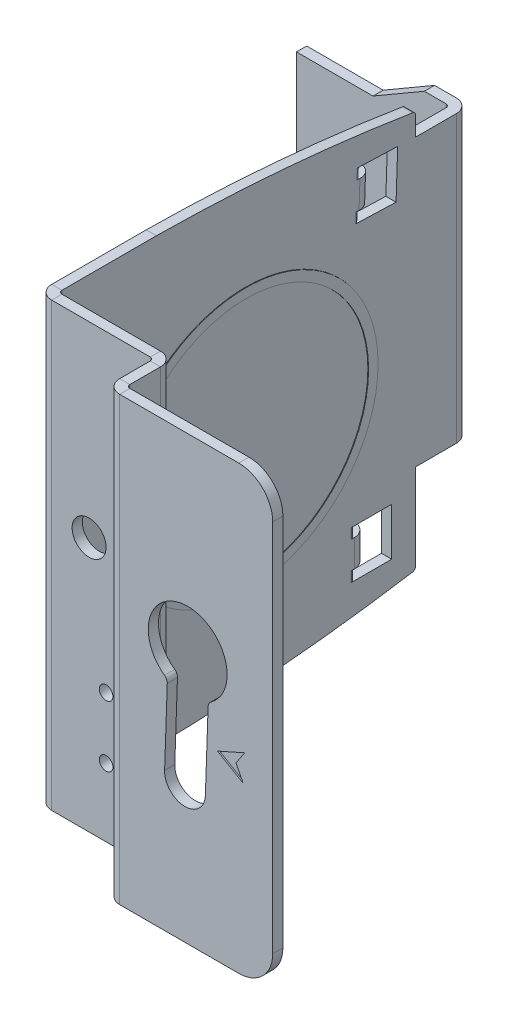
ISO-10303-21;
HEADER;
FILE_DESCRIPTION(('STEP AP214'),'2;1');
FILE_NAME('part.step','',(''),(''),'','','');
FILE_SCHEMA(('AUTOMOTIVE_DESIGN { 1 0 10303 214 1 1 1 1 }'));
ENDSEC;
DATA;
#1=APPLICATION_CONTEXT('core data for automotive mechanical design processes');
#2=APPLICATION_PROTOCOL_DEFINITION('international standard','automotive_design',2000,#1);
#3=PRODUCT_CONTEXT('',#1,'mechanical');
#4=PRODUCT('Part','Part','',(#3));
#5=PRODUCT_RELATED_PRODUCT_CATEGORY('part','',(#4));
#6=PRODUCT_DEFINITION_FORMATION('','',#4);
#7=PRODUCT_DEFINITION_CONTEXT('part definition',#1,'design');
#8=PRODUCT_DEFINITION('design','',#6,#7);
#9=PRODUCT_DEFINITION_SHAPE('','',#8);
#10=(LENGTH_UNIT() NAMED_UNIT(*) SI_UNIT(.MILLI.,.METRE.));
#11=(NAMED_UNIT(*) PLANE_ANGLE_UNIT() SI_UNIT($,.RADIAN.));
#12=(NAMED_UNIT(*) SI_UNIT($,.STERADIAN.) SOLID_ANGLE_UNIT());
#13=UNCERTAINTY_MEASURE_WITH_UNIT(LENGTH_MEASURE(1.E-05),#10,'distance_accuracy_value','');
#14=(GEOMETRIC_REPRESENTATION_CONTEXT(3) GLOBAL_UNCERTAINTY_ASSIGNED_CONTEXT((#13)) GLOBAL_UNIT_ASSIGNED_CONTEXT((#10,
#11,#12)) REPRESENTATION_CONTEXT('',''));
#15=CARTESIAN_POINT('',(0.,0.,0.));
#16=DIRECTION('',(0.,0.,1.));
#17=DIRECTION('',(1.,0.,0.));
#18=AXIS2_PLACEMENT_3D('',#15,#16,#17);
#19=CARTESIAN_POINT('',(-15.5,65.,-8.5));
#20=DIRECTION('',(-1.,0.,0.));
#21=DIRECTION('',(0.,0.,1.));
#22=AXIS2_PLACEMENT_3D('',#19,#20,#21);
#23=PLANE('',#22);
#24=CARTESIAN_POINT('',(-15.5000000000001,32.5,-35.9999999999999));
#25=DIRECTION('',(-1.,0.,0.));
#26=DIRECTION('',(0.,0.,1.));
#27=AXIS2_PLACEMENT_3D('',#24,#25,#26);
#28=CIRCLE('',#27,19.4);
#29=CARTESIAN_POINT('',(-15.5,32.5,-16.5999999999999));
#30=VERTEX_POINT('',#29);
#31=EDGE_CURVE('E1056',#30,#30,#28,.F.);
#32=ORIENTED_EDGE('',*,*,#31,.F.);
#33=EDGE_LOOP('',(#32));
#34=FACE_BOUND('',#33,.T.);
#35=DIRECTION('',(0.,0.999429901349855,-0.0337619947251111));
#36=VECTOR('',#35,1.);
#37=CARTESIAN_POINT('',(-15.5000000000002,63.5122215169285,-52.5415418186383));
#38=LINE('',#37,#36);
#39=CARTESIAN_POINT('',(-15.5000000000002,57.3464785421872,-52.3332552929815));
#40=VERTEX_POINT('',#39);
#41=CARTESIAN_POINT('',(-15.5000000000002,58.8456233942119,-52.3838982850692));
#42=VERTEX_POINT('',#41);
#43=EDGE_CURVE('E923',#40,#42,#38,.T.);
#44=ORIENTED_EDGE('',*,*,#43,.T.);
#45=DIRECTION('',(0.,-0.0337619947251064,-0.999429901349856));
#46=VECTOR('',#45,1.);
#47=CARTESIAN_POINT('',(-15.5,60.3334018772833,-8.34235646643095));
#48=LINE('',#47,#46);
#49=CARTESIAN_POINT('',(-15.5000000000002,58.6430514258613,-58.3804776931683));
#50=VERTEX_POINT('',#49);
#51=EDGE_CURVE('E835',#42,#50,#48,.T.);
#52=ORIENTED_EDGE('',*,*,#51,.T.);
#53=DIRECTION('',(0.,-0.999429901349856,0.033761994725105));
#54=VECTOR('',#53,1.);
#55=CARTESIAN_POINT('',(-15.5000000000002,63.3096495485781,-58.5381212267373));
#56=LINE('',#55,#54);
#57=CARTESIAN_POINT('',(-15.5000000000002,51.6470421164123,-58.1441437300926));
#58=VERTEX_POINT('',#57);
#59=EDGE_CURVE('E838',#50,#58,#56,.T.);
#60=ORIENTED_EDGE('',*,*,#59,.T.);
#61=DIRECTION('',(0.,0.0337619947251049,0.999429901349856));
#62=VECTOR('',#61,1.);
#63=CARTESIAN_POINT('',(-15.5,53.3373925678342,-8.10602250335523));
#64=LINE('',#63,#62);
#65=CARTESIAN_POINT('',(-15.5000000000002,51.8496140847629,-52.1475643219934));
#66=VERTEX_POINT('',#65);
#67=EDGE_CURVE('E833',#58,#66,#64,.T.);
#68=ORIENTED_EDGE('',*,*,#67,.T.);
#69=DIRECTION('',(0.,0.999429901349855,-0.0337619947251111));
#70=VECTOR('',#69,1.);
#71=CARTESIAN_POINT('',(-15.5000000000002,63.5122215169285,-52.5415418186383));
#72=LINE('',#71,#70);
#73=CARTESIAN_POINT('',(-15.5000000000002,53.3487589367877,-52.1982073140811));
#74=VERTEX_POINT('',#73);
#75=EDGE_CURVE('E849',#66,#74,#72,.T.);
#76=ORIENTED_EDGE('',*,*,#75,.T.);
#77=DIRECTION('',(0.,0.0337619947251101,0.999429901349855));
#78=VECTOR('',#77,1.);
#79=CARTESIAN_POINT('',(-15.5000000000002,53.3318779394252,-52.697922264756));
#80=LINE('',#79,#78);
#81=CARTESIAN_POINT('',(-15.5000000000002,53.3318779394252,-52.697922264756));
#82=VERTEX_POINT('',#81);
#83=EDGE_CURVE('E916',#74,#82,#80,.F.);
#84=ORIENTED_EDGE('',*,*,#83,.T.);
#85=DIRECTION('',(0.,-0.999429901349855,0.0337619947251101));
#86=VECTOR('',#85,1.);
#87=CARTESIAN_POINT('',(-15.5000000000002,53.3318779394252,-52.697922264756));
#88=LINE('',#87,#86);
#89=CARTESIAN_POINT('',(-15.5000000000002,57.3295975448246,-52.8329702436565));
#90=VERTEX_POINT('',#89);
#91=EDGE_CURVE('E853',#82,#90,#88,.F.);
#92=ORIENTED_EDGE('',*,*,#91,.T.);
#93=DIRECTION('',(0.,0.0337619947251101,0.999429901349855));
#94=VECTOR('',#93,1.);
#95=CARTESIAN_POINT('',(-15.5000000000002,57.3295975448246,-52.8329702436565));
#96=LINE('',#95,#94);
#97=EDGE_CURVE('E918',#90,#40,#96,.T.);
#98=ORIENTED_EDGE('',*,*,#97,.T.);
#99=EDGE_LOOP('',(#44,#52,#60,#68,#76,#84,#92,#98));
#100=FACE_BOUND('',#99,.T.);
#101=DIRECTION('',(0.,1.,0.));
#102=VECTOR('',#101,1.);
#103=CARTESIAN_POINT('',(-15.5000000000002,65.,-51.5000000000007));
#104=LINE('',#103,#102);
#105=CARTESIAN_POINT('',(-15.5000000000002,11.9999999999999,-51.5000000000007));
#106=VERTEX_POINT('',#105);
#107=CARTESIAN_POINT('',(-15.5000000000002,13.4999999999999,-51.5000000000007));
#108=VERTEX_POINT('',#107);
#109=EDGE_CURVE('E938',#106,#108,#104,.T.);
#110=ORIENTED_EDGE('',*,*,#109,.T.);
#111=DIRECTION('',(0.,0.,-1.));
#112=VECTOR('',#111,1.);
#113=CARTESIAN_POINT('',(-15.5,13.4999999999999,-8.5));
#114=LINE('',#113,#112);
#115=CARTESIAN_POINT('',(-15.5000000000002,13.4999999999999,-57.5000000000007));
#116=VERTEX_POINT('',#115);
#117=EDGE_CURVE('E843',#108,#116,#114,.T.);
#118=ORIENTED_EDGE('',*,*,#117,.T.);
#119=DIRECTION('',(0.,-1.,0.));
#120=VECTOR('',#119,1.);
#121=CARTESIAN_POINT('',(-15.5000000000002,65.,-57.5000000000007));
#122=LINE('',#121,#120);
#123=CARTESIAN_POINT('',(-15.5000000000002,6.49999999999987,-57.5000000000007));
#124=VERTEX_POINT('',#123);
#125=EDGE_CURVE('E846',#116,#124,#122,.T.);
#126=ORIENTED_EDGE('',*,*,#125,.T.);
#127=DIRECTION('',(0.,0.,1.));
#128=VECTOR('',#127,1.);
#129=CARTESIAN_POINT('',(-15.5,6.49999999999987,-8.5));
#130=LINE('',#129,#128);
#131=CARTESIAN_POINT('',(-15.5000000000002,6.49999999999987,-51.5000000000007));
#132=VERTEX_POINT('',#131);
#133=EDGE_CURVE('E841',#124,#132,#130,.T.);
#134=ORIENTED_EDGE('',*,*,#133,.T.);
#135=DIRECTION('',(0.,1.,0.));
#136=VECTOR('',#135,1.);
#137=CARTESIAN_POINT('',(-15.5000000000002,65.,-51.5000000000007));
#138=LINE('',#137,#136);
#139=CARTESIAN_POINT('',(-15.5000000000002,7.99999999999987,-51.5000000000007));
#140=VERTEX_POINT('',#139);
#141=EDGE_CURVE('E928',#132,#140,#138,.T.);
#142=ORIENTED_EDGE('',*,*,#141,.T.);
#143=DIRECTION('',(0.,0.,1.));
#144=VECTOR('',#143,1.);
#145=CARTESIAN_POINT('',(-15.5000000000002,7.99999999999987,-52.0000000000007));
#146=LINE('',#145,#144);
#147=CARTESIAN_POINT('',(-15.5000000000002,7.99999999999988,-52.0000000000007));
#148=VERTEX_POINT('',#147);
#149=EDGE_CURVE('E931',#140,#148,#146,.F.);
#150=ORIENTED_EDGE('',*,*,#149,.T.);
#151=DIRECTION('',(0.,-1.,0.));
#152=VECTOR('',#151,1.);
#153=CARTESIAN_POINT('',(-15.5000000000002,7.99999999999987,-52.0000000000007));
#154=LINE('',#153,#152);
#155=CARTESIAN_POINT('',(-15.5000000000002,11.9999999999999,-52.0000000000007));
#156=VERTEX_POINT('',#155);
#157=EDGE_CURVE('E885',#148,#156,#154,.F.);
#158=ORIENTED_EDGE('',*,*,#157,.T.);
#159=DIRECTION('',(0.,0.,1.));
#160=VECTOR('',#159,1.);
#161=CARTESIAN_POINT('',(-15.5000000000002,11.9999999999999,-52.0000000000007));
#162=LINE('',#161,#160);
#163=EDGE_CURVE('E933',#156,#106,#162,.T.);
#164=ORIENTED_EDGE('',*,*,#163,.T.);
#165=EDGE_LOOP('',(#110,#118,#126,#134,#142,#150,#158,#164));
#166=FACE_BOUND('',#165,.T.);
#167=CARTESIAN_POINT('',(-15.5000000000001,253.745137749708,-19.5708495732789));
#168=DIRECTION('',(-1.,0.,0.));
#169=DIRECTION('',(0.,0.,1.));
#170=AXIS2_PLACEMENT_3D('',#167,#168,#169);
#171=CIRCLE('',#170,253.75);
#172=CARTESIAN_POINT('',(-15.5,0.,-21.1416991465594));
#173=VERTEX_POINT('',#172);
#174=CARTESIAN_POINT('',(-15.5000000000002,3.33098913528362,-60.5808077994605));
#175=VERTEX_POINT('',#174);
#176=EDGE_CURVE('E643',#173,#175,#171,.F.);
#177=ORIENTED_EDGE('',*,*,#176,.T.);
#178=CARTESIAN_POINT('',(-15.5000000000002,3.82441602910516,-60.5));
#179=DIRECTION('',(-1.,0.,0.));
#180=DIRECTION('',(0.,0.,1.));
#181=AXIS2_PLACEMENT_3D('',#178,#179,#180);
#182=CIRCLE('',#181,0.5);
#183=CARTESIAN_POINT('',(-15.5000000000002,3.82441602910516,-61.));
#184=VERTEX_POINT('',#183);
#185=EDGE_CURVE('E15',#175,#184,#182,.F.);
#186=ORIENTED_EDGE('',*,*,#185,.T.);
#187=DIRECTION('',(0.,1.,0.));
#188=VECTOR('',#187,1.);
#189=CARTESIAN_POINT('',(-15.5000000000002,65.,-61.));
#190=LINE('',#189,#188);
#191=CARTESIAN_POINT('',(-15.5000000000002,16.5,-61.));
#192=VERTEX_POINT('',#191);
#193=EDGE_CURVE('E812',#184,#192,#190,.T.);
#194=ORIENTED_EDGE('',*,*,#193,.T.);
#195=DIRECTION('',(0.,0.,-1.));
#196=VECTOR('',#195,1.);
#197=CARTESIAN_POINT('',(-15.5,16.5,-8.5));
#198=LINE('',#197,#196);
#199=CARTESIAN_POINT('',(-15.5000000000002,16.5,-67.));
#200=VERTEX_POINT('',#199);
#201=EDGE_CURVE('E809',#192,#200,#198,.T.);
#202=ORIENTED_EDGE('',*,*,#201,.T.);
#203=DIRECTION('',(0.,-1.,0.));
#204=VECTOR('',#203,1.);
#205=CARTESIAN_POINT('',(-15.5000000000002,0.,-67.));
#206=LINE('',#205,#204);
#207=CARTESIAN_POINT('',(-15.5000000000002,58.5,-67.));
#208=VERTEX_POINT('',#207);
#209=EDGE_CURVE('E678',#200,#208,#206,.F.);
#210=ORIENTED_EDGE('',*,*,#209,.T.);
#211=DIRECTION('',(0.,0.,1.));
#212=VECTOR('',#211,1.);
#213=CARTESIAN_POINT('',(-15.5,58.5,-8.5));
#214=LINE('',#213,#212);
#215=CARTESIAN_POINT('',(-15.5000000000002,58.5,-61.));
#216=VERTEX_POINT('',#215);
#217=EDGE_CURVE('E798',#208,#216,#214,.T.);
#218=ORIENTED_EDGE('',*,*,#217,.T.);
#219=DIRECTION('',(0.,1.,0.));
#220=VECTOR('',#219,1.);
#221=CARTESIAN_POINT('',(-15.5000000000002,65.,-61.));
#222=LINE('',#221,#220);
#223=CARTESIAN_POINT('',(-15.5000000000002,61.3240790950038,-61.));
#224=VERTEX_POINT('',#223);
#225=EDGE_CURVE('E1155',#216,#224,#222,.T.);
#226=ORIENTED_EDGE('',*,*,#225,.T.);
#227=CARTESIAN_POINT('',(-15.5000000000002,61.3240790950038,-60.5));
#228=DIRECTION('',(-1.,0.,0.));
#229=DIRECTION('',(0.,0.,1.));
#230=AXIS2_PLACEMENT_3D('',#227,#228,#229);
#231=CIRCLE('',#230,0.5);
#232=CARTESIAN_POINT('',(-15.5000000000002,61.8177855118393,-60.5790820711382));
#233=VERTEX_POINT('',#232);
#234=EDGE_CURVE('E1066',#224,#233,#231,.F.);
#235=ORIENTED_EDGE('',*,*,#234,.T.);
#236=CARTESIAN_POINT('',(-15.5000000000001,-188.738221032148,-20.4449309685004));
#237=DIRECTION('',(-1.,0.,0.));
#238=DIRECTION('',(0.,0.,1.));
#239=AXIS2_PLACEMENT_3D('',#236,#237,#238);
#240=CIRCLE('',#239,253.75);
#241=CARTESIAN_POINT('',(-15.5,65.,-22.8898619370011));
#242=VERTEX_POINT('',#241);
#243=EDGE_CURVE('E1221',#242,#233,#240,.T.);
#244=ORIENTED_EDGE('',*,*,#243,.F.);
#245=DIRECTION('',(0.,0.,-1.));
#246=VECTOR('',#245,1.);
#247=CARTESIAN_POINT('',(-15.5,65.,-8.5));
#248=LINE('',#247,#246);
#249=CARTESIAN_POINT('',(-15.5,65.,-9.));
#250=VERTEX_POINT('',#249);
#251=EDGE_CURVE('E660',#242,#250,#248,.F.);
#252=ORIENTED_EDGE('',*,*,#251,.T.);
#253=DIRECTION('',(0.,-1.,0.));
#254=VECTOR('',#253,1.);
#255=CARTESIAN_POINT('',(-15.5,0.,-9.));
#256=LINE('',#255,#254);
#257=CARTESIAN_POINT('',(-15.5,0.,-9.));
#258=VERTEX_POINT('',#257);
#259=EDGE_CURVE('E674',#258,#250,#256,.F.);
#260=ORIENTED_EDGE('',*,*,#259,.F.);
#261=DIRECTION('',(0.,0.,1.));
#262=VECTOR('',#261,1.);
#263=CARTESIAN_POINT('',(-15.5,0.,-8.5));
#264=LINE('',#263,#262);
#265=EDGE_CURVE('E664',#258,#173,#264,.F.);
#266=ORIENTED_EDGE('',*,*,#265,.T.);
#267=EDGE_LOOP('',(#177,#186,#194,#202,#210,#218,#226,#235,#244,#252,#260,#266));
#268=FACE_BOUND('',#267,.T.);
#269=ADVANCED_FACE('F170',(#34,#100,#166,#268),#23,.F.);
#270=CARTESIAN_POINT('',(-17.,65.,-8.49999999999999));
#271=DIRECTION('',(-1.,0.,0.));
#272=DIRECTION('',(0.,0.,1.));
#273=AXIS2_PLACEMENT_3D('',#270,#271,#272);
#274=PLANE('',#273);
#275=DIRECTION('',(0.,1.,0.));
#276=VECTOR('',#275,1.);
#277=CARTESIAN_POINT('',(-17.0000000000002,-50.8439711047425,-61.));
#278=LINE('',#277,#276);
#279=CARTESIAN_POINT('',(-17.0000000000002,3.82441602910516,-61.));
#280=VERTEX_POINT('',#279);
#281=CARTESIAN_POINT('',(-17.0000000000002,16.5,-61.));
#282=VERTEX_POINT('',#281);
#283=EDGE_CURVE('E1076',#280,#282,#278,.T.);
#284=ORIENTED_EDGE('',*,*,#283,.F.);
#285=CARTESIAN_POINT('',(-17.0000000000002,3.82441602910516,-60.5));
#286=DIRECTION('',(-1.,0.,0.));
#287=DIRECTION('',(0.,0.,1.));
#288=AXIS2_PLACEMENT_3D('',#285,#286,#287);
#289=CIRCLE('',#288,0.5);
#290=CARTESIAN_POINT('',(-17.0000000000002,3.33098913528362,-60.5808077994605));
#291=VERTEX_POINT('',#290);
#292=EDGE_CURVE('E192',#280,#291,#289,.T.);
#293=ORIENTED_EDGE('',*,*,#292,.T.);
#294=CARTESIAN_POINT('',(-17.0000000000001,253.745137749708,-19.5708495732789));
#295=DIRECTION('',(-1.,0.,0.));
#296=DIRECTION('',(0.,0.,1.));
#297=AXIS2_PLACEMENT_3D('',#294,#295,#296);
#298=CIRCLE('',#297,253.75);
#299=CARTESIAN_POINT('',(-17.0000000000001,0.,-21.1416991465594));
#300=VERTEX_POINT('',#299);
#301=EDGE_CURVE('E642',#300,#291,#298,.F.);
#302=ORIENTED_EDGE('',*,*,#301,.F.);
#303=DIRECTION('',(0.,0.,-1.));
#304=VECTOR('',#303,1.);
#305=CARTESIAN_POINT('',(-17.0000000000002,0.,-69.));
#306=LINE('',#305,#304);
#307=CARTESIAN_POINT('',(-17.,0.,-8.99999999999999));
#308=VERTEX_POINT('',#307);
#309=EDGE_CURVE('E653',#308,#300,#306,.T.);
#310=ORIENTED_EDGE('',*,*,#309,.F.);
#311=DIRECTION('',(0.,1.,0.));
#312=VECTOR('',#311,1.);
#313=CARTESIAN_POINT('',(-17.,65.,-8.99999999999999));
#314=LINE('',#313,#312);
#315=CARTESIAN_POINT('',(-17.,65.,-8.99999999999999));
#316=VERTEX_POINT('',#315);
#317=EDGE_CURVE('E669',#308,#316,#314,.T.);
#318=ORIENTED_EDGE('',*,*,#317,.T.);
#319=DIRECTION('',(0.,0.,1.));
#320=VECTOR('',#319,1.);
#321=CARTESIAN_POINT('',(-17.,65.,-8.49999999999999));
#322=LINE('',#321,#320);
#323=CARTESIAN_POINT('',(-17.0000000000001,65.,-22.8898619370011));
#324=VERTEX_POINT('',#323);
#325=EDGE_CURVE('E659',#324,#316,#322,.T.);
#326=ORIENTED_EDGE('',*,*,#325,.F.);
#327=CARTESIAN_POINT('',(-17.0000000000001,-188.738221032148,-20.4449309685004));
#328=DIRECTION('',(-1.,0.,0.));
#329=DIRECTION('',(0.,0.,1.));
#330=AXIS2_PLACEMENT_3D('',#327,#328,#329);
#331=CIRCLE('',#330,253.75);
#332=CARTESIAN_POINT('',(-17.0000000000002,61.8177855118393,-60.5790820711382));
#333=VERTEX_POINT('',#332);
#334=EDGE_CURVE('E1219',#324,#333,#331,.T.);
#335=ORIENTED_EDGE('',*,*,#334,.T.);
#336=CARTESIAN_POINT('',(-17.0000000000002,61.3240790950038,-60.5));
#337=DIRECTION('',(-1.,0.,0.));
#338=DIRECTION('',(0.,0.,1.));
#339=AXIS2_PLACEMENT_3D('',#336,#337,#338);
#340=CIRCLE('',#339,0.5);
#341=CARTESIAN_POINT('',(-17.0000000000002,61.3240790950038,-61.));
#342=VERTEX_POINT('',#341);
#343=EDGE_CURVE('E1062',#333,#342,#340,.T.);
#344=ORIENTED_EDGE('',*,*,#343,.T.);
#345=DIRECTION('',(0.,1.,0.));
#346=VECTOR('',#345,1.);
#347=CARTESIAN_POINT('',(-17.0000000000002,65.,-61.));
#348=LINE('',#347,#346);
#349=CARTESIAN_POINT('',(-17.0000000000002,58.5,-61.));
#350=VERTEX_POINT('',#349);
#351=EDGE_CURVE('E1150',#350,#342,#348,.T.);
#352=ORIENTED_EDGE('',*,*,#351,.F.);
#353=DIRECTION('',(0.,0.,1.));
#354=VECTOR('',#353,1.);
#355=CARTESIAN_POINT('',(-17.0000000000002,58.5,-61.));
#356=LINE('',#355,#354);
#357=CARTESIAN_POINT('',(-17.0000000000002,58.5,-67.));
#358=VERTEX_POINT('',#357);
#359=EDGE_CURVE('E1147',#358,#350,#356,.T.);
#360=ORIENTED_EDGE('',*,*,#359,.F.);
#361=DIRECTION('',(0.,-1.,0.));
#362=VECTOR('',#361,1.);
#363=CARTESIAN_POINT('',(-17.0000000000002,0.,-67.));
#364=LINE('',#363,#362);
#365=CARTESIAN_POINT('',(-17.0000000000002,16.5,-67.));
#366=VERTEX_POINT('',#365);
#367=EDGE_CURVE('E1173',#366,#358,#364,.F.);
#368=ORIENTED_EDGE('',*,*,#367,.F.);
#369=DIRECTION('',(0.,0.,-1.));
#370=VECTOR('',#369,1.);
#371=CARTESIAN_POINT('',(-17.0000000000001,16.5,-43.0706686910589));
#372=LINE('',#371,#370);
#373=EDGE_CURVE('E1083',#282,#366,#372,.T.);
#374=ORIENTED_EDGE('',*,*,#373,.F.);
#375=EDGE_LOOP('',(#284,#293,#302,#310,#318,#326,#335,#344,#352,#360,#368,#374));
#376=FACE_BOUND('',#375,.T.);
#377=DIRECTION('',(0.,-0.0337619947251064,-0.999429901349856));
#378=VECTOR('',#377,1.);
#379=CARTESIAN_POINT('',(-17.0000000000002,58.6430514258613,-58.3804776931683));
#380=LINE('',#379,#378);
#381=CARTESIAN_POINT('',(-17.0000000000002,58.8456233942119,-52.3838982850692));
#382=VERTEX_POINT('',#381);
#383=CARTESIAN_POINT('',(-17.0000000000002,58.6430514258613,-58.3804776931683));
#384=VERTEX_POINT('',#383);
#385=EDGE_CURVE('E2578',#382,#384,#380,.T.);
#386=ORIENTED_EDGE('',*,*,#385,.F.);
#387=DIRECTION('',(0.,0.999429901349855,-0.0337619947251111));
#388=VECTOR('',#387,1.);
#389=CARTESIAN_POINT('',(-17.0000000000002,57.3464785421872,-52.3332552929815));
#390=LINE('',#389,#388);
#391=CARTESIAN_POINT('',(-17.0000000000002,57.3464785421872,-52.3332552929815));
#392=VERTEX_POINT('',#391);
#393=EDGE_CURVE('E1015',#382,#392,#390,.F.);
#394=ORIENTED_EDGE('',*,*,#393,.T.);
#395=DIRECTION('',(0.,-0.0337619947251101,-0.999429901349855));
#396=VECTOR('',#395,1.);
#397=CARTESIAN_POINT('',(-17.,58.8342570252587,-8.29171347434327));
#398=LINE('',#397,#396);
#399=CARTESIAN_POINT('',(-17.0000000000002,57.3295975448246,-52.8329702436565));
#400=VERTEX_POINT('',#399);
#401=EDGE_CURVE('E1011',#392,#400,#398,.T.);
#402=ORIENTED_EDGE('',*,*,#401,.T.);
#403=DIRECTION('',(0.,-0.999429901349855,0.0337619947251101));
#404=VECTOR('',#403,1.);
#405=CARTESIAN_POINT('',(-17.0000000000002,53.3318779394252,-52.697922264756));
#406=LINE('',#405,#404);
#407=CARTESIAN_POINT('',(-17.0000000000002,53.3318779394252,-52.697922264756));
#408=VERTEX_POINT('',#407);
#409=EDGE_CURVE('E865',#408,#400,#406,.F.);
#410=ORIENTED_EDGE('',*,*,#409,.F.);
#411=DIRECTION('',(0.,-0.0337619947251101,-0.999429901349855));
#412=VECTOR('',#411,1.);
#413=CARTESIAN_POINT('',(-17.,54.8365374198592,-8.15666549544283));
#414=LINE('',#413,#412);
#415=CARTESIAN_POINT('',(-17.0000000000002,53.3487589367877,-52.1982073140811));
#416=VERTEX_POINT('',#415);
#417=EDGE_CURVE('E1008',#408,#416,#414,.F.);
#418=ORIENTED_EDGE('',*,*,#417,.T.);
#419=DIRECTION('',(0.,0.999429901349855,-0.0337619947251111));
#420=VECTOR('',#419,1.);
#421=CARTESIAN_POINT('',(-17.0000000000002,51.8496140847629,-52.1475643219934));
#422=LINE('',#421,#420);
#423=CARTESIAN_POINT('',(-17.0000000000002,51.8496140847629,-52.1475643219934));
#424=VERTEX_POINT('',#423);
#425=EDGE_CURVE('E1005',#416,#424,#422,.F.);
#426=ORIENTED_EDGE('',*,*,#425,.T.);
#427=DIRECTION('',(0.,0.0337619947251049,0.999429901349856));
#428=VECTOR('',#427,1.);
#429=CARTESIAN_POINT('',(-17.0000000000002,51.8327330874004,-52.6472792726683));
#430=LINE('',#429,#428);
#431=CARTESIAN_POINT('',(-17.0000000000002,51.6470421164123,-58.1441437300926));
#432=VERTEX_POINT('',#431);
#433=EDGE_CURVE('E2698',#432,#424,#430,.T.);
#434=ORIENTED_EDGE('',*,*,#433,.F.);
#435=DIRECTION('',(0.,-0.999429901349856,0.033761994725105));
#436=VECTOR('',#435,1.);
#437=CARTESIAN_POINT('',(-17.0000000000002,51.6470421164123,-58.1441437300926));
#438=LINE('',#437,#436);
#439=EDGE_CURVE('E2699',#384,#432,#438,.T.);
#440=ORIENTED_EDGE('',*,*,#439,.F.);
#441=EDGE_LOOP('',(#386,#394,#402,#410,#418,#426,#434,#440));
#442=FACE_BOUND('',#441,.T.);
#443=DIRECTION('',(0.,0.,-1.));
#444=VECTOR('',#443,1.);
#445=CARTESIAN_POINT('',(-17.0000000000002,13.4999999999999,-57.5000000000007));
#446=LINE('',#445,#444);
#447=CARTESIAN_POINT('',(-17.0000000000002,13.4999999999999,-51.5000000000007));
#448=VERTEX_POINT('',#447);
#449=CARTESIAN_POINT('',(-17.0000000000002,13.4999999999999,-57.5000000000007));
#450=VERTEX_POINT('',#449);
#451=EDGE_CURVE('E1314',#448,#450,#446,.T.);
#452=ORIENTED_EDGE('',*,*,#451,.F.);
#453=DIRECTION('',(0.,1.,0.));
#454=VECTOR('',#453,1.);
#455=CARTESIAN_POINT('',(-17.0000000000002,11.9999999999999,-51.5000000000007));
#456=LINE('',#455,#454);
#457=CARTESIAN_POINT('',(-17.0000000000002,11.9999999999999,-51.5000000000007));
#458=VERTEX_POINT('',#457);
#459=EDGE_CURVE('E1000',#448,#458,#456,.F.);
#460=ORIENTED_EDGE('',*,*,#459,.T.);
#461=DIRECTION('',(0.,0.,-1.));
#462=VECTOR('',#461,1.);
#463=CARTESIAN_POINT('',(-17.,11.9999999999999,-8.49999999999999));
#464=LINE('',#463,#462);
#465=CARTESIAN_POINT('',(-17.0000000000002,11.9999999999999,-52.0000000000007));
#466=VERTEX_POINT('',#465);
#467=EDGE_CURVE('E996',#458,#466,#464,.T.);
#468=ORIENTED_EDGE('',*,*,#467,.T.);
#469=DIRECTION('',(0.,-1.,0.));
#470=VECTOR('',#469,1.);
#471=CARTESIAN_POINT('',(-17.0000000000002,7.99999999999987,-52.0000000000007));
#472=LINE('',#471,#470);
#473=CARTESIAN_POINT('',(-17.0000000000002,7.99999999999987,-52.0000000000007));
#474=VERTEX_POINT('',#473);
#475=EDGE_CURVE('E897',#474,#466,#472,.F.);
#476=ORIENTED_EDGE('',*,*,#475,.F.);
#477=DIRECTION('',(0.,0.,-1.));
#478=VECTOR('',#477,1.);
#479=CARTESIAN_POINT('',(-17.,7.99999999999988,-8.49999999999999));
#480=LINE('',#479,#478);
#481=CARTESIAN_POINT('',(-17.0000000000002,7.99999999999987,-51.5000000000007));
#482=VERTEX_POINT('',#481);
#483=EDGE_CURVE('E993',#474,#482,#480,.F.);
#484=ORIENTED_EDGE('',*,*,#483,.T.);
#485=DIRECTION('',(0.,1.,0.));
#486=VECTOR('',#485,1.);
#487=CARTESIAN_POINT('',(-17.0000000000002,6.49999999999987,-51.5000000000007));
#488=LINE('',#487,#486);
#489=CARTESIAN_POINT('',(-17.0000000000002,6.49999999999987,-51.5000000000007));
#490=VERTEX_POINT('',#489);
#491=EDGE_CURVE('E990',#482,#490,#488,.F.);
#492=ORIENTED_EDGE('',*,*,#491,.T.);
#493=DIRECTION('',(0.,0.,1.));
#494=VECTOR('',#493,1.);
#495=CARTESIAN_POINT('',(-17.0000000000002,6.49999999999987,-52.0000000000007));
#496=LINE('',#495,#494);
#497=CARTESIAN_POINT('',(-17.0000000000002,6.49999999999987,-57.5000000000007));
#498=VERTEX_POINT('',#497);
#499=EDGE_CURVE('E2712',#498,#490,#496,.T.);
#500=ORIENTED_EDGE('',*,*,#499,.F.);
#501=DIRECTION('',(0.,-1.,0.));
#502=VECTOR('',#501,1.);
#503=CARTESIAN_POINT('',(-17.0000000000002,6.49999999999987,-57.5000000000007));
#504=LINE('',#503,#502);
#505=EDGE_CURVE('E972',#450,#498,#504,.T.);
#506=ORIENTED_EDGE('',*,*,#505,.F.);
#507=EDGE_LOOP('',(#452,#460,#468,#476,#484,#492,#500,#506));
#508=FACE_BOUND('',#507,.T.);
#509=CARTESIAN_POINT('',(-17.0000000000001,32.5,-35.9999999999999));
#510=DIRECTION('',(-1.,0.,0.));
#511=DIRECTION('',(0.,0.,1.));
#512=AXIS2_PLACEMENT_3D('',#509,#510,#511);
#513=CIRCLE('',#512,19.4);
#514=CARTESIAN_POINT('',(-17.,32.5,-16.5999999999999));
#515=VERTEX_POINT('',#514);
#516=EDGE_CURVE('E1242',#515,#515,#513,.T.);
#517=ORIENTED_EDGE('',*,*,#516,.F.);
#518=EDGE_LOOP('',(#517));
#519=FACE_BOUND('',#518,.T.);
#520=ADVANCED_FACE('F650',(#376,#442,#508,#519),#274,.T.);
#521=CARTESIAN_POINT('',(-17.,65.,-8.49999999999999));
#522=DIRECTION('',(0.,1.,0.));
#523=DIRECTION('',(0.,0.,1.));
#524=AXIS2_PLACEMENT_3D('',#521,#522,#523);
#525=PLANE('',#524);
#526=ORIENTED_EDGE('',*,*,#251,.F.);
#527=DIRECTION('',(-1.,0.,0.));
#528=VECTOR('',#527,1.);
#529=CARTESIAN_POINT('',(-7.00000000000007,65.,-22.8898619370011));
#530=LINE('',#529,#528);
#531=EDGE_CURVE('E1223',#242,#324,#530,.T.);
#532=ORIENTED_EDGE('',*,*,#531,.T.);
#533=ORIENTED_EDGE('',*,*,#325,.T.);
#534=DIRECTION('',(-1.,0.,0.));
#535=VECTOR('',#534,1.);
#536=CARTESIAN_POINT('',(-15.5,65.,-9.));
#537=LINE('',#536,#535);
#538=EDGE_CURVE('E671',#250,#316,#537,.T.);
#539=ORIENTED_EDGE('',*,*,#538,.F.);
#540=EDGE_LOOP('',(#526,#532,#533,#539));
#541=FACE_BOUND('',#540,.T.);
#542=ADVANCED_FACE('F1350',(#541),#525,.T.);
#543=CARTESIAN_POINT('',(32.9999999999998,65.,-61.0000000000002));
#544=DIRECTION('',(0.,0.,1.));
#545=DIRECTION('',(1.,0.,0.));
#546=AXIS2_PLACEMENT_3D('',#543,#544,#545);
#547=PLANE('',#546);
#548=ORIENTED_EDGE('',*,*,#351,.T.);
#549=DIRECTION('',(1.,0.,0.));
#550=VECTOR('',#549,1.);
#551=CARTESIAN_POINT('',(-15.5000000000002,61.3240790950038,-61.));
#552=LINE('',#551,#550);
#553=EDGE_CURVE('E1064',#342,#224,#552,.T.);
#554=ORIENTED_EDGE('',*,*,#553,.T.);
#555=ORIENTED_EDGE('',*,*,#225,.F.);
#556=DIRECTION('',(-1.,0.,0.));
#557=VECTOR('',#556,1.);
#558=CARTESIAN_POINT('',(32.9999999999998,58.5,-61.0000000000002));
#559=LINE('',#558,#557);
#560=EDGE_CURVE('E1153',#216,#350,#559,.T.);
#561=ORIENTED_EDGE('',*,*,#560,.T.);
#562=EDGE_LOOP('',(#548,#554,#555,#561));
#563=FACE_BOUND('',#562,.T.);
#564=ADVANCED_FACE('F1524',(#563),#547,.F.);
#565=CARTESIAN_POINT('',(-7.00000000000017,7.99999999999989,-52.0000000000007));
#566=DIRECTION('',(0.,0.,1.));
#567=DIRECTION('',(1.,0.,0.));
#568=AXIS2_PLACEMENT_3D('',#565,#566,#567);
#569=PLANE('',#568);
#570=DIRECTION('',(-1.,0.,0.));
#571=VECTOR('',#570,1.);
#572=CARTESIAN_POINT('',(-7.00000000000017,13.4999999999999,-52.0000000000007));
#573=LINE('',#572,#571);
#574=CARTESIAN_POINT('',(-16.0000000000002,13.4999999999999,-52.0000000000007));
#575=VERTEX_POINT('',#574);
#576=CARTESIAN_POINT('',(-16.5000000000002,13.4999999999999,-52.0000000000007));
#577=VERTEX_POINT('',#576);
#578=EDGE_CURVE('E1324',#575,#577,#573,.T.);
#579=ORIENTED_EDGE('',*,*,#578,.F.);
#580=DIRECTION('',(0.,1.,0.));
#581=VECTOR('',#580,1.);
#582=CARTESIAN_POINT('',(-16.0000000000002,7.99999999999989,-52.0000000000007));
#583=LINE('',#582,#581);
#584=CARTESIAN_POINT('',(-16.0000000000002,11.9999999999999,-52.0000000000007));
#585=VERTEX_POINT('',#584);
#586=EDGE_CURVE('E961',#575,#585,#583,.F.);
#587=ORIENTED_EDGE('',*,*,#586,.T.);
#588=DIRECTION('',(1.,0.,0.));
#589=VECTOR('',#588,1.);
#590=CARTESIAN_POINT('',(-17.0000000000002,11.9999999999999,-52.0000000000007));
#591=LINE('',#590,#589);
#592=CARTESIAN_POINT('',(-16.5000000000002,11.9999999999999,-52.0000000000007));
#593=VERTEX_POINT('',#592);
#594=EDGE_CURVE('E944',#593,#585,#591,.T.);
#595=ORIENTED_EDGE('',*,*,#594,.F.);
#596=DIRECTION('',(0.,1.,0.));
#597=VECTOR('',#596,1.);
#598=CARTESIAN_POINT('',(-16.5000000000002,13.4999999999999,-52.0000000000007));
#599=LINE('',#598,#597);
#600=EDGE_CURVE('E943',#593,#577,#599,.T.);
#601=ORIENTED_EDGE('',*,*,#600,.T.);
#602=EDGE_LOOP('',(#579,#587,#595,#601));
#603=FACE_BOUND('',#602,.T.);
#604=ADVANCED_FACE('F1323',(#603),#569,.F.);
#605=CARTESIAN_POINT('',(-7.00000000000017,53.3318779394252,-52.6979222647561));
#606=DIRECTION('',(0.,0.0337619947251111,0.999429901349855));
#607=DIRECTION('',(0.,-0.999429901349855,0.0337619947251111));
#608=AXIS2_PLACEMENT_3D('',#605,#606,#607);
#609=PLANE('',#608);
#610=DIRECTION('',(-1.,0.,0.));
#611=VECTOR('',#610,1.);
#612=CARTESIAN_POINT('',(-7.00000000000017,58.8287423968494,-52.8836132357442));
#613=LINE('',#612,#611);
#614=CARTESIAN_POINT('',(-16.0000000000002,58.8287423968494,-52.8836132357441));
#615=VERTEX_POINT('',#614);
#616=CARTESIAN_POINT('',(-16.5000000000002,58.8287423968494,-52.8836132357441));
#617=VERTEX_POINT('',#616);
#618=EDGE_CURVE('E2580',#615,#617,#613,.T.);
#619=ORIENTED_EDGE('',*,*,#618,.F.);
#620=DIRECTION('',(0.,0.999429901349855,-0.0337619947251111));
#621=VECTOR('',#620,1.);
#622=CARTESIAN_POINT('',(-16.0000000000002,53.3318779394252,-52.697922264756));
#623=LINE('',#622,#621);
#624=CARTESIAN_POINT('',(-16.0000000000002,57.3295975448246,-52.8329702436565));
#625=VERTEX_POINT('',#624);
#626=EDGE_CURVE('E984',#615,#625,#623,.F.);
#627=ORIENTED_EDGE('',*,*,#626,.T.);
#628=DIRECTION('',(1.,0.,0.));
#629=VECTOR('',#628,1.);
#630=CARTESIAN_POINT('',(-17.0000000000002,57.3295975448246,-52.8329702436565));
#631=LINE('',#630,#629);
#632=CARTESIAN_POINT('',(-16.5000000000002,57.3295975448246,-52.8329702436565));
#633=VERTEX_POINT('',#632);
#634=EDGE_CURVE('E968',#633,#625,#631,.T.);
#635=ORIENTED_EDGE('',*,*,#634,.F.);
#636=DIRECTION('',(0.,0.999429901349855,-0.0337619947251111));
#637=VECTOR('',#636,1.);
#638=CARTESIAN_POINT('',(-16.5000000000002,58.8287423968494,-52.8836132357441));
#639=LINE('',#638,#637);
#640=EDGE_CURVE('E967',#633,#617,#639,.T.);
#641=ORIENTED_EDGE('',*,*,#640,.T.);
#642=EDGE_LOOP('',(#619,#627,#635,#641));
#643=FACE_BOUND('',#642,.T.);
#644=ADVANCED_FACE('F1826',(#643),#609,.F.);
#645=CARTESIAN_POINT('',(-17.0000000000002,0.,-69.));
#646=DIRECTION('',(0.,0.,1.));
#647=DIRECTION('',(1.,0.,0.));
#648=AXIS2_PLACEMENT_3D('',#645,#646,#647);
#649=PLANE('',#648);
#650=CARTESIAN_POINT('',(-31.5000000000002,29.5,-69.));
#651=DIRECTION('',(0.,0.,1.));
#652=DIRECTION('',(1.,0.,0.));
#653=AXIS2_PLACEMENT_3D('',#650,#651,#652);
#654=CIRCLE('',#653,0.750000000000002);
#655=CARTESIAN_POINT('',(-30.7500000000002,29.5,-69.));
#656=VERTEX_POINT('',#655);
#657=EDGE_CURVE('E1098',#656,#656,#654,.T.);
#658=ORIENTED_EDGE('',*,*,#657,.T.);
#659=EDGE_LOOP('',(#658));
#660=FACE_BOUND('',#659,.T.);
#661=DIRECTION('',(-0.864579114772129,0.502496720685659,0.));
#662=VECTOR('',#661,1.);
#663=CARTESIAN_POINT('',(-10.7658661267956,10.7262430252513,-69.));
#664=LINE('',#663,#662);
#665=CARTESIAN_POINT('',(-20.7000000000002,16.5,-69.));
#666=VERTEX_POINT('',#665);
#667=CARTESIAN_POINT('',(-28.2500000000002,20.8880891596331,-69.));
#668=VERTEX_POINT('',#667);
#669=EDGE_CURVE('E1128',#666,#668,#664,.T.);
#670=ORIENTED_EDGE('',*,*,#669,.T.);
#671=DIRECTION('',(-1.,0.,0.));
#672=VECTOR('',#671,1.);
#673=CARTESIAN_POINT('',(-17.0000000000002,20.8880891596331,-69.));
#674=LINE('',#673,#672);
#675=CARTESIAN_POINT('',(-39.5000000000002,20.8880891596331,-69.));
#676=VERTEX_POINT('',#675);
#677=EDGE_CURVE('E1125',#668,#676,#674,.T.);
#678=ORIENTED_EDGE('',*,*,#677,.T.);
#679=DIRECTION('',(0.,1.,0.));
#680=VECTOR('',#679,1.);
#681=CARTESIAN_POINT('',(-39.5000000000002,0.,-69.));
#682=LINE('',#681,#680);
#683=CARTESIAN_POINT('',(-39.5000000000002,54.1119108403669,-69.));
#684=VERTEX_POINT('',#683);
#685=EDGE_CURVE('E1171',#676,#684,#682,.T.);
#686=ORIENTED_EDGE('',*,*,#685,.T.);
#687=DIRECTION('',(-1.,0.,0.));
#688=VECTOR('',#687,1.);
#689=CARTESIAN_POINT('',(-17.0000000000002,54.1119108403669,-69.));
#690=LINE('',#689,#688);
#691=CARTESIAN_POINT('',(-28.2500000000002,54.1119108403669,-69.));
#692=VERTEX_POINT('',#691);
#693=EDGE_CURVE('E1144',#692,#684,#690,.T.);
#694=ORIENTED_EDGE('',*,*,#693,.F.);
#695=DIRECTION('',(-0.864579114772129,-0.502496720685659,0.));
#696=VECTOR('',#695,1.);
#697=CARTESIAN_POINT('',(-43.3494788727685,45.3360354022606,-69.));
#698=LINE('',#697,#696);
#699=CARTESIAN_POINT('',(-20.7000000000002,58.5,-69.));
#700=VERTEX_POINT('',#699);
#701=EDGE_CURVE('E1140',#700,#692,#698,.T.);
#702=ORIENTED_EDGE('',*,*,#701,.F.);
#703=DIRECTION('',(-1.,0.,0.));
#704=VECTOR('',#703,1.);
#705=CARTESIAN_POINT('',(-17.0000000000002,58.5,-69.));
#706=LINE('',#705,#704);
#707=CARTESIAN_POINT('',(-17.5000000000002,58.5,-69.));
#708=VERTEX_POINT('',#707);
#709=EDGE_CURVE('E1161',#708,#700,#706,.T.);
#710=ORIENTED_EDGE('',*,*,#709,.F.);
#711=DIRECTION('',(0.,-1.,0.));
#712=VECTOR('',#711,1.);
#713=CARTESIAN_POINT('',(-17.5000000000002,65.,-69.));
#714=LINE('',#713,#712);
#715=CARTESIAN_POINT('',(-17.5000000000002,16.5,-69.));
#716=VERTEX_POINT('',#715);
#717=EDGE_CURVE('E1176',#716,#708,#714,.F.);
#718=ORIENTED_EDGE('',*,*,#717,.F.);
#719=DIRECTION('',(-1.,0.,0.));
#720=VECTOR('',#719,1.);
#721=CARTESIAN_POINT('',(-17.0000000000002,16.5,-69.));
#722=LINE('',#721,#720);
#723=EDGE_CURVE('E1122',#716,#666,#722,.T.);
#724=ORIENTED_EDGE('',*,*,#723,.T.);
#725=EDGE_LOOP('',(#670,#678,#686,#694,#702,#710,#718,#724));
#726=FACE_BOUND('',#725,.T.);
#727=CARTESIAN_POINT('',(-31.5000000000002,45.5,-69.));
#728=DIRECTION('',(0.,0.,1.));
#729=DIRECTION('',(1.,0.,0.));
#730=AXIS2_PLACEMENT_3D('',#727,#728,#729);
#731=CIRCLE('',#730,0.750000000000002);
#732=CARTESIAN_POINT('',(-30.7500000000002,45.5,-69.));
#733=VERTEX_POINT('',#732);
#734=EDGE_CURVE('E1104',#733,#733,#731,.F.);
#735=ORIENTED_EDGE('',*,*,#734,.F.);
#736=EDGE_LOOP('',(#735));
#737=FACE_BOUND('',#736,.T.);
#738=ADVANCED_FACE('F1823',(#660,#726,#737),#649,.F.);
#739=CARTESIAN_POINT('',(-17.0000000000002,0.,-67.5));
#740=DIRECTION('',(0.,0.,1.));
#741=DIRECTION('',(1.,0.,0.));
#742=AXIS2_PLACEMENT_3D('',#739,#740,#741);
#743=PLANE('',#742);
#744=CARTESIAN_POINT('',(-31.5000000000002,29.5,-67.5));
#745=DIRECTION('',(0.,0.,1.));
#746=DIRECTION('',(1.,0.,0.));
#747=AXIS2_PLACEMENT_3D('',#744,#745,#746);
#748=CIRCLE('',#747,0.750000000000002);
#749=CARTESIAN_POINT('',(-30.7500000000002,29.5,-67.5));
#750=VERTEX_POINT('',#749);
#751=EDGE_CURVE('E1095',#750,#750,#748,.T.);
#752=ORIENTED_EDGE('',*,*,#751,.F.);
#753=EDGE_LOOP('',(#752));
#754=FACE_BOUND('',#753,.T.);
#755=DIRECTION('',(-1.,0.,0.));
#756=VECTOR('',#755,1.);
#757=CARTESIAN_POINT('',(-28.5000000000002,20.8880891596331,-67.5));
#758=LINE('',#757,#756);
#759=CARTESIAN_POINT('',(-28.2500000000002,20.8880891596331,-67.5));
#760=VERTEX_POINT('',#759);
#761=CARTESIAN_POINT('',(-39.5000000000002,20.8880891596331,-67.5));
#762=VERTEX_POINT('',#761);
#763=EDGE_CURVE('E1110',#760,#762,#758,.T.);
#764=ORIENTED_EDGE('',*,*,#763,.F.);
#765=DIRECTION('',(-0.864579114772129,0.50249672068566,0.));
#766=VECTOR('',#765,1.);
#767=CARTESIAN_POINT('',(-10.2313150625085,10.4155598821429,-67.5));
#768=LINE('',#767,#766);
#769=CARTESIAN_POINT('',(-20.7000000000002,16.5,-67.5));
#770=VERTEX_POINT('',#769);
#771=EDGE_CURVE('E1116',#770,#760,#768,.T.);
#772=ORIENTED_EDGE('',*,*,#771,.F.);
#773=DIRECTION('',(-1.,0.,0.));
#774=VECTOR('',#773,1.);
#775=CARTESIAN_POINT('',(-28.5000000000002,16.5,-67.5));
#776=LINE('',#775,#774);
#777=CARTESIAN_POINT('',(-17.5000000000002,16.5,-67.5));
#778=VERTEX_POINT('',#777);
#779=EDGE_CURVE('E1119',#778,#770,#776,.T.);
#780=ORIENTED_EDGE('',*,*,#779,.F.);
#781=DIRECTION('',(0.,-1.,0.));
#782=VECTOR('',#781,1.);
#783=CARTESIAN_POINT('',(-17.5000000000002,65.,-67.5));
#784=LINE('',#783,#782);
#785=CARTESIAN_POINT('',(-17.5000000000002,58.5,-67.5));
#786=VERTEX_POINT('',#785);
#787=EDGE_CURVE('E1170',#786,#778,#784,.T.);
#788=ORIENTED_EDGE('',*,*,#787,.F.);
#789=DIRECTION('',(-1.,0.,0.));
#790=VECTOR('',#789,1.);
#791=CARTESIAN_POINT('',(-17.0000000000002,58.5,-67.5));
#792=LINE('',#791,#790);
#793=CARTESIAN_POINT('',(-20.7000000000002,58.5,-67.5));
#794=VERTEX_POINT('',#793);
#795=EDGE_CURVE('E1158',#786,#794,#792,.T.);
#796=ORIENTED_EDGE('',*,*,#795,.T.);
#797=DIRECTION('',(-0.86457911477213,-0.502496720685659,0.));
#798=VECTOR('',#797,1.);
#799=CARTESIAN_POINT('',(-61.0764619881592,35.0330443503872,-67.5));
#800=LINE('',#799,#798);
#801=CARTESIAN_POINT('',(-28.2500000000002,54.1119108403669,-67.5));
#802=VERTEX_POINT('',#801);
#803=EDGE_CURVE('E1134',#794,#802,#800,.T.);
#804=ORIENTED_EDGE('',*,*,#803,.T.);
#805=DIRECTION('',(-1.,0.,0.));
#806=VECTOR('',#805,1.);
#807=CARTESIAN_POINT('',(-28.5000000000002,54.1119108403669,-67.5));
#808=LINE('',#807,#806);
#809=CARTESIAN_POINT('',(-39.5000000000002,54.1119108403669,-67.5));
#810=VERTEX_POINT('',#809);
#811=EDGE_CURVE('E1131',#802,#810,#808,.T.);
#812=ORIENTED_EDGE('',*,*,#811,.T.);
#813=DIRECTION('',(0.,-1.,0.));
#814=VECTOR('',#813,1.);
#815=CARTESIAN_POINT('',(-39.5000000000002,65.,-67.5));
#816=LINE('',#815,#814);
#817=EDGE_CURVE('E1174',#762,#810,#816,.F.);
#818=ORIENTED_EDGE('',*,*,#817,.F.);
#819=EDGE_LOOP('',(#764,#772,#780,#788,#796,#804,#812,#818));
#820=FACE_BOUND('',#819,.T.);
#821=CARTESIAN_POINT('',(-31.5000000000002,45.5,-67.5));
#822=DIRECTION('',(0.,0.,1.));
#823=DIRECTION('',(1.,0.,0.));
#824=AXIS2_PLACEMENT_3D('',#821,#822,#823);
#825=CIRCLE('',#824,0.750000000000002);
#826=CARTESIAN_POINT('',(-30.7500000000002,45.5,-67.5));
#827=VERTEX_POINT('',#826);
#828=EDGE_CURVE('E1101',#827,#827,#825,.F.);
#829=ORIENTED_EDGE('',*,*,#828,.T.);
#830=EDGE_LOOP('',(#829));
#831=FACE_BOUND('',#830,.T.);
#832=ADVANCED_FACE('F1192',(#754,#820,#831),#743,.T.);
#833=CARTESIAN_POINT('',(-39.5000000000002,65.,-69.));
#834=DIRECTION('',(1.,0.,0.));
#835=DIRECTION('',(0.,0.,-1.));
#836=AXIS2_PLACEMENT_3D('',#833,#834,#835);
#837=PLANE('',#836);
#838=ORIENTED_EDGE('',*,*,#685,.F.);
#839=DIRECTION('',(0.,0.,1.));
#840=VECTOR('',#839,1.);
#841=CARTESIAN_POINT('',(-39.5000000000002,20.8880891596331,-117.5));
#842=LINE('',#841,#840);
#843=EDGE_CURVE('E1107',#676,#762,#842,.T.);
#844=ORIENTED_EDGE('',*,*,#843,.T.);
#845=ORIENTED_EDGE('',*,*,#817,.T.);
#846=DIRECTION('',(0.,0.,1.));
#847=VECTOR('',#846,1.);
#848=CARTESIAN_POINT('',(-39.5000000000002,54.1119108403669,-117.5));
#849=LINE('',#848,#847);
#850=EDGE_CURVE('E1137',#684,#810,#849,.T.);
#851=ORIENTED_EDGE('',*,*,#850,.F.);
#852=EDGE_LOOP('',(#838,#844,#845,#851));
#853=FACE_BOUND('',#852,.T.);
#854=ADVANCED_FACE('F1830',(#853),#837,.F.);
#855=CARTESIAN_POINT('',(-17.5000000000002,0.,-67.));
#856=DIRECTION('',(0.,-1.,0.));
#857=DIRECTION('',(0.,0.,-1.));
#858=AXIS2_PLACEMENT_3D('',#855,#856,#857);
#859=CYLINDRICAL_SURFACE('',#858,2.);
#860=CARTESIAN_POINT('',(-17.5000000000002,16.5,-67.));
#861=DIRECTION('',(0.,1.,0.));
#862=DIRECTION('',(0.,0.,1.));
#863=AXIS2_PLACEMENT_3D('',#860,#861,#862);
#864=CIRCLE('',#863,2.);
#865=EDGE_CURVE('E1093',#716,#200,#864,.F.);
#866=ORIENTED_EDGE('',*,*,#865,.F.);
#867=ORIENTED_EDGE('',*,*,#717,.T.);
#868=CARTESIAN_POINT('',(-17.5000000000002,58.5,-67.));
#869=DIRECTION('',(0.,1.,0.));
#870=DIRECTION('',(0.,0.,1.));
#871=AXIS2_PLACEMENT_3D('',#868,#869,#870);
#872=CIRCLE('',#871,2.);
#873=EDGE_CURVE('E1167',#708,#208,#872,.F.);
#874=ORIENTED_EDGE('',*,*,#873,.T.);
#875=ORIENTED_EDGE('',*,*,#209,.F.);
#876=EDGE_LOOP('',(#866,#867,#874,#875));
#877=FACE_BOUND('',#876,.T.);
#878=ADVANCED_FACE('F1204',(#877),#859,.T.);
#879=CARTESIAN_POINT('',(-17.5000000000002,0.,-67.));
#880=DIRECTION('',(0.,-1.,0.));
#881=DIRECTION('',(0.,0.,-1.));
#882=AXIS2_PLACEMENT_3D('',#879,#880,#881);
#883=CYLINDRICAL_SURFACE('',#882,0.5);
#884=ORIENTED_EDGE('',*,*,#787,.T.);
#885=CARTESIAN_POINT('',(-17.5000000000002,16.5,-67.));
#886=DIRECTION('',(0.,1.,0.));
#887=DIRECTION('',(0.,0.,1.));
#888=AXIS2_PLACEMENT_3D('',#885,#886,#887);
#889=CIRCLE('',#888,0.500000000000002);
#890=EDGE_CURVE('E1084',#366,#778,#889,.T.);
#891=ORIENTED_EDGE('',*,*,#890,.F.);
#892=ORIENTED_EDGE('',*,*,#367,.T.);
#893=CARTESIAN_POINT('',(-17.5000000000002,58.5,-67.));
#894=DIRECTION('',(0.,1.,0.));
#895=DIRECTION('',(0.,0.,1.));
#896=AXIS2_PLACEMENT_3D('',#893,#894,#895);
#897=CIRCLE('',#896,0.5);
#898=EDGE_CURVE('E1164',#786,#358,#897,.F.);
#899=ORIENTED_EDGE('',*,*,#898,.F.);
#900=EDGE_LOOP('',(#884,#891,#892,#899));
#901=FACE_BOUND('',#900,.T.);
#902=ADVANCED_FACE('F1183',(#901),#883,.F.);
#903=CARTESIAN_POINT('',(-17.0000000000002,0.,-69.));
#904=DIRECTION('',(0.,-1.,0.));
#905=DIRECTION('',(0.,0.,-1.));
#906=AXIS2_PLACEMENT_3D('',#903,#904,#905);
#907=PLANE('',#906);
#908=DIRECTION('',(-1.,0.,0.));
#909=VECTOR('',#908,1.);
#910=CARTESIAN_POINT('',(-7.00000000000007,0.,-21.1416991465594));
#911=LINE('',#910,#909);
#912=EDGE_CURVE('E640',#173,#300,#911,.T.);
#913=ORIENTED_EDGE('',*,*,#912,.F.);
#914=ORIENTED_EDGE('',*,*,#265,.F.);
#915=DIRECTION('',(-1.,0.,0.));
#916=VECTOR('',#915,1.);
#917=CARTESIAN_POINT('',(-17.,0.,-8.99999999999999));
#918=LINE('',#917,#916);
#919=EDGE_CURVE('E658',#258,#308,#918,.T.);
#920=ORIENTED_EDGE('',*,*,#919,.T.);
#921=ORIENTED_EDGE('',*,*,#309,.T.);
#922=EDGE_LOOP('',(#913,#914,#920,#921));
#923=FACE_BOUND('',#922,.T.);
#924=ADVANCED_FACE('F657',(#923),#907,.T.);
#925=CARTESIAN_POINT('',(-17.,0.,-8.5));
#926=DIRECTION('',(0.,1.,0.));
#927=DIRECTION('',(0.,0.,1.));
#928=AXIS2_PLACEMENT_3D('',#925,#926,#927);
#929=PLANE('',#928);
#930=DIRECTION('',(0.,0.,1.));
#931=VECTOR('',#930,1.);
#932=CARTESIAN_POINT('',(-15.,0.,-8.5));
#933=LINE('',#932,#931);
#934=CARTESIAN_POINT('',(-15.,0.,-8.5));
#935=VERTEX_POINT('',#934);
#936=CARTESIAN_POINT('',(-15.,0.,-7.));
#937=VERTEX_POINT('',#936);
#938=EDGE_CURVE('E696',#935,#937,#933,.T.);
#939=ORIENTED_EDGE('',*,*,#938,.F.);
#940=DIRECTION('',(-1.,0.,0.));
#941=VECTOR('',#940,1.);
#942=CARTESIAN_POINT('',(0.,0.,-8.5));
#943=LINE('',#942,#941);
#944=CARTESIAN_POINT('',(-0.500000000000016,0.,-8.5));
#945=VERTEX_POINT('',#944);
#946=EDGE_CURVE('E705',#945,#935,#943,.T.);
#947=ORIENTED_EDGE('',*,*,#946,.F.);
#948=DIRECTION('',(0.,0.,1.));
#949=VECTOR('',#948,1.);
#950=CARTESIAN_POINT('',(-0.500000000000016,0.,-7.));
#951=LINE('',#950,#949);
#952=CARTESIAN_POINT('',(-0.500000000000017,0.,-7.));
#953=VERTEX_POINT('',#952);
#954=EDGE_CURVE('E716',#953,#945,#951,.F.);
#955=ORIENTED_EDGE('',*,*,#954,.F.);
#956=DIRECTION('',(1.,0.,0.));
#957=VECTOR('',#956,1.);
#958=CARTESIAN_POINT('',(-17.,0.,-7.));
#959=LINE('',#958,#957);
#960=EDGE_CURVE('E710',#953,#937,#959,.F.);
#961=ORIENTED_EDGE('',*,*,#960,.T.);
#962=EDGE_LOOP('',(#939,#947,#955,#961));
#963=FACE_BOUND('',#962,.T.);
#964=ADVANCED_FACE('F1534',(#963),#929,.F.);
#965=CARTESIAN_POINT('',(0.,65.,-8.5));
#966=DIRECTION('',(0.,-1.,0.));
#967=DIRECTION('',(0.,0.,-1.));
#968=AXIS2_PLACEMENT_3D('',#965,#966,#967);
#969=PLANE('',#968);
#970=DIRECTION('',(0.,0.,1.));
#971=VECTOR('',#970,1.);
#972=CARTESIAN_POINT('',(-15.,65.,-8.5));
#973=LINE('',#972,#971);
#974=CARTESIAN_POINT('',(-15.,65.,-8.5));
#975=VERTEX_POINT('',#974);
#976=CARTESIAN_POINT('',(-15.,65.,-7.));
#977=VERTEX_POINT('',#976);
#978=EDGE_CURVE('E686',#975,#977,#973,.T.);
#979=ORIENTED_EDGE('',*,*,#978,.T.);
#980=DIRECTION('',(-1.,0.,0.));
#981=VECTOR('',#980,1.);
#982=CARTESIAN_POINT('',(0.,65.,-7.));
#983=LINE('',#982,#981);
#984=CARTESIAN_POINT('',(-0.500000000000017,65.,-7.));
#985=VERTEX_POINT('',#984);
#986=EDGE_CURVE('E708',#977,#985,#983,.F.);
#987=ORIENTED_EDGE('',*,*,#986,.T.);
#988=DIRECTION('',(0.,0.,1.));
#989=VECTOR('',#988,1.);
#990=CARTESIAN_POINT('',(-0.500000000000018,65.,-8.5));
#991=LINE('',#990,#989);
#992=CARTESIAN_POINT('',(-0.500000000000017,65.,-8.5));
#993=VERTEX_POINT('',#992);
#994=EDGE_CURVE('E699',#985,#993,#991,.F.);
#995=ORIENTED_EDGE('',*,*,#994,.T.);
#996=DIRECTION('',(1.,0.,0.));
#997=VECTOR('',#996,1.);
#998=CARTESIAN_POINT('',(0.,65.,-8.5));
#999=LINE('',#998,#997);
#1000=EDGE_CURVE('E702',#975,#993,#999,.T.);
#1001=ORIENTED_EDGE('',*,*,#1000,.F.);
#1002=EDGE_LOOP('',(#979,#987,#995,#1001));
#1003=FACE_BOUND('',#1002,.T.);
#1004=ADVANCED_FACE('F1609',(#1003),#969,.F.);
#1005=CARTESIAN_POINT('',(0.,65.,-8.5));
#1006=DIRECTION('',(0.,0.,1.));
#1007=DIRECTION('',(1.,0.,0.));
#1008=AXIS2_PLACEMENT_3D('',#1005,#1006,#1007);
#1009=PLANE('',#1008);
#1010=CARTESIAN_POINT('',(-7.00000000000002,10.,-8.5));
#1011=DIRECTION('',(0.,0.,1.));
#1012=DIRECTION('',(1.,0.,0.));
#1013=AXIS2_PLACEMENT_3D('',#1010,#1011,#1012);
#1014=CIRCLE('',#1013,1.);
#1015=CARTESIAN_POINT('',(-6.00000000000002,10.,-8.5));
#1016=VERTEX_POINT('',#1015);
#1017=EDGE_CURVE('E1651',#1016,#1016,#1014,.T.);
#1018=ORIENTED_EDGE('',*,*,#1017,.T.);
#1019=EDGE_LOOP('',(#1018));
#1020=FACE_BOUND('',#1019,.T.);
#1021=CARTESIAN_POINT('',(-7.00000000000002,19.,-8.5));
#1022=DIRECTION('',(0.,0.,1.));
#1023=DIRECTION('',(1.,0.,0.));
#1024=AXIS2_PLACEMENT_3D('',#1021,#1022,#1023);
#1025=CIRCLE('',#1024,1.);
#1026=CARTESIAN_POINT('',(-6.00000000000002,19.,-8.5));
#1027=VERTEX_POINT('',#1026);
#1028=EDGE_CURVE('E654',#1027,#1027,#1025,.T.);
#1029=ORIENTED_EDGE('',*,*,#1028,.T.);
#1030=EDGE_LOOP('',(#1029));
#1031=FACE_BOUND('',#1030,.T.);
#1032=CARTESIAN_POINT('',(-9.5,37.5,-8.5));
#1033=DIRECTION('',(0.,0.,1.));
#1034=DIRECTION('',(1.,0.,0.));
#1035=AXIS2_PLACEMENT_3D('',#1032,#1033,#1034);
#1036=CIRCLE('',#1035,2.49999999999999);
#1037=CARTESIAN_POINT('',(-7.00000000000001,37.5,-8.5));
#1038=VERTEX_POINT('',#1037);
#1039=EDGE_CURVE('E1666',#1038,#1038,#1036,.T.);
#1040=ORIENTED_EDGE('',*,*,#1039,.T.);
#1041=EDGE_LOOP('',(#1040));
#1042=FACE_BOUND('',#1041,.T.);
#1043=DIRECTION('',(0.,1.,0.));
#1044=VECTOR('',#1043,1.);
#1045=CARTESIAN_POINT('',(-15.,65.,-8.5));
#1046=LINE('',#1045,#1044);
#1047=EDGE_CURVE('E692',#975,#935,#1046,.F.);
#1048=ORIENTED_EDGE('',*,*,#1047,.F.);
#1049=ORIENTED_EDGE('',*,*,#1000,.T.);
#1050=DIRECTION('',(0.,-1.,0.));
#1051=VECTOR('',#1050,1.);
#1052=CARTESIAN_POINT('',(-0.500000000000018,65.,-8.5));
#1053=LINE('',#1052,#1051);
#1054=EDGE_CURVE('E713',#945,#993,#1053,.F.);
#1055=ORIENTED_EDGE('',*,*,#1054,.F.);
#1056=ORIENTED_EDGE('',*,*,#946,.T.);
#1057=EDGE_LOOP('',(#1048,#1049,#1055,#1056));
#1058=FACE_BOUND('',#1057,.T.);
#1059=ADVANCED_FACE('F1603',(#1020,#1031,#1042,#1058),#1009,.F.);
#1060=CARTESIAN_POINT('',(0.,65.,-7.));
#1061=DIRECTION('',(0.,0.,1.));
#1062=DIRECTION('',(1.,0.,0.));
#1063=AXIS2_PLACEMENT_3D('',#1060,#1061,#1062);
#1064=PLANE('',#1063);
#1065=CARTESIAN_POINT('',(-7.00000000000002,10.,-7.));
#1066=DIRECTION('',(0.,0.,1.));
#1067=DIRECTION('',(1.,0.,0.));
#1068=AXIS2_PLACEMENT_3D('',#1065,#1066,#1067);
#1069=CIRCLE('',#1068,1.);
#1070=CARTESIAN_POINT('',(-6.00000000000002,10.,-7.));
#1071=VERTEX_POINT('',#1070);
#1072=EDGE_CURVE('E1648',#1071,#1071,#1069,.T.);
#1073=ORIENTED_EDGE('',*,*,#1072,.F.);
#1074=EDGE_LOOP('',(#1073));
#1075=FACE_BOUND('',#1074,.T.);
#1076=CARTESIAN_POINT('',(-7.00000000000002,19.,-7.));
#1077=DIRECTION('',(0.,0.,1.));
#1078=DIRECTION('',(1.,0.,0.));
#1079=AXIS2_PLACEMENT_3D('',#1076,#1077,#1078);
#1080=CIRCLE('',#1079,1.);
#1081=CARTESIAN_POINT('',(-6.00000000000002,19.,-7.));
#1082=VERTEX_POINT('',#1081);
#1083=EDGE_CURVE('E1652',#1082,#1082,#1080,.T.);
#1084=ORIENTED_EDGE('',*,*,#1083,.F.);
#1085=EDGE_LOOP('',(#1084));
#1086=FACE_BOUND('',#1085,.T.);
#1087=CARTESIAN_POINT('',(-9.5,37.5,-7.));
#1088=DIRECTION('',(0.,0.,1.));
#1089=DIRECTION('',(1.,0.,0.));
#1090=AXIS2_PLACEMENT_3D('',#1087,#1088,#1089);
#1091=CIRCLE('',#1090,2.49999999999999);
#1092=CARTESIAN_POINT('',(-7.00000000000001,37.5,-7.));
#1093=VERTEX_POINT('',#1092);
#1094=EDGE_CURVE('E2583',#1093,#1093,#1091,.T.);
#1095=ORIENTED_EDGE('',*,*,#1094,.F.);
#1096=EDGE_LOOP('',(#1095));
#1097=FACE_BOUND('',#1096,.T.);
#1098=ORIENTED_EDGE('',*,*,#986,.F.);
#1099=DIRECTION('',(0.,1.,0.));
#1100=VECTOR('',#1099,1.);
#1101=CARTESIAN_POINT('',(-15.,65.,-7.));
#1102=LINE('',#1101,#1100);
#1103=EDGE_CURVE('E679',#977,#937,#1102,.F.);
#1104=ORIENTED_EDGE('',*,*,#1103,.T.);
#1105=ORIENTED_EDGE('',*,*,#960,.F.);
#1106=DIRECTION('',(0.,-1.,0.));
#1107=VECTOR('',#1106,1.);
#1108=CARTESIAN_POINT('',(-0.500000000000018,65.,-7.));
#1109=LINE('',#1108,#1107);
#1110=EDGE_CURVE('E719',#985,#953,#1109,.T.);
#1111=ORIENTED_EDGE('',*,*,#1110,.F.);
#1112=EDGE_LOOP('',(#1098,#1104,#1105,#1111));
#1113=FACE_BOUND('',#1112,.T.);
#1114=ADVANCED_FACE('F1608',(#1075,#1086,#1097,#1113),#1064,.T.);
#1115=CARTESIAN_POINT('',(0.,0.,-8.5));
#1116=DIRECTION('',(0.,-1.,0.));
#1117=DIRECTION('',(0.,0.,-1.));
#1118=AXIS2_PLACEMENT_3D('',#1115,#1116,#1117);
#1119=PLANE('',#1118);
#1120=DIRECTION('',(0.,0.,-1.));
#1121=VECTOR('',#1120,1.);
#1122=CARTESIAN_POINT('',(0.,0.,-8.5));
#1123=LINE('',#1122,#1121);
#1124=CARTESIAN_POINT('',(0.,0.,-1.99999999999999));
#1125=VERTEX_POINT('',#1124);
#1126=CARTESIAN_POINT('',(0.,0.,-6.5));
#1127=VERTEX_POINT('',#1126);
#1128=EDGE_CURVE('E748',#1125,#1127,#1123,.T.);
#1129=ORIENTED_EDGE('',*,*,#1128,.T.);
#1130=DIRECTION('',(1.,0.,0.));
#1131=VECTOR('',#1130,1.);
#1132=CARTESIAN_POINT('',(0.,0.,-6.5));
#1133=LINE('',#1132,#1131);
#1134=CARTESIAN_POINT('',(1.49999999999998,0.,-6.50000000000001));
#1135=VERTEX_POINT('',#1134);
#1136=EDGE_CURVE('E729',#1127,#1135,#1133,.T.);
#1137=ORIENTED_EDGE('',*,*,#1136,.T.);
#1138=DIRECTION('',(0.,0.,1.));
#1139=VECTOR('',#1138,1.);
#1140=CARTESIAN_POINT('',(1.5,0.,-1.5));
#1141=LINE('',#1140,#1139);
#1142=CARTESIAN_POINT('',(1.5,0.,-2.));
#1143=VERTEX_POINT('',#1142);
#1144=EDGE_CURVE('E753',#1143,#1135,#1141,.F.);
#1145=ORIENTED_EDGE('',*,*,#1144,.F.);
#1146=DIRECTION('',(-1.,0.,0.));
#1147=VECTOR('',#1146,1.);
#1148=CARTESIAN_POINT('',(0.,0.,-1.99999999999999));
#1149=LINE('',#1148,#1147);
#1150=EDGE_CURVE('E743',#1143,#1125,#1149,.T.);
#1151=ORIENTED_EDGE('',*,*,#1150,.T.);
#1152=EDGE_LOOP('',(#1129,#1137,#1145,#1151));
#1153=FACE_BOUND('',#1152,.T.);
#1154=ADVANCED_FACE('F1621',(#1153),#1119,.T.);
#1155=CARTESIAN_POINT('',(0.,65.,-1.49999999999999));
#1156=DIRECTION('',(-1.,0.,0.));
#1157=DIRECTION('',(0.,0.,1.));
#1158=AXIS2_PLACEMENT_3D('',#1155,#1156,#1157);
#1159=PLANE('',#1158);
#1160=DIRECTION('',(0.,0.,1.));
#1161=VECTOR('',#1160,1.);
#1162=CARTESIAN_POINT('',(0.,65.,-1.49999999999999));
#1163=LINE('',#1162,#1161);
#1164=CARTESIAN_POINT('',(0.,65.,-6.5));
#1165=VERTEX_POINT('',#1164);
#1166=CARTESIAN_POINT('',(0.,65.,-1.99999999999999));
#1167=VERTEX_POINT('',#1166);
#1168=EDGE_CURVE('E745',#1165,#1167,#1163,.T.);
#1169=ORIENTED_EDGE('',*,*,#1168,.F.);
#1170=DIRECTION('',(0.,-1.,0.));
#1171=VECTOR('',#1170,1.);
#1172=CARTESIAN_POINT('',(0.,0.,-6.5));
#1173=LINE('',#1172,#1171);
#1174=EDGE_CURVE('E735',#1127,#1165,#1173,.F.);
#1175=ORIENTED_EDGE('',*,*,#1174,.F.);
#1176=ORIENTED_EDGE('',*,*,#1128,.F.);
#1177=DIRECTION('',(0.,1.,0.));
#1178=VECTOR('',#1177,1.);
#1179=CARTESIAN_POINT('',(0.,65.,-1.99999999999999));
#1180=LINE('',#1179,#1178);
#1181=EDGE_CURVE('E756',#1125,#1167,#1180,.T.);
#1182=ORIENTED_EDGE('',*,*,#1181,.T.);
#1183=EDGE_LOOP('',(#1169,#1175,#1176,#1182));
#1184=FACE_BOUND('',#1183,.T.);
#1185=ADVANCED_FACE('F1711',(#1184),#1159,.T.);
#1186=CARTESIAN_POINT('',(1.5,65.,-1.5));
#1187=DIRECTION('',(-1.,0.,0.));
#1188=DIRECTION('',(0.,0.,1.));
#1189=AXIS2_PLACEMENT_3D('',#1186,#1187,#1188);
#1190=PLANE('',#1189);
#1191=DIRECTION('',(0.,-1.,0.));
#1192=VECTOR('',#1191,1.);
#1193=CARTESIAN_POINT('',(1.49999999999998,0.,-6.50000000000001));
#1194=LINE('',#1193,#1192);
#1195=CARTESIAN_POINT('',(1.49999999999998,65.,-6.5));
#1196=VERTEX_POINT('',#1195);
#1197=EDGE_CURVE('E723',#1135,#1196,#1194,.F.);
#1198=ORIENTED_EDGE('',*,*,#1197,.T.);
#1199=DIRECTION('',(0.,0.,-1.));
#1200=VECTOR('',#1199,1.);
#1201=CARTESIAN_POINT('',(1.5,65.,-1.5));
#1202=LINE('',#1201,#1200);
#1203=CARTESIAN_POINT('',(1.5,65.,-2.));
#1204=VERTEX_POINT('',#1203);
#1205=EDGE_CURVE('E751',#1196,#1204,#1202,.F.);
#1206=ORIENTED_EDGE('',*,*,#1205,.T.);
#1207=DIRECTION('',(0.,-1.,0.));
#1208=VECTOR('',#1207,1.);
#1209=CARTESIAN_POINT('',(1.5,0.,-2.));
#1210=LINE('',#1209,#1208);
#1211=EDGE_CURVE('E762',#1143,#1204,#1210,.F.);
#1212=ORIENTED_EDGE('',*,*,#1211,.F.);
#1213=ORIENTED_EDGE('',*,*,#1144,.T.);
#1214=EDGE_LOOP('',(#1198,#1206,#1212,#1213));
#1215=FACE_BOUND('',#1214,.T.);
#1216=ADVANCED_FACE('F1697',(#1215),#1190,.F.);
#1217=CARTESIAN_POINT('',(0.,65.,-1.5));
#1218=DIRECTION('',(0.,1.,0.));
#1219=DIRECTION('',(0.,0.,1.));
#1220=AXIS2_PLACEMENT_3D('',#1217,#1218,#1219);
#1221=PLANE('',#1220);
#1222=DIRECTION('',(-1.,0.,0.));
#1223=VECTOR('',#1222,1.);
#1224=CARTESIAN_POINT('',(0.,65.,0.));
#1225=LINE('',#1224,#1223);
#1226=CARTESIAN_POINT('',(19.5,65.,0.));
#1227=VERTEX_POINT('',#1226);
#1228=CARTESIAN_POINT('',(2.,65.,0.));
#1229=VERTEX_POINT('',#1228);
#1230=EDGE_CURVE('E794',#1227,#1229,#1225,.T.);
#1231=ORIENTED_EDGE('',*,*,#1230,.F.);
#1232=DIRECTION('',(0.,0.,1.));
#1233=VECTOR('',#1232,1.);
#1234=CARTESIAN_POINT('',(19.5,65.,-1.5));
#1235=LINE('',#1234,#1233);
#1236=CARTESIAN_POINT('',(19.5,65.,-1.5));
#1237=VERTEX_POINT('',#1236);
#1238=EDGE_CURVE('E819',#1227,#1237,#1235,.F.);
#1239=ORIENTED_EDGE('',*,*,#1238,.T.);
#1240=DIRECTION('',(-1.,0.,0.));
#1241=VECTOR('',#1240,1.);
#1242=CARTESIAN_POINT('',(0.,65.,-1.5));
#1243=LINE('',#1242,#1241);
#1244=CARTESIAN_POINT('',(2.,65.,-1.5));
#1245=VERTEX_POINT('',#1244);
#1246=EDGE_CURVE('E796',#1237,#1245,#1243,.T.);
#1247=ORIENTED_EDGE('',*,*,#1246,.T.);
#1248=DIRECTION('',(0.,0.,1.));
#1249=VECTOR('',#1248,1.);
#1250=CARTESIAN_POINT('',(2.,65.,-1.5));
#1251=LINE('',#1250,#1249);
#1252=EDGE_CURVE('E773',#1245,#1229,#1251,.T.);
#1253=ORIENTED_EDGE('',*,*,#1252,.T.);
#1254=EDGE_LOOP('',(#1231,#1239,#1247,#1253));
#1255=FACE_BOUND('',#1254,.T.);
#1256=ADVANCED_FACE('F1743',(#1255),#1221,.T.);
#1257=CARTESIAN_POINT('',(0.,65.,-1.5));
#1258=DIRECTION('',(0.,0.,-1.));
#1259=DIRECTION('',(-1.,0.,0.));
#1260=AXIS2_PLACEMENT_3D('',#1257,#1258,#1259);
#1261=PLANE('',#1260);
#1262=CARTESIAN_POINT('',(16.0005814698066,31.7013321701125,-1.5));
#1263=DIRECTION('',(0.,0.,-1.));
#1264=DIRECTION('',(-1.,0.,0.));
#1265=AXIS2_PLACEMENT_3D('',#1262,#1263,#1264);
#1266=CIRCLE('',#1265,1.);
#1267=CARTESIAN_POINT('',(15.4122606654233,32.5099597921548,-1.5));
#1268=VERTEX_POINT('',#1267);
#1269=CARTESIAN_POINT('',(15.0011906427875,31.736231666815,-1.5));
#1270=VERTEX_POINT('',#1269);
#1271=EDGE_CURVE('E1088',#1268,#1270,#1266,.F.);
#1272=ORIENTED_EDGE('',*,*,#1271,.F.);
#1273=CARTESIAN_POINT('',(12.,37.2,-1.5));
#1274=DIRECTION('',(0.,0.,-1.));
#1275=DIRECTION('',(-1.,0.,0.));
#1276=AXIS2_PLACEMENT_3D('',#1273,#1274,#1275);
#1277=CIRCLE('',#1276,5.8);
#1278=CARTESIAN_POINT('',(8.58465054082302,32.512208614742,-1.5));
#1279=VERTEX_POINT('',#1278);
#1280=EDGE_CURVE('E2647',#1279,#1268,#1277,.T.);
#1281=ORIENTED_EDGE('',*,*,#1280,.F.);
#1282=CARTESIAN_POINT('',(7.99579718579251,31.703968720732,-1.5));
#1283=DIRECTION('',(0.,0.,-1.));
#1284=DIRECTION('',(-1.,0.,0.));
#1285=AXIS2_PLACEMENT_3D('',#1282,#1283,#1284);
#1286=CIRCLE('',#1285,1.);
#1287=CARTESIAN_POINT('',(8.9951880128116,31.6690692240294,-1.5));
#1288=VERTEX_POINT('',#1287);
#1289=EDGE_CURVE('E2659',#1288,#1279,#1286,.F.);
#1290=ORIENTED_EDGE('',*,*,#1289,.F.);
#1291=DIRECTION('',(0.0348994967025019,0.999390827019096,0.));
#1292=VECTOR('',#1291,1.);
#1293=CARTESIAN_POINT('',(10.1467561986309,64.6456674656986,-1.5));
#1294=LINE('',#1293,#1292);
#1295=CARTESIAN_POINT('',(8.60182751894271,20.4046984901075,-1.5));
#1296=VERTEX_POINT('',#1295);
#1297=EDGE_CURVE('E2662',#1296,#1288,#1294,.T.);
#1298=ORIENTED_EDGE('',*,*,#1297,.F.);
#1299=CARTESIAN_POINT('',(11.6,20.3,-1.5));
#1300=DIRECTION('',(0.,0.,-1.));
#1301=DIRECTION('',(-1.,0.,0.));
#1302=AXIS2_PLACEMENT_3D('',#1299,#1300,#1301);
#1303=CIRCLE('',#1302,3.);
#1304=CARTESIAN_POINT('',(14.5981724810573,20.1953015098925,-1.5));
#1305=VERTEX_POINT('',#1304);
#1306=EDGE_CURVE('E2664',#1305,#1296,#1303,.T.);
#1307=ORIENTED_EDGE('',*,*,#1306,.F.);
#1308=DIRECTION('',(-0.0348994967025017,-0.999390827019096,0.));
#1309=VECTOR('',#1308,1.);
#1310=CARTESIAN_POINT('',(16.1431011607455,64.4362704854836,-1.5));
#1311=LINE('',#1310,#1309);
#1312=EDGE_CURVE('E2666',#1270,#1305,#1311,.T.);
#1313=ORIENTED_EDGE('',*,*,#1312,.F.);
#1314=EDGE_LOOP('',(#1272,#1281,#1290,#1298,#1307,#1313));
#1315=FACE_BOUND('',#1314,.T.);
#1316=DIRECTION('',(0.,1.,0.));
#1317=VECTOR('',#1316,1.);
#1318=CARTESIAN_POINT('',(24.5,0.,-1.5));
#1319=LINE('',#1318,#1317);
#1320=CARTESIAN_POINT('',(24.5,5.,-1.5));
#1321=VERTEX_POINT('',#1320);
#1322=CARTESIAN_POINT('',(24.5,60.,-1.5));
#1323=VERTEX_POINT('',#1322);
#1324=EDGE_CURVE('E793',#1321,#1323,#1319,.T.);
#1325=ORIENTED_EDGE('',*,*,#1324,.F.);
#1326=CARTESIAN_POINT('',(19.5,5.,-1.5));
#1327=DIRECTION('',(0.,0.,-1.));
#1328=DIRECTION('',(-1.,0.,0.));
#1329=AXIS2_PLACEMENT_3D('',#1326,#1327,#1328);
#1330=CIRCLE('',#1329,5.);
#1331=CARTESIAN_POINT('',(19.5,0.,-1.5));
#1332=VERTEX_POINT('',#1331);
#1333=EDGE_CURVE('E831',#1321,#1332,#1330,.T.);
#1334=ORIENTED_EDGE('',*,*,#1333,.T.);
#1335=DIRECTION('',(1.,0.,0.));
#1336=VECTOR('',#1335,1.);
#1337=CARTESIAN_POINT('',(0.,0.,-1.5));
#1338=LINE('',#1337,#1336);
#1339=CARTESIAN_POINT('',(2.,0.,-1.5));
#1340=VERTEX_POINT('',#1339);
#1341=EDGE_CURVE('E790',#1340,#1332,#1338,.T.);
#1342=ORIENTED_EDGE('',*,*,#1341,.F.);
#1343=DIRECTION('',(0.,1.,0.));
#1344=VECTOR('',#1343,1.);
#1345=CARTESIAN_POINT('',(2.,65.,-1.5));
#1346=LINE('',#1345,#1344);
#1347=EDGE_CURVE('E779',#1245,#1340,#1346,.F.);
#1348=ORIENTED_EDGE('',*,*,#1347,.F.);
#1349=ORIENTED_EDGE('',*,*,#1246,.F.);
#1350=CARTESIAN_POINT('',(19.5,60.,-1.5));
#1351=DIRECTION('',(0.,0.,-1.));
#1352=DIRECTION('',(-1.,0.,0.));
#1353=AXIS2_PLACEMENT_3D('',#1350,#1351,#1352);
#1354=CIRCLE('',#1353,5.);
#1355=EDGE_CURVE('E821',#1237,#1323,#1354,.T.);
#1356=ORIENTED_EDGE('',*,*,#1355,.T.);
#1357=EDGE_LOOP('',(#1325,#1334,#1342,#1348,#1349,#1356));
#1358=FACE_BOUND('',#1357,.T.);
#1359=ADVANCED_FACE('F1739',(#1315,#1358),#1261,.T.);
#1360=CARTESIAN_POINT('',(0.,65.,0.));
#1361=DIRECTION('',(0.,0.,-1.));
#1362=DIRECTION('',(-1.,0.,0.));
#1363=AXIS2_PLACEMENT_3D('',#1360,#1361,#1362);
#1364=PLANE('',#1363);
#1365=DIRECTION('',(0.862315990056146,-0.506370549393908,0.));
#1366=VECTOR('',#1365,1.);
#1367=CARTESIAN_POINT('',(16.3847907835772,26.7567353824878,0.));
#1368=LINE('',#1367,#1366);
#1369=CARTESIAN_POINT('',(16.3847907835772,26.7567353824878,0.));
#1370=VERTEX_POINT('',#1369);
#1371=CARTESIAN_POINT('',(20.1591874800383,24.5403282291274,0.));
#1372=VERTEX_POINT('',#1371);
#1373=EDGE_CURVE('E2611',#1370,#1372,#1368,.T.);
#1374=ORIENTED_EDGE('',*,*,#1373,.F.);
#1375=DIRECTION('',(-0.913858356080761,-0.406033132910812,0.));
#1376=VECTOR('',#1375,1.);
#1377=CARTESIAN_POINT('',(20.3847907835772,28.5339610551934,0.));
#1378=LINE('',#1377,#1376);
#1379=CARTESIAN_POINT('',(20.3847907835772,28.5339610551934,0.));
#1380=VERTEX_POINT('',#1379);
#1381=EDGE_CURVE('E2595',#1380,#1370,#1378,.T.);
#1382=ORIENTED_EDGE('',*,*,#1381,.F.);
#1383=DIRECTION('',(0.553691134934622,0.83272211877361,0.));
#1384=VECTOR('',#1383,1.);
#1385=CARTESIAN_POINT('',(19.1010557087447,26.6032915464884,0.));
#1386=LINE('',#1385,#1384);
#1387=CARTESIAN_POINT('',(19.1010557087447,26.6032915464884,0.));
#1388=VERTEX_POINT('',#1387);
#1389=EDGE_CURVE('E2600',#1388,#1380,#1386,.T.);
#1390=ORIENTED_EDGE('',*,*,#1389,.F.);
#1391=DIRECTION('',(-0.456385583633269,0.889782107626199,0.));
#1392=VECTOR('',#1391,1.);
#1393=CARTESIAN_POINT('',(20.1591874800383,24.5403282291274,0.));
#1394=LINE('',#1393,#1392);
#1395=EDGE_CURVE('E2614',#1372,#1388,#1394,.T.);
#1396=ORIENTED_EDGE('',*,*,#1395,.F.);
#1397=EDGE_LOOP('',(#1374,#1382,#1390,#1396));
#1398=FACE_BOUND('',#1397,.T.);
#1399=CARTESIAN_POINT('',(12.,37.2,0.));
#1400=DIRECTION('',(0.,0.,1.));
#1401=DIRECTION('',(-1.,0.,0.));
#1402=AXIS2_PLACEMENT_3D('',#1399,#1400,#1401);
#1403=CIRCLE('',#1402,5.8);
#1404=CARTESIAN_POINT('',(15.4122606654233,32.5099597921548,0.));
#1405=VERTEX_POINT('',#1404);
#1406=CARTESIAN_POINT('',(8.58465054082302,32.512208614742,0.));
#1407=VERTEX_POINT('',#1406);
#1408=EDGE_CURVE('E2629',#1405,#1407,#1403,.T.);
#1409=ORIENTED_EDGE('',*,*,#1408,.F.);
#1410=CARTESIAN_POINT('',(16.0005814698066,31.7013321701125,0.));
#1411=DIRECTION('',(0.,0.,-1.));
#1412=DIRECTION('',(-1.,0.,0.));
#1413=AXIS2_PLACEMENT_3D('',#1410,#1411,#1412);
#1414=CIRCLE('',#1413,1.);
#1415=CARTESIAN_POINT('',(15.0011906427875,31.736231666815,0.));
#1416=VERTEX_POINT('',#1415);
#1417=EDGE_CURVE('E2621',#1416,#1405,#1414,.T.);
#1418=ORIENTED_EDGE('',*,*,#1417,.F.);
#1419=DIRECTION('',(0.0348994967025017,0.999390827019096,0.));
#1420=VECTOR('',#1419,1.);
#1421=CARTESIAN_POINT('',(14.5981724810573,20.1953015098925,0.));
#1422=LINE('',#1421,#1420);
#1423=CARTESIAN_POINT('',(14.5981724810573,20.1953015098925,0.));
#1424=VERTEX_POINT('',#1423);
#1425=EDGE_CURVE('E2641',#1424,#1416,#1422,.T.);
#1426=ORIENTED_EDGE('',*,*,#1425,.F.);
#1427=CARTESIAN_POINT('',(11.6,20.3,0.));
#1428=DIRECTION('',(0.,0.,1.));
#1429=DIRECTION('',(-1.,0.,0.));
#1430=AXIS2_PLACEMENT_3D('',#1427,#1428,#1429);
#1431=CIRCLE('',#1430,3.);
#1432=CARTESIAN_POINT('',(8.60182751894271,20.4046984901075,0.));
#1433=VERTEX_POINT('',#1432);
#1434=EDGE_CURVE('E2638',#1433,#1424,#1431,.T.);
#1435=ORIENTED_EDGE('',*,*,#1434,.F.);
#1436=DIRECTION('',(-0.0348994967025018,-0.999390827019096,0.));
#1437=VECTOR('',#1436,1.);
#1438=CARTESIAN_POINT('',(8.60182751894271,20.4046984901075,0.));
#1439=LINE('',#1438,#1437);
#1440=CARTESIAN_POINT('',(8.9951880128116,31.6690692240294,0.));
#1441=VERTEX_POINT('',#1440);
#1442=EDGE_CURVE('E2635',#1441,#1433,#1439,.T.);
#1443=ORIENTED_EDGE('',*,*,#1442,.F.);
#1444=CARTESIAN_POINT('',(7.99579718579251,31.703968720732,0.));
#1445=DIRECTION('',(0.,0.,-1.));
#1446=DIRECTION('',(1.,0.,0.));
#1447=AXIS2_PLACEMENT_3D('',#1444,#1445,#1446);
#1448=CIRCLE('',#1447,1.);
#1449=EDGE_CURVE('E2632',#1407,#1441,#1448,.T.);
#1450=ORIENTED_EDGE('',*,*,#1449,.F.);
#1451=EDGE_LOOP('',(#1409,#1418,#1426,#1435,#1443,#1450));
#1452=FACE_BOUND('',#1451,.T.);
#1453=DIRECTION('',(1.,0.,0.));
#1454=VECTOR('',#1453,1.);
#1455=CARTESIAN_POINT('',(0.,0.,0.));
#1456=LINE('',#1455,#1454);
#1457=CARTESIAN_POINT('',(2.,0.,0.));
#1458=VERTEX_POINT('',#1457);
#1459=CARTESIAN_POINT('',(19.5,0.,0.));
#1460=VERTEX_POINT('',#1459);
#1461=EDGE_CURVE('E787',#1458,#1460,#1456,.T.);
#1462=ORIENTED_EDGE('',*,*,#1461,.T.);
#1463=CARTESIAN_POINT('',(19.5,5.,0.));
#1464=DIRECTION('',(0.,0.,-1.));
#1465=DIRECTION('',(-1.,0.,0.));
#1466=AXIS2_PLACEMENT_3D('',#1463,#1464,#1465);
#1467=CIRCLE('',#1466,5.);
#1468=CARTESIAN_POINT('',(24.5,5.,0.));
#1469=VERTEX_POINT('',#1468);
#1470=EDGE_CURVE('E827',#1460,#1469,#1467,.F.);
#1471=ORIENTED_EDGE('',*,*,#1470,.T.);
#1472=DIRECTION('',(0.,1.,0.));
#1473=VECTOR('',#1472,1.);
#1474=CARTESIAN_POINT('',(24.5,0.,0.));
#1475=LINE('',#1474,#1473);
#1476=CARTESIAN_POINT('',(24.5,60.,0.));
#1477=VERTEX_POINT('',#1476);
#1478=EDGE_CURVE('E801',#1469,#1477,#1475,.T.);
#1479=ORIENTED_EDGE('',*,*,#1478,.T.);
#1480=CARTESIAN_POINT('',(19.5,60.,0.));
#1481=DIRECTION('',(0.,0.,-1.));
#1482=DIRECTION('',(-1.,0.,0.));
#1483=AXIS2_PLACEMENT_3D('',#1480,#1481,#1482);
#1484=CIRCLE('',#1483,5.);
#1485=EDGE_CURVE('E817',#1477,#1227,#1484,.F.);
#1486=ORIENTED_EDGE('',*,*,#1485,.T.);
#1487=ORIENTED_EDGE('',*,*,#1230,.T.);
#1488=DIRECTION('',(0.,1.,0.));
#1489=VECTOR('',#1488,1.);
#1490=CARTESIAN_POINT('',(2.,65.,0.));
#1491=LINE('',#1490,#1489);
#1492=EDGE_CURVE('E767',#1229,#1458,#1491,.F.);
#1493=ORIENTED_EDGE('',*,*,#1492,.T.);
#1494=EDGE_LOOP('',(#1462,#1471,#1479,#1486,#1487,#1493));
#1495=FACE_BOUND('',#1494,.T.);
#1496=ADVANCED_FACE('F1742',(#1398,#1452,#1495),#1364,.F.);
#1497=CARTESIAN_POINT('',(24.5,0.,-1.5));
#1498=DIRECTION('',(1.,0.,0.));
#1499=DIRECTION('',(0.,0.,-1.));
#1500=AXIS2_PLACEMENT_3D('',#1497,#1498,#1499);
#1501=PLANE('',#1500);
#1502=ORIENTED_EDGE('',*,*,#1478,.F.);
#1503=DIRECTION('',(0.,0.,1.));
#1504=VECTOR('',#1503,1.);
#1505=CARTESIAN_POINT('',(24.5,5.,-1.5));
#1506=LINE('',#1505,#1504);
#1507=EDGE_CURVE('E829',#1469,#1321,#1506,.F.);
#1508=ORIENTED_EDGE('',*,*,#1507,.T.);
#1509=ORIENTED_EDGE('',*,*,#1324,.T.);
#1510=DIRECTION('',(0.,0.,1.));
#1511=VECTOR('',#1510,1.);
#1512=CARTESIAN_POINT('',(24.5,60.,-1.5));
#1513=LINE('',#1512,#1511);
#1514=EDGE_CURVE('E814',#1323,#1477,#1513,.T.);
#1515=ORIENTED_EDGE('',*,*,#1514,.T.);
#1516=EDGE_LOOP('',(#1502,#1508,#1509,#1515));
#1517=FACE_BOUND('',#1516,.T.);
#1518=ADVANCED_FACE('F1747',(#1517),#1501,.T.);
#1519=CARTESIAN_POINT('',(0.,0.,-1.5));
#1520=DIRECTION('',(0.,-1.,0.));
#1521=DIRECTION('',(0.,0.,-1.));
#1522=AXIS2_PLACEMENT_3D('',#1519,#1520,#1521);
#1523=PLANE('',#1522);
#1524=ORIENTED_EDGE('',*,*,#1341,.T.);
#1525=DIRECTION('',(0.,0.,1.));
#1526=VECTOR('',#1525,1.);
#1527=CARTESIAN_POINT('',(19.5,0.,-1.5));
#1528=LINE('',#1527,#1526);
#1529=EDGE_CURVE('E824',#1332,#1460,#1528,.T.);
#1530=ORIENTED_EDGE('',*,*,#1529,.T.);
#1531=ORIENTED_EDGE('',*,*,#1461,.F.);
#1532=DIRECTION('',(0.,0.,1.));
#1533=VECTOR('',#1532,1.);
#1534=CARTESIAN_POINT('',(2.,0.,-1.5));
#1535=LINE('',#1534,#1533);
#1536=EDGE_CURVE('E784',#1340,#1458,#1535,.T.);
#1537=ORIENTED_EDGE('',*,*,#1536,.F.);
#1538=EDGE_LOOP('',(#1524,#1530,#1531,#1537));
#1539=FACE_BOUND('',#1538,.T.);
#1540=ADVANCED_FACE('F1736',(#1539),#1523,.T.);
#1541=CARTESIAN_POINT('',(2.,0.,-2.));
#1542=DIRECTION('',(0.,-1.,0.));
#1543=DIRECTION('',(0.,0.,-1.));
#1544=AXIS2_PLACEMENT_3D('',#1541,#1542,#1543);
#1545=PLANE('',#1544);
#1546=ORIENTED_EDGE('',*,*,#1150,.F.);
#1547=CARTESIAN_POINT('',(2.,0.,-2.));
#1548=DIRECTION('',(0.,1.,0.));
#1549=DIRECTION('',(0.,0.,1.));
#1550=AXIS2_PLACEMENT_3D('',#1547,#1548,#1549);
#1551=CIRCLE('',#1550,0.5);
#1552=EDGE_CURVE('E776',#1340,#1143,#1551,.F.);
#1553=ORIENTED_EDGE('',*,*,#1552,.F.);
#1554=ORIENTED_EDGE('',*,*,#1536,.T.);
#1555=CARTESIAN_POINT('',(2.,0.,-2.));
#1556=DIRECTION('',(0.,1.,0.));
#1557=DIRECTION('',(0.,0.,1.));
#1558=AXIS2_PLACEMENT_3D('',#1555,#1556,#1557);
#1559=CIRCLE('',#1558,2.);
#1560=EDGE_CURVE('E769',#1458,#1125,#1559,.F.);
#1561=ORIENTED_EDGE('',*,*,#1560,.T.);
#1562=EDGE_LOOP('',(#1546,#1553,#1554,#1561));
#1563=FACE_BOUND('',#1562,.T.);
#1564=ADVANCED_FACE('F1717',(#1563),#1545,.T.);
#1565=CARTESIAN_POINT('',(2.,65.,-2.));
#1566=DIRECTION('',(0.,-1.,0.));
#1567=DIRECTION('',(0.,0.,-1.));
#1568=AXIS2_PLACEMENT_3D('',#1565,#1566,#1567);
#1569=PLANE('',#1568);
#1570=CARTESIAN_POINT('',(2.,65.,-2.));
#1571=DIRECTION('',(0.,1.,0.));
#1572=DIRECTION('',(0.,0.,1.));
#1573=AXIS2_PLACEMENT_3D('',#1570,#1571,#1572);
#1574=CIRCLE('',#1573,0.5);
#1575=EDGE_CURVE('E747',#1204,#1245,#1574,.T.);
#1576=ORIENTED_EDGE('',*,*,#1575,.F.);
#1577=DIRECTION('',(-1.,0.,0.));
#1578=VECTOR('',#1577,1.);
#1579=CARTESIAN_POINT('',(1.5,65.,-2.));
#1580=LINE('',#1579,#1578);
#1581=EDGE_CURVE('E759',#1204,#1167,#1580,.T.);
#1582=ORIENTED_EDGE('',*,*,#1581,.T.);
#1583=CARTESIAN_POINT('',(2.,65.,-2.));
#1584=DIRECTION('',(0.,1.,0.));
#1585=DIRECTION('',(0.,0.,1.));
#1586=AXIS2_PLACEMENT_3D('',#1583,#1584,#1585);
#1587=CIRCLE('',#1586,2.);
#1588=EDGE_CURVE('E770',#1167,#1229,#1587,.T.);
#1589=ORIENTED_EDGE('',*,*,#1588,.T.);
#1590=ORIENTED_EDGE('',*,*,#1252,.F.);
#1591=EDGE_LOOP('',(#1576,#1582,#1589,#1590));
#1592=FACE_BOUND('',#1591,.T.);
#1593=ADVANCED_FACE('F1707',(#1592),#1569,.F.);
#1594=CARTESIAN_POINT('',(2.,65.,-2.));
#1595=DIRECTION('',(0.,1.,0.));
#1596=DIRECTION('',(-1.,0.,0.));
#1597=AXIS2_PLACEMENT_3D('',#1594,#1595,#1596);
#1598=CYLINDRICAL_SURFACE('',#1597,2.);
#1599=ORIENTED_EDGE('',*,*,#1492,.F.);
#1600=ORIENTED_EDGE('',*,*,#1588,.F.);
#1601=ORIENTED_EDGE('',*,*,#1181,.F.);
#1602=ORIENTED_EDGE('',*,*,#1560,.F.);
#1603=EDGE_LOOP('',(#1599,#1600,#1601,#1602));
#1604=FACE_BOUND('',#1603,.T.);
#1605=ADVANCED_FACE('F1715',(#1604),#1598,.T.);
#1606=CARTESIAN_POINT('',(2.,65.,-2.));
#1607=DIRECTION('',(0.,1.,0.));
#1608=DIRECTION('',(-1.,0.,0.));
#1609=AXIS2_PLACEMENT_3D('',#1606,#1607,#1608);
#1610=CYLINDRICAL_SURFACE('',#1609,0.5);
#1611=ORIENTED_EDGE('',*,*,#1347,.T.);
#1612=ORIENTED_EDGE('',*,*,#1552,.T.);
#1613=ORIENTED_EDGE('',*,*,#1211,.T.);
#1614=ORIENTED_EDGE('',*,*,#1575,.T.);
#1615=EDGE_LOOP('',(#1611,#1612,#1613,#1614));
#1616=FACE_BOUND('',#1615,.T.);
#1617=ADVANCED_FACE('F1730',(#1616),#1610,.F.);
#1618=CARTESIAN_POINT('',(0.,65.,-1.49999999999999));
#1619=DIRECTION('',(0.,1.,0.));
#1620=DIRECTION('',(0.,0.,1.));
#1621=AXIS2_PLACEMENT_3D('',#1618,#1619,#1620);
#1622=PLANE('',#1621);
#1623=DIRECTION('',(1.,0.,0.));
#1624=VECTOR('',#1623,1.);
#1625=CARTESIAN_POINT('',(0.,65.,-6.5));
#1626=LINE('',#1625,#1624);
#1627=EDGE_CURVE('E740',#1165,#1196,#1626,.T.);
#1628=ORIENTED_EDGE('',*,*,#1627,.F.);
#1629=ORIENTED_EDGE('',*,*,#1168,.T.);
#1630=ORIENTED_EDGE('',*,*,#1581,.F.);
#1631=ORIENTED_EDGE('',*,*,#1205,.F.);
#1632=EDGE_LOOP('',(#1628,#1629,#1630,#1631));
#1633=FACE_BOUND('',#1632,.T.);
#1634=ADVANCED_FACE('F1702',(#1633),#1622,.T.);
#1635=CARTESIAN_POINT('',(-0.500000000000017,65.,-6.5));
#1636=DIRECTION('',(0.,1.,0.));
#1637=DIRECTION('',(0.,0.,1.));
#1638=AXIS2_PLACEMENT_3D('',#1635,#1636,#1637);
#1639=PLANE('',#1638);
#1640=ORIENTED_EDGE('',*,*,#994,.F.);
#1641=CARTESIAN_POINT('',(-0.500000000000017,65.,-6.5));
#1642=DIRECTION('',(0.,-1.,0.));
#1643=DIRECTION('',(0.,0.,-1.));
#1644=AXIS2_PLACEMENT_3D('',#1641,#1642,#1643);
#1645=CIRCLE('',#1644,0.5);
#1646=EDGE_CURVE('E732',#1165,#985,#1645,.F.);
#1647=ORIENTED_EDGE('',*,*,#1646,.F.);
#1648=ORIENTED_EDGE('',*,*,#1627,.T.);
#1649=CARTESIAN_POINT('',(-0.500000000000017,65.,-6.5));
#1650=DIRECTION('',(0.,-1.,0.));
#1651=DIRECTION('',(0.,0.,-1.));
#1652=AXIS2_PLACEMENT_3D('',#1649,#1650,#1651);
#1653=CIRCLE('',#1652,2.);
#1654=EDGE_CURVE('E725',#1196,#993,#1653,.F.);
#1655=ORIENTED_EDGE('',*,*,#1654,.T.);
#1656=EDGE_LOOP('',(#1640,#1647,#1648,#1655));
#1657=FACE_BOUND('',#1656,.T.);
#1658=ADVANCED_FACE('F1678',(#1657),#1639,.T.);
#1659=CARTESIAN_POINT('',(-0.500000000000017,0.,-6.5));
#1660=DIRECTION('',(0.,1.,0.));
#1661=DIRECTION('',(0.,0.,1.));
#1662=AXIS2_PLACEMENT_3D('',#1659,#1660,#1661);
#1663=PLANE('',#1662);
#1664=CARTESIAN_POINT('',(-0.500000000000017,0.,-6.5));
#1665=DIRECTION('',(0.,-1.,0.));
#1666=DIRECTION('',(0.,0.,-1.));
#1667=AXIS2_PLACEMENT_3D('',#1664,#1665,#1666);
#1668=CIRCLE('',#1667,0.5);
#1669=EDGE_CURVE('E704',#953,#1127,#1668,.T.);
#1670=ORIENTED_EDGE('',*,*,#1669,.F.);
#1671=ORIENTED_EDGE('',*,*,#954,.T.);
#1672=CARTESIAN_POINT('',(-0.500000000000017,0.,-6.5));
#1673=DIRECTION('',(0.,-1.,0.));
#1674=DIRECTION('',(0.,0.,-1.));
#1675=AXIS2_PLACEMENT_3D('',#1672,#1673,#1674);
#1676=CIRCLE('',#1675,2.);
#1677=EDGE_CURVE('E726',#945,#1135,#1676,.T.);
#1678=ORIENTED_EDGE('',*,*,#1677,.T.);
#1679=ORIENTED_EDGE('',*,*,#1136,.F.);
#1680=EDGE_LOOP('',(#1670,#1671,#1678,#1679));
#1681=FACE_BOUND('',#1680,.T.);
#1682=ADVANCED_FACE('F1690',(#1681),#1663,.F.);
#1683=CARTESIAN_POINT('',(-0.500000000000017,0.,-6.5));
#1684=DIRECTION('',(0.,-1.,0.));
#1685=DIRECTION('',(0.,0.,-1.));
#1686=AXIS2_PLACEMENT_3D('',#1683,#1684,#1685);
#1687=CYLINDRICAL_SURFACE('',#1686,2.);
#1688=ORIENTED_EDGE('',*,*,#1197,.F.);
#1689=ORIENTED_EDGE('',*,*,#1677,.F.);
#1690=ORIENTED_EDGE('',*,*,#1054,.T.);
#1691=ORIENTED_EDGE('',*,*,#1654,.F.);
#1692=EDGE_LOOP('',(#1688,#1689,#1690,#1691));
#1693=FACE_BOUND('',#1692,.T.);
#1694=ADVANCED_FACE('F1694',(#1693),#1687,.T.);
#1695=CARTESIAN_POINT('',(-0.500000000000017,0.,-6.5));
#1696=DIRECTION('',(0.,-1.,0.));
#1697=DIRECTION('',(0.,0.,-1.));
#1698=AXIS2_PLACEMENT_3D('',#1695,#1696,#1697);
#1699=CYLINDRICAL_SURFACE('',#1698,0.5);
#1700=ORIENTED_EDGE('',*,*,#1174,.T.);
#1701=ORIENTED_EDGE('',*,*,#1646,.T.);
#1702=ORIENTED_EDGE('',*,*,#1110,.T.);
#1703=ORIENTED_EDGE('',*,*,#1669,.T.);
#1704=EDGE_LOOP('',(#1700,#1701,#1702,#1703));
#1705=FACE_BOUND('',#1704,.T.);
#1706=ADVANCED_FACE('F1682',(#1705),#1699,.F.);
#1707=CARTESIAN_POINT('',(-15.,0.,-9.));
#1708=DIRECTION('',(0.,-1.,0.));
#1709=DIRECTION('',(0.,0.,-1.));
#1710=AXIS2_PLACEMENT_3D('',#1707,#1708,#1709);
#1711=PLANE('',#1710);
#1712=ORIENTED_EDGE('',*,*,#919,.F.);
#1713=CARTESIAN_POINT('',(-15.,0.,-9.));
#1714=DIRECTION('',(0.,1.,0.));
#1715=DIRECTION('',(0.,0.,1.));
#1716=AXIS2_PLACEMENT_3D('',#1713,#1714,#1715);
#1717=CIRCLE('',#1716,0.5);
#1718=EDGE_CURVE('E689',#935,#258,#1717,.F.);
#1719=ORIENTED_EDGE('',*,*,#1718,.F.);
#1720=ORIENTED_EDGE('',*,*,#938,.T.);
#1721=CARTESIAN_POINT('',(-15.,0.,-9.));
#1722=DIRECTION('',(0.,1.,0.));
#1723=DIRECTION('',(0.,0.,1.));
#1724=AXIS2_PLACEMENT_3D('',#1721,#1722,#1723);
#1725=CIRCLE('',#1724,2.);
#1726=EDGE_CURVE('E682',#937,#308,#1725,.F.);
#1727=ORIENTED_EDGE('',*,*,#1726,.T.);
#1728=EDGE_LOOP('',(#1712,#1719,#1720,#1727));
#1729=FACE_BOUND('',#1728,.T.);
#1730=ADVANCED_FACE('F2282',(#1729),#1711,.T.);
#1731=CARTESIAN_POINT('',(-15.,65.,-9.));
#1732=DIRECTION('',(0.,-1.,0.));
#1733=DIRECTION('',(0.,0.,-1.));
#1734=AXIS2_PLACEMENT_3D('',#1731,#1732,#1733);
#1735=PLANE('',#1734);
#1736=CARTESIAN_POINT('',(-15.,65.,-9.));
#1737=DIRECTION('',(0.,1.,0.));
#1738=DIRECTION('',(0.,0.,1.));
#1739=AXIS2_PLACEMENT_3D('',#1736,#1737,#1738);
#1740=CIRCLE('',#1739,0.5);
#1741=EDGE_CURVE('E662',#250,#975,#1740,.T.);
#1742=ORIENTED_EDGE('',*,*,#1741,.F.);
#1743=ORIENTED_EDGE('',*,*,#538,.T.);
#1744=CARTESIAN_POINT('',(-15.,65.,-9.));
#1745=DIRECTION('',(0.,1.,0.));
#1746=DIRECTION('',(0.,0.,1.));
#1747=AXIS2_PLACEMENT_3D('',#1744,#1745,#1746);
#1748=CIRCLE('',#1747,2.);
#1749=EDGE_CURVE('E683',#316,#977,#1748,.T.);
#1750=ORIENTED_EDGE('',*,*,#1749,.T.);
#1751=ORIENTED_EDGE('',*,*,#978,.F.);
#1752=EDGE_LOOP('',(#1742,#1743,#1750,#1751));
#1753=FACE_BOUND('',#1752,.T.);
#1754=ADVANCED_FACE('F2274',(#1753),#1735,.F.);
#1755=CARTESIAN_POINT('',(-15.,65.,-9.));
#1756=DIRECTION('',(0.,1.,0.));
#1757=DIRECTION('',(-1.,0.,0.));
#1758=AXIS2_PLACEMENT_3D('',#1755,#1756,#1757);
#1759=CYLINDRICAL_SURFACE('',#1758,2.);
#1760=ORIENTED_EDGE('',*,*,#1103,.F.);
#1761=ORIENTED_EDGE('',*,*,#1749,.F.);
#1762=ORIENTED_EDGE('',*,*,#317,.F.);
#1763=ORIENTED_EDGE('',*,*,#1726,.F.);
#1764=EDGE_LOOP('',(#1760,#1761,#1762,#1763));
#1765=FACE_BOUND('',#1764,.T.);
#1766=ADVANCED_FACE('F2267',(#1765),#1759,.T.);
#1767=CARTESIAN_POINT('',(-15.,65.,-9.));
#1768=DIRECTION('',(0.,1.,0.));
#1769=DIRECTION('',(-1.,0.,0.));
#1770=AXIS2_PLACEMENT_3D('',#1767,#1768,#1769);
#1771=CYLINDRICAL_SURFACE('',#1770,0.5);
#1772=ORIENTED_EDGE('',*,*,#1047,.T.);
#1773=ORIENTED_EDGE('',*,*,#1718,.T.);
#1774=ORIENTED_EDGE('',*,*,#259,.T.);
#1775=ORIENTED_EDGE('',*,*,#1741,.T.);
#1776=EDGE_LOOP('',(#1772,#1773,#1774,#1775));
#1777=FACE_BOUND('',#1776,.T.);
#1778=ADVANCED_FACE('F1822',(#1777),#1771,.F.);
#1779=CARTESIAN_POINT('',(-67.0000000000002,58.5,-60.9999999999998));
#1780=DIRECTION('',(0.,1.,0.));
#1781=DIRECTION('',(0.,0.,1.));
#1782=AXIS2_PLACEMENT_3D('',#1779,#1780,#1781);
#1783=PLANE('',#1782);
#1784=ORIENTED_EDGE('',*,*,#873,.F.);
#1785=ORIENTED_EDGE('',*,*,#709,.T.);
#1786=DIRECTION('',(0.,0.,1.));
#1787=VECTOR('',#1786,1.);
#1788=CARTESIAN_POINT('',(-20.7000000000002,58.5,-60.9999999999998));
#1789=LINE('',#1788,#1787);
#1790=EDGE_CURVE('E806',#700,#794,#1789,.T.);
#1791=ORIENTED_EDGE('',*,*,#1790,.T.);
#1792=ORIENTED_EDGE('',*,*,#795,.F.);
#1793=ORIENTED_EDGE('',*,*,#898,.T.);
#1794=ORIENTED_EDGE('',*,*,#359,.T.);
#1795=ORIENTED_EDGE('',*,*,#560,.F.);
#1796=ORIENTED_EDGE('',*,*,#217,.F.);
#1797=EDGE_LOOP('',(#1784,#1785,#1791,#1792,#1793,#1794,#1795,#1796));
#1798=FACE_BOUND('',#1797,.T.);
#1799=ADVANCED_FACE('F1189',(#1798),#1783,.T.);
#1800=CARTESIAN_POINT('',(-28.5000000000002,54.1119108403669,-117.5));
#1801=DIRECTION('',(0.,1.,0.));
#1802=DIRECTION('',(0.,0.,1.));
#1803=AXIS2_PLACEMENT_3D('',#1800,#1801,#1802);
#1804=PLANE('',#1803);
#1805=ORIENTED_EDGE('',*,*,#693,.T.);
#1806=ORIENTED_EDGE('',*,*,#850,.T.);
#1807=ORIENTED_EDGE('',*,*,#811,.F.);
#1808=DIRECTION('',(0.,0.,1.));
#1809=VECTOR('',#1808,1.);
#1810=CARTESIAN_POINT('',(-28.2500000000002,54.1119108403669,-117.5));
#1811=LINE('',#1810,#1809);
#1812=EDGE_CURVE('E1138',#692,#802,#1811,.T.);
#1813=ORIENTED_EDGE('',*,*,#1812,.F.);
#1814=EDGE_LOOP('',(#1805,#1806,#1807,#1813));
#1815=FACE_BOUND('',#1814,.T.);
#1816=ADVANCED_FACE('F1815',(#1815),#1804,.T.);
#1817=CARTESIAN_POINT('',(-61.0764619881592,35.0330443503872,-117.5));
#1818=DIRECTION('',(-0.502496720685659,0.864579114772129,0.));
#1819=DIRECTION('',(-0.864579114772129,-0.502496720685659,0.));
#1820=AXIS2_PLACEMENT_3D('',#1817,#1818,#1819);
#1821=PLANE('',#1820);
#1822=ORIENTED_EDGE('',*,*,#701,.T.);
#1823=ORIENTED_EDGE('',*,*,#1812,.T.);
#1824=ORIENTED_EDGE('',*,*,#803,.F.);
#1825=ORIENTED_EDGE('',*,*,#1790,.F.);
#1826=EDGE_LOOP('',(#1822,#1823,#1824,#1825));
#1827=FACE_BOUND('',#1826,.T.);
#1828=ADVANCED_FACE('F1808',(#1827),#1821,.T.);
#1829=CARTESIAN_POINT('',(-10.2313150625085,10.4155598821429,-117.5));
#1830=DIRECTION('',(0.502496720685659,0.864579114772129,0.));
#1831=DIRECTION('',(-0.864579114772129,0.502496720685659,0.));
#1832=AXIS2_PLACEMENT_3D('',#1829,#1830,#1831);
#1833=PLANE('',#1832);
#1834=DIRECTION('',(0.,0.,1.));
#1835=VECTOR('',#1834,1.);
#1836=CARTESIAN_POINT('',(-20.7000000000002,16.5,-117.5));
#1837=LINE('',#1836,#1835);
#1838=EDGE_CURVE('E1108',#666,#770,#1837,.T.);
#1839=ORIENTED_EDGE('',*,*,#1838,.T.);
#1840=ORIENTED_EDGE('',*,*,#771,.T.);
#1841=DIRECTION('',(0.,0.,1.));
#1842=VECTOR('',#1841,1.);
#1843=CARTESIAN_POINT('',(-28.2500000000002,20.8880891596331,-117.5));
#1844=LINE('',#1843,#1842);
#1845=EDGE_CURVE('E1111',#668,#760,#1844,.T.);
#1846=ORIENTED_EDGE('',*,*,#1845,.F.);
#1847=ORIENTED_EDGE('',*,*,#669,.F.);
#1848=EDGE_LOOP('',(#1839,#1840,#1846,#1847));
#1849=FACE_BOUND('',#1848,.T.);
#1850=ADVANCED_FACE('F1805',(#1849),#1833,.F.);
#1851=CARTESIAN_POINT('',(-28.5000000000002,20.8880891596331,-117.5));
#1852=DIRECTION('',(0.,1.,0.));
#1853=DIRECTION('',(0.,0.,1.));
#1854=AXIS2_PLACEMENT_3D('',#1851,#1852,#1853);
#1855=PLANE('',#1854);
#1856=ORIENTED_EDGE('',*,*,#1845,.T.);
#1857=ORIENTED_EDGE('',*,*,#763,.T.);
#1858=ORIENTED_EDGE('',*,*,#843,.F.);
#1859=ORIENTED_EDGE('',*,*,#677,.F.);
#1860=EDGE_LOOP('',(#1856,#1857,#1858,#1859));
#1861=FACE_BOUND('',#1860,.T.);
#1862=ADVANCED_FACE('F1804',(#1861),#1855,.F.);
#1863=CARTESIAN_POINT('',(-28.5000000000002,16.5,-117.5));
#1864=DIRECTION('',(0.,1.,0.));
#1865=DIRECTION('',(0.,0.,1.));
#1866=AXIS2_PLACEMENT_3D('',#1863,#1864,#1865);
#1867=PLANE('',#1866);
#1868=ORIENTED_EDGE('',*,*,#723,.F.);
#1869=ORIENTED_EDGE('',*,*,#865,.T.);
#1870=ORIENTED_EDGE('',*,*,#201,.F.);
#1871=DIRECTION('',(-1.,0.,0.));
#1872=VECTOR('',#1871,1.);
#1873=CARTESIAN_POINT('',(32.9999999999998,16.5,-61.0000000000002));
#1874=LINE('',#1873,#1872);
#1875=EDGE_CURVE('E1086',#192,#282,#1874,.T.);
#1876=ORIENTED_EDGE('',*,*,#1875,.T.);
#1877=ORIENTED_EDGE('',*,*,#373,.T.);
#1878=ORIENTED_EDGE('',*,*,#890,.T.);
#1879=ORIENTED_EDGE('',*,*,#779,.T.);
#1880=ORIENTED_EDGE('',*,*,#1838,.F.);
#1881=EDGE_LOOP('',(#1868,#1869,#1870,#1876,#1877,#1878,#1879,#1880));
#1882=FACE_BOUND('',#1881,.T.);
#1883=ADVANCED_FACE('F1199',(#1882),#1867,.F.);
#1884=CARTESIAN_POINT('',(-31.5000000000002,45.5,-117.5));
#1885=DIRECTION('',(0.,0.,1.));
#1886=DIRECTION('',(1.,0.,0.));
#1887=AXIS2_PLACEMENT_3D('',#1884,#1885,#1886);
#1888=CYLINDRICAL_SURFACE('',#1887,0.750000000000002);
#1889=ORIENTED_EDGE('',*,*,#828,.F.);
#1890=EDGE_LOOP('',(#1889));
#1891=FACE_BOUND('',#1890,.T.);
#1892=ORIENTED_EDGE('',*,*,#734,.T.);
#1893=EDGE_LOOP('',(#1892));
#1894=FACE_BOUND('',#1893,.T.);
#1895=ADVANCED_FACE('F1797',(#1891,#1894),#1888,.F.);
#1896=CARTESIAN_POINT('',(-31.5000000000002,29.5,-117.5));
#1897=DIRECTION('',(0.,0.,1.));
#1898=DIRECTION('',(1.,0.,0.));
#1899=AXIS2_PLACEMENT_3D('',#1896,#1897,#1898);
#1900=CYLINDRICAL_SURFACE('',#1899,0.750000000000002);
#1901=ORIENTED_EDGE('',*,*,#751,.T.);
#1902=EDGE_LOOP('',(#1901));
#1903=FACE_BOUND('',#1902,.T.);
#1904=ORIENTED_EDGE('',*,*,#657,.F.);
#1905=EDGE_LOOP('',(#1904));
#1906=FACE_BOUND('',#1905,.T.);
#1907=ADVANCED_FACE('F1581',(#1903,#1906),#1900,.F.);
#1908=CARTESIAN_POINT('',(32.9999999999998,-50.8439711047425,-61.0000000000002));
#1909=DIRECTION('',(0.,0.,1.));
#1910=DIRECTION('',(1.,0.,0.));
#1911=AXIS2_PLACEMENT_3D('',#1908,#1909,#1910);
#1912=PLANE('',#1911);
#1913=ORIENTED_EDGE('',*,*,#193,.F.);
#1914=DIRECTION('',(-1.,0.,0.));
#1915=VECTOR('',#1914,1.);
#1916=CARTESIAN_POINT('',(32.9999999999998,3.82441602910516,-61.0000000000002));
#1917=LINE('',#1916,#1915);
#1918=EDGE_CURVE('E1068',#184,#280,#1917,.T.);
#1919=ORIENTED_EDGE('',*,*,#1918,.T.);
#1920=ORIENTED_EDGE('',*,*,#283,.T.);
#1921=ORIENTED_EDGE('',*,*,#1875,.F.);
#1922=EDGE_LOOP('',(#1913,#1919,#1920,#1921));
#1923=FACE_BOUND('',#1922,.T.);
#1924=ADVANCED_FACE('F1074',(#1923),#1912,.F.);
#1925=CARTESIAN_POINT('',(19.5,60.,-1.5));
#1926=DIRECTION('',(0.,0.,1.));
#1927=DIRECTION('',(1.,0.,0.));
#1928=AXIS2_PLACEMENT_3D('',#1925,#1926,#1927);
#1929=CYLINDRICAL_SURFACE('',#1928,5.);
#1930=ORIENTED_EDGE('',*,*,#1355,.F.);
#1931=ORIENTED_EDGE('',*,*,#1238,.F.);
#1932=ORIENTED_EDGE('',*,*,#1485,.F.);
#1933=ORIENTED_EDGE('',*,*,#1514,.F.);
#1934=EDGE_LOOP('',(#1930,#1931,#1932,#1933));
#1935=FACE_BOUND('',#1934,.T.);
#1936=ADVANCED_FACE('F1580',(#1935),#1929,.T.);
#1937=CARTESIAN_POINT('',(19.5,5.,-1.5));
#1938=DIRECTION('',(0.,0.,1.));
#1939=DIRECTION('',(1.,0.,0.));
#1940=AXIS2_PLACEMENT_3D('',#1937,#1938,#1939);
#1941=CYLINDRICAL_SURFACE('',#1940,5.);
#1942=ORIENTED_EDGE('',*,*,#1333,.F.);
#1943=ORIENTED_EDGE('',*,*,#1507,.F.);
#1944=ORIENTED_EDGE('',*,*,#1470,.F.);
#1945=ORIENTED_EDGE('',*,*,#1529,.F.);
#1946=EDGE_LOOP('',(#1942,#1943,#1944,#1945));
#1947=FACE_BOUND('',#1946,.T.);
#1948=ADVANCED_FACE('F1759',(#1947),#1941,.T.);
#1949=CARTESIAN_POINT('',(16.0005814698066,31.7013321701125,-50.));
#1950=DIRECTION('',(0.,0.,1.));
#1951=DIRECTION('',(1.,0.,0.));
#1952=AXIS2_PLACEMENT_3D('',#1949,#1950,#1951);
#1953=CYLINDRICAL_SURFACE('',#1952,1.);
#1954=ORIENTED_EDGE('',*,*,#1271,.T.);
#1955=DIRECTION('',(0.,0.,1.));
#1956=VECTOR('',#1955,1.);
#1957=CARTESIAN_POINT('',(15.0011906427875,31.736231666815,-50.));
#1958=LINE('',#1957,#1956);
#1959=EDGE_CURVE('E2645',#1270,#1416,#1958,.T.);
#1960=ORIENTED_EDGE('',*,*,#1959,.T.);
#1961=ORIENTED_EDGE('',*,*,#1417,.T.);
#1962=DIRECTION('',(0.,0.,1.));
#1963=VECTOR('',#1962,1.);
#1964=CARTESIAN_POINT('',(15.4122606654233,32.5099597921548,-50.));
#1965=LINE('',#1964,#1963);
#1966=EDGE_CURVE('E2644',#1268,#1405,#1965,.T.);
#1967=ORIENTED_EDGE('',*,*,#1966,.F.);
#1968=EDGE_LOOP('',(#1954,#1960,#1961,#1967));
#1969=FACE_BOUND('',#1968,.T.);
#1970=ADVANCED_FACE('F1762',(#1969),#1953,.T.);
#1971=CARTESIAN_POINT('',(14.5981724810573,20.1953015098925,-50.));
#1972=DIRECTION('',(0.999390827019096,-0.0348994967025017,0.));
#1973=DIRECTION('',(0.0348994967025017,0.999390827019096,0.));
#1974=AXIS2_PLACEMENT_3D('',#1971,#1972,#1973);
#1975=PLANE('',#1974);
#1976=ORIENTED_EDGE('',*,*,#1312,.T.);
#1977=DIRECTION('',(0.,0.,1.));
#1978=VECTOR('',#1977,1.);
#1979=CARTESIAN_POINT('',(14.5981724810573,20.1953015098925,-50.));
#1980=LINE('',#1979,#1978);
#1981=EDGE_CURVE('E2648',#1305,#1424,#1980,.T.);
#1982=ORIENTED_EDGE('',*,*,#1981,.T.);
#1983=ORIENTED_EDGE('',*,*,#1425,.T.);
#1984=ORIENTED_EDGE('',*,*,#1959,.F.);
#1985=EDGE_LOOP('',(#1976,#1982,#1983,#1984));
#1986=FACE_BOUND('',#1985,.T.);
#1987=ADVANCED_FACE('F1767',(#1986),#1975,.F.);
#1988=CARTESIAN_POINT('',(11.6,20.3,-50.));
#1989=DIRECTION('',(0.,0.,1.));
#1990=DIRECTION('',(1.,0.,0.));
#1991=AXIS2_PLACEMENT_3D('',#1988,#1989,#1990);
#1992=CYLINDRICAL_SURFACE('',#1991,3.);
#1993=ORIENTED_EDGE('',*,*,#1306,.T.);
#1994=DIRECTION('',(0.,0.,1.));
#1995=VECTOR('',#1994,1.);
#1996=CARTESIAN_POINT('',(8.60182751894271,20.4046984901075,-50.));
#1997=LINE('',#1996,#1995);
#1998=EDGE_CURVE('E2650',#1296,#1433,#1997,.T.);
#1999=ORIENTED_EDGE('',*,*,#1998,.T.);
#2000=ORIENTED_EDGE('',*,*,#1434,.T.);
#2001=ORIENTED_EDGE('',*,*,#1981,.F.);
#2002=EDGE_LOOP('',(#1993,#1999,#2000,#2001));
#2003=FACE_BOUND('',#2002,.T.);
#2004=ADVANCED_FACE('F1789',(#2003),#1992,.F.);
#2005=CARTESIAN_POINT('',(8.60182751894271,20.4046984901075,-50.));
#2006=DIRECTION('',(-0.999390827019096,0.0348994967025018,0.));
#2007=DIRECTION('',(-0.0348994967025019,-0.999390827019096,0.));
#2008=AXIS2_PLACEMENT_3D('',#2005,#2006,#2007);
#2009=PLANE('',#2008);
#2010=ORIENTED_EDGE('',*,*,#1297,.T.);
#2011=DIRECTION('',(0.,0.,1.));
#2012=VECTOR('',#2011,1.);
#2013=CARTESIAN_POINT('',(8.9951880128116,31.6690692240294,-50.));
#2014=LINE('',#2013,#2012);
#2015=EDGE_CURVE('E2652',#1288,#1441,#2014,.T.);
#2016=ORIENTED_EDGE('',*,*,#2015,.T.);
#2017=ORIENTED_EDGE('',*,*,#1442,.T.);
#2018=ORIENTED_EDGE('',*,*,#1998,.F.);
#2019=EDGE_LOOP('',(#2010,#2016,#2017,#2018));
#2020=FACE_BOUND('',#2019,.T.);
#2021=ADVANCED_FACE('F2130',(#2020),#2009,.F.);
#2022=CARTESIAN_POINT('',(7.99579718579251,31.703968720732,-50.));
#2023=DIRECTION('',(0.,0.,1.));
#2024=DIRECTION('',(1.,0.,0.));
#2025=AXIS2_PLACEMENT_3D('',#2022,#2023,#2024);
#2026=CYLINDRICAL_SURFACE('',#2025,1.);
#2027=ORIENTED_EDGE('',*,*,#1289,.T.);
#2028=DIRECTION('',(0.,0.,1.));
#2029=VECTOR('',#2028,1.);
#2030=CARTESIAN_POINT('',(8.58465054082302,32.512208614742,-50.));
#2031=LINE('',#2030,#2029);
#2032=EDGE_CURVE('E2654',#1279,#1407,#2031,.T.);
#2033=ORIENTED_EDGE('',*,*,#2032,.T.);
#2034=ORIENTED_EDGE('',*,*,#1449,.T.);
#2035=ORIENTED_EDGE('',*,*,#2015,.F.);
#2036=EDGE_LOOP('',(#2027,#2033,#2034,#2035));
#2037=FACE_BOUND('',#2036,.T.);
#2038=ADVANCED_FACE('F2121',(#2037),#2026,.T.);
#2039=CARTESIAN_POINT('',(12.,37.2,-50.));
#2040=DIRECTION('',(0.,0.,1.));
#2041=DIRECTION('',(1.,0.,0.));
#2042=AXIS2_PLACEMENT_3D('',#2039,#2040,#2041);
#2043=CYLINDRICAL_SURFACE('',#2042,5.8);
#2044=ORIENTED_EDGE('',*,*,#1280,.T.);
#2045=ORIENTED_EDGE('',*,*,#1966,.T.);
#2046=ORIENTED_EDGE('',*,*,#1408,.T.);
#2047=ORIENTED_EDGE('',*,*,#2032,.F.);
#2048=EDGE_LOOP('',(#2044,#2045,#2046,#2047));
#2049=FACE_BOUND('',#2048,.T.);
#2050=ADVANCED_FACE('F1793',(#2049),#2043,.F.);
#2051=CARTESIAN_POINT('',(20.3847907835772,28.5339610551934,-0.2));
#2052=DIRECTION('',(-0.406033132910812,0.913858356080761,0.));
#2053=DIRECTION('',(-0.913858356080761,-0.406033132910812,0.));
#2054=AXIS2_PLACEMENT_3D('',#2051,#2052,#2053);
#2055=PLANE('',#2054);
#2056=ORIENTED_EDGE('',*,*,#1381,.T.);
#2057=DIRECTION('',(0.,0.,1.));
#2058=VECTOR('',#2057,1.);
#2059=CARTESIAN_POINT('',(16.3847907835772,26.7567353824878,-0.2));
#2060=LINE('',#2059,#2058);
#2061=CARTESIAN_POINT('',(16.3847907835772,26.7567353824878,-0.2));
#2062=VERTEX_POINT('',#2061);
#2063=EDGE_CURVE('E2609',#2062,#1370,#2060,.T.);
#2064=ORIENTED_EDGE('',*,*,#2063,.F.);
#2065=DIRECTION('',(-0.913858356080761,-0.406033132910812,0.));
#2066=VECTOR('',#2065,1.);
#2067=CARTESIAN_POINT('',(20.3847907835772,28.5339610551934,-0.2));
#2068=LINE('',#2067,#2066);
#2069=CARTESIAN_POINT('',(20.3847907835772,28.5339610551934,-0.2));
#2070=VERTEX_POINT('',#2069);
#2071=EDGE_CURVE('E2596',#2070,#2062,#2068,.T.);
#2072=ORIENTED_EDGE('',*,*,#2071,.F.);
#2073=DIRECTION('',(0.,0.,1.));
#2074=VECTOR('',#2073,1.);
#2075=CARTESIAN_POINT('',(20.3847907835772,28.5339610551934,-0.2));
#2076=LINE('',#2075,#2074);
#2077=EDGE_CURVE('E2619',#2070,#1380,#2076,.T.);
#2078=ORIENTED_EDGE('',*,*,#2077,.T.);
#2079=EDGE_LOOP('',(#2056,#2064,#2072,#2078));
#2080=FACE_BOUND('',#2079,.T.);
#2081=ADVANCED_FACE('F2094',(#2080),#2055,.F.);
#2082=CARTESIAN_POINT('',(19.1010557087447,26.6032915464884,-0.2));
#2083=DIRECTION('',(0.83272211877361,-0.553691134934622,0.));
#2084=DIRECTION('',(0.553691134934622,0.83272211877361,0.));
#2085=AXIS2_PLACEMENT_3D('',#2082,#2083,#2084);
#2086=PLANE('',#2085);
#2087=ORIENTED_EDGE('',*,*,#1389,.T.);
#2088=ORIENTED_EDGE('',*,*,#2077,.F.);
#2089=DIRECTION('',(0.553691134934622,0.83272211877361,0.));
#2090=VECTOR('',#2089,1.);
#2091=CARTESIAN_POINT('',(19.1010557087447,26.6032915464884,-0.2));
#2092=LINE('',#2091,#2090);
#2093=CARTESIAN_POINT('',(19.1010557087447,26.6032915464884,-0.2));
#2094=VERTEX_POINT('',#2093);
#2095=EDGE_CURVE('E2606',#2094,#2070,#2092,.T.);
#2096=ORIENTED_EDGE('',*,*,#2095,.F.);
#2097=DIRECTION('',(0.,0.,1.));
#2098=VECTOR('',#2097,1.);
#2099=CARTESIAN_POINT('',(19.1010557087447,26.6032915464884,-0.2));
#2100=LINE('',#2099,#2098);
#2101=EDGE_CURVE('E2622',#2094,#1388,#2100,.T.);
#2102=ORIENTED_EDGE('',*,*,#2101,.T.);
#2103=EDGE_LOOP('',(#2087,#2088,#2096,#2102));
#2104=FACE_BOUND('',#2103,.T.);
#2105=ADVANCED_FACE('F2084',(#2104),#2086,.F.);
#2106=CARTESIAN_POINT('',(20.1591874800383,24.5403282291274,-0.2));
#2107=DIRECTION('',(0.889782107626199,0.456385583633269,0.));
#2108=DIRECTION('',(-0.456385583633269,0.889782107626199,0.));
#2109=AXIS2_PLACEMENT_3D('',#2106,#2107,#2108);
#2110=PLANE('',#2109);
#2111=ORIENTED_EDGE('',*,*,#1395,.T.);
#2112=ORIENTED_EDGE('',*,*,#2101,.F.);
#2113=DIRECTION('',(-0.456385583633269,0.889782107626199,0.));
#2114=VECTOR('',#2113,1.);
#2115=CARTESIAN_POINT('',(20.1591874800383,24.5403282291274,-0.2));
#2116=LINE('',#2115,#2114);
#2117=CARTESIAN_POINT('',(20.1591874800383,24.5403282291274,-0.2));
#2118=VERTEX_POINT('',#2117);
#2119=EDGE_CURVE('E2603',#2118,#2094,#2116,.T.);
#2120=ORIENTED_EDGE('',*,*,#2119,.F.);
#2121=DIRECTION('',(0.,0.,1.));
#2122=VECTOR('',#2121,1.);
#2123=CARTESIAN_POINT('',(20.1591874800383,24.5403282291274,-0.2));
#2124=LINE('',#2123,#2122);
#2125=EDGE_CURVE('E2624',#2118,#1372,#2124,.T.);
#2126=ORIENTED_EDGE('',*,*,#2125,.T.);
#2127=EDGE_LOOP('',(#2111,#2112,#2120,#2126));
#2128=FACE_BOUND('',#2127,.T.);
#2129=ADVANCED_FACE('F2074',(#2128),#2110,.F.);
#2130=CARTESIAN_POINT('',(16.3847907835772,26.7567353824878,-0.2));
#2131=DIRECTION('',(-0.506370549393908,-0.862315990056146,0.));
#2132=DIRECTION('',(0.862315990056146,-0.506370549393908,0.));
#2133=AXIS2_PLACEMENT_3D('',#2130,#2131,#2132);
#2134=PLANE('',#2133);
#2135=ORIENTED_EDGE('',*,*,#1373,.T.);
#2136=ORIENTED_EDGE('',*,*,#2125,.F.);
#2137=DIRECTION('',(0.862315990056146,-0.506370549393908,0.));
#2138=VECTOR('',#2137,1.);
#2139=CARTESIAN_POINT('',(16.3847907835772,26.7567353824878,-0.2));
#2140=LINE('',#2139,#2138);
#2141=EDGE_CURVE('E2599',#2062,#2118,#2140,.T.);
#2142=ORIENTED_EDGE('',*,*,#2141,.F.);
#2143=ORIENTED_EDGE('',*,*,#2063,.T.);
#2144=EDGE_LOOP('',(#2135,#2136,#2142,#2143));
#2145=FACE_BOUND('',#2144,.T.);
#2146=ADVANCED_FACE('F2064',(#2145),#2134,.F.);
#2147=CARTESIAN_POINT('',(18.5328288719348,27.7111224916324,-0.2));
#2148=DIRECTION('',(0.,0.,-1.));
#2149=DIRECTION('',(-1.,0.,0.));
#2150=AXIS2_PLACEMENT_3D('',#2147,#2148,#2149);
#2151=PLANE('',#2150);
#2152=ORIENTED_EDGE('',*,*,#2071,.T.);
#2153=ORIENTED_EDGE('',*,*,#2141,.T.);
#2154=ORIENTED_EDGE('',*,*,#2119,.T.);
#2155=ORIENTED_EDGE('',*,*,#2095,.T.);
#2156=EDGE_LOOP('',(#2152,#2153,#2154,#2155));
#2157=FACE_BOUND('',#2156,.T.);
#2158=ADVANCED_FACE('F2054',(#2157),#2151,.F.);
#2159=CARTESIAN_POINT('',(-9.5,37.5,-7.));
#2160=DIRECTION('',(0.,0.,1.));
#2161=DIRECTION('',(1.,0.,0.));
#2162=AXIS2_PLACEMENT_3D('',#2159,#2160,#2161);
#2163=CYLINDRICAL_SURFACE('',#2162,2.49999999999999);
#2164=ORIENTED_EDGE('',*,*,#1094,.T.);
#2165=EDGE_LOOP('',(#2164));
#2166=FACE_BOUND('',#2165,.T.);
#2167=ORIENTED_EDGE('',*,*,#1039,.F.);
#2168=EDGE_LOOP('',(#2167));
#2169=FACE_BOUND('',#2168,.T.);
#2170=ADVANCED_FACE('F2041',(#2166,#2169),#2163,.F.);
#2171=CARTESIAN_POINT('',(-7.0000000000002,51.6470421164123,-58.1441437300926));
#2172=DIRECTION('',(0.,-0.033761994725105,-0.999429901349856));
#2173=DIRECTION('',(0.,0.999429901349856,-0.033761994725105));
#2174=AXIS2_PLACEMENT_3D('',#2171,#2172,#2173);
#2175=PLANE('',#2174);
#2176=DIRECTION('',(-1.,0.,0.));
#2177=VECTOR('',#2176,1.);
#2178=CARTESIAN_POINT('',(-7.0000000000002,58.6430514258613,-58.3804776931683));
#2179=LINE('',#2178,#2177);
#2180=EDGE_CURVE('E2566',#50,#384,#2179,.T.);
#2181=ORIENTED_EDGE('',*,*,#2180,.T.);
#2182=ORIENTED_EDGE('',*,*,#439,.T.);
#2183=DIRECTION('',(-1.,0.,0.));
#2184=VECTOR('',#2183,1.);
#2185=CARTESIAN_POINT('',(-7.0000000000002,51.6470421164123,-58.1441437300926));
#2186=LINE('',#2185,#2184);
#2187=EDGE_CURVE('E2586',#58,#432,#2186,.T.);
#2188=ORIENTED_EDGE('',*,*,#2187,.F.);
#2189=ORIENTED_EDGE('',*,*,#59,.F.);
#2190=EDGE_LOOP('',(#2181,#2182,#2188,#2189));
#2191=FACE_BOUND('',#2190,.T.);
#2192=ADVANCED_FACE('F2035',(#2191),#2175,.F.);
#2193=CARTESIAN_POINT('',(-7.0000000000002,58.6430514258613,-58.3804776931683));
#2194=DIRECTION('',(0.,0.999429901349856,-0.0337619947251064));
#2195=DIRECTION('',(0.,0.0337619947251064,0.999429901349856));
#2196=AXIS2_PLACEMENT_3D('',#2193,#2194,#2195);
#2197=PLANE('',#2196);
#2198=ORIENTED_EDGE('',*,*,#51,.F.);
#2199=CARTESIAN_POINT('',(-16.0000000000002,58.8456233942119,-52.3838982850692));
#2200=DIRECTION('',(0.,0.999429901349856,-0.0337619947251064));
#2201=DIRECTION('',(0.,0.0337619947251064,0.999429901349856));
#2202=AXIS2_PLACEMENT_3D('',#2199,#2200,#2201);
#2203=CIRCLE('',#2202,0.5);
#2204=EDGE_CURVE('E1029',#42,#615,#2203,.T.);
#2205=ORIENTED_EDGE('',*,*,#2204,.T.);
#2206=ORIENTED_EDGE('',*,*,#618,.T.);
#2207=CARTESIAN_POINT('',(-16.5000000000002,58.8456233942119,-52.3838982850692));
#2208=DIRECTION('',(0.,0.999429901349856,-0.0337619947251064));
#2209=DIRECTION('',(0.,0.0337619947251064,0.999429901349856));
#2210=AXIS2_PLACEMENT_3D('',#2207,#2208,#2209);
#2211=CIRCLE('',#2210,0.5);
#2212=EDGE_CURVE('E1038',#617,#382,#2211,.T.);
#2213=ORIENTED_EDGE('',*,*,#2212,.T.);
#2214=ORIENTED_EDGE('',*,*,#385,.T.);
#2215=ORIENTED_EDGE('',*,*,#2180,.F.);
#2216=EDGE_LOOP('',(#2198,#2205,#2206,#2213,#2214,#2215));
#2217=FACE_BOUND('',#2216,.T.);
#2218=ADVANCED_FACE('F2040',(#2217),#2197,.F.);
#2219=DIRECTION('',(1.,0.,0.));
#2220=VECTOR('',#2219,1.);
#2221=CARTESIAN_POINT('',(-17.0000000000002,53.3318779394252,-52.697922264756));
#2222=LINE('',#2221,#2220);
#2223=CARTESIAN_POINT('',(-16.5000000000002,53.3318779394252,-52.697922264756));
#2224=VERTEX_POINT('',#2223);
#2225=CARTESIAN_POINT('',(-16.0000000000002,53.3318779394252,-52.697922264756));
#2226=VERTEX_POINT('',#2225);
#2227=EDGE_CURVE('E879',#2224,#2226,#2222,.T.);
#2228=ORIENTED_EDGE('',*,*,#2227,.T.);
#2229=DIRECTION('',(0.,0.999429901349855,-0.0337619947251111));
#2230=VECTOR('',#2229,1.);
#2231=CARTESIAN_POINT('',(-16.0000000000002,53.3318779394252,-52.697922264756));
#2232=LINE('',#2231,#2230);
#2233=CARTESIAN_POINT('',(-16.0000000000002,51.8327330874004,-52.6472792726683));
#2234=VERTEX_POINT('',#2233);
#2235=EDGE_CURVE('E988',#2226,#2234,#2232,.F.);
#2236=ORIENTED_EDGE('',*,*,#2235,.T.);
#2237=DIRECTION('',(-1.,0.,0.));
#2238=VECTOR('',#2237,1.);
#2239=CARTESIAN_POINT('',(-7.00000000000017,51.8327330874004,-52.6472792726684));
#2240=LINE('',#2239,#2238);
#2241=CARTESIAN_POINT('',(-16.5000000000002,51.8327330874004,-52.6472792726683));
#2242=VERTEX_POINT('',#2241);
#2243=EDGE_CURVE('E2581',#2234,#2242,#2240,.T.);
#2244=ORIENTED_EDGE('',*,*,#2243,.T.);
#2245=DIRECTION('',(0.,0.999429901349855,-0.0337619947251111));
#2246=VECTOR('',#2245,1.);
#2247=CARTESIAN_POINT('',(-16.5000000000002,53.3318779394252,-52.697922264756));
#2248=LINE('',#2247,#2246);
#2249=EDGE_CURVE('E985',#2242,#2224,#2248,.T.);
#2250=ORIENTED_EDGE('',*,*,#2249,.T.);
#2251=EDGE_LOOP('',(#2228,#2236,#2244,#2250));
#2252=FACE_BOUND('',#2251,.T.);
#2253=ADVANCED_FACE('F1865',(#2252),#609,.F.);
#2254=CARTESIAN_POINT('',(-7.00000000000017,51.8327330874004,-52.6472792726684));
#2255=DIRECTION('',(0.,-0.999429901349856,0.0337619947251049));
#2256=DIRECTION('',(0.,-0.0337619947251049,-0.999429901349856));
#2257=AXIS2_PLACEMENT_3D('',#2254,#2255,#2256);
#2258=PLANE('',#2257);
#2259=ORIENTED_EDGE('',*,*,#2187,.T.);
#2260=ORIENTED_EDGE('',*,*,#433,.T.);
#2261=CARTESIAN_POINT('',(-16.5000000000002,51.8496140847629,-52.1475643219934));
#2262=DIRECTION('',(0.,-0.999429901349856,0.0337619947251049));
#2263=DIRECTION('',(0.,-0.0337619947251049,-0.999429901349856));
#2264=AXIS2_PLACEMENT_3D('',#2261,#2262,#2263);
#2265=CIRCLE('',#2264,0.5);
#2266=EDGE_CURVE('E1045',#424,#2242,#2265,.T.);
#2267=ORIENTED_EDGE('',*,*,#2266,.T.);
#2268=ORIENTED_EDGE('',*,*,#2243,.F.);
#2269=CARTESIAN_POINT('',(-16.0000000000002,51.8496140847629,-52.1475643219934));
#2270=DIRECTION('',(0.,-0.999429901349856,0.0337619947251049));
#2271=DIRECTION('',(0.,-0.0337619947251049,-0.999429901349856));
#2272=AXIS2_PLACEMENT_3D('',#2269,#2270,#2271);
#2273=CIRCLE('',#2272,0.5);
#2274=EDGE_CURVE('E1035',#2234,#66,#2273,.T.);
#2275=ORIENTED_EDGE('',*,*,#2274,.T.);
#2276=ORIENTED_EDGE('',*,*,#67,.F.);
#2277=EDGE_LOOP('',(#2259,#2260,#2267,#2268,#2275,#2276));
#2278=FACE_BOUND('',#2277,.T.);
#2279=ADVANCED_FACE('F2025',(#2278),#2258,.F.);
#2280=CARTESIAN_POINT('',(-7.00000000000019,6.49999999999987,-57.5000000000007));
#2281=DIRECTION('',(0.,0.,-1.));
#2282=DIRECTION('',(-1.,0.,0.));
#2283=AXIS2_PLACEMENT_3D('',#2280,#2281,#2282);
#2284=PLANE('',#2283);
#2285=DIRECTION('',(-1.,0.,0.));
#2286=VECTOR('',#2285,1.);
#2287=CARTESIAN_POINT('',(-7.00000000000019,13.4999999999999,-57.5000000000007));
#2288=LINE('',#2287,#2286);
#2289=EDGE_CURVE('E2703',#116,#450,#2288,.T.);
#2290=ORIENTED_EDGE('',*,*,#2289,.T.);
#2291=ORIENTED_EDGE('',*,*,#505,.T.);
#2292=DIRECTION('',(-1.,0.,0.));
#2293=VECTOR('',#2292,1.);
#2294=CARTESIAN_POINT('',(-7.00000000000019,6.49999999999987,-57.5000000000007));
#2295=LINE('',#2294,#2293);
#2296=EDGE_CURVE('E2704',#124,#498,#2295,.T.);
#2297=ORIENTED_EDGE('',*,*,#2296,.F.);
#2298=ORIENTED_EDGE('',*,*,#125,.F.);
#2299=EDGE_LOOP('',(#2290,#2291,#2297,#2298));
#2300=FACE_BOUND('',#2299,.T.);
#2301=ADVANCED_FACE('F2019',(#2300),#2284,.F.);
#2302=CARTESIAN_POINT('',(-7.00000000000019,13.4999999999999,-57.5000000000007));
#2303=DIRECTION('',(0.,1.,0.));
#2304=DIRECTION('',(0.,0.,1.));
#2305=AXIS2_PLACEMENT_3D('',#2302,#2303,#2304);
#2306=PLANE('',#2305);
#2307=ORIENTED_EDGE('',*,*,#117,.F.);
#2308=CARTESIAN_POINT('',(-16.0000000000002,13.4999999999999,-51.5000000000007));
#2309=DIRECTION('',(0.,1.,0.));
#2310=DIRECTION('',(0.,0.,1.));
#2311=AXIS2_PLACEMENT_3D('',#2308,#2309,#2310);
#2312=CIRCLE('',#2311,0.5);
#2313=EDGE_CURVE('E1020',#108,#575,#2312,.T.);
#2314=ORIENTED_EDGE('',*,*,#2313,.T.);
#2315=ORIENTED_EDGE('',*,*,#578,.T.);
#2316=CARTESIAN_POINT('',(-16.5000000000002,13.4999999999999,-51.5000000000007));
#2317=DIRECTION('',(0.,1.,0.));
#2318=DIRECTION('',(0.,0.,1.));
#2319=AXIS2_PLACEMENT_3D('',#2316,#2317,#2318);
#2320=CIRCLE('',#2319,0.5);
#2321=EDGE_CURVE('E1047',#577,#448,#2320,.T.);
#2322=ORIENTED_EDGE('',*,*,#2321,.T.);
#2323=ORIENTED_EDGE('',*,*,#451,.T.);
#2324=ORIENTED_EDGE('',*,*,#2289,.F.);
#2325=EDGE_LOOP('',(#2307,#2314,#2315,#2322,#2323,#2324));
#2326=FACE_BOUND('',#2325,.T.);
#2327=ADVANCED_FACE('F2024',(#2326),#2306,.F.);
#2328=DIRECTION('',(1.,0.,0.));
#2329=VECTOR('',#2328,1.);
#2330=CARTESIAN_POINT('',(-17.0000000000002,7.99999999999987,-52.0000000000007));
#2331=LINE('',#2330,#2329);
#2332=CARTESIAN_POINT('',(-16.5000000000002,7.99999999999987,-52.0000000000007));
#2333=VERTEX_POINT('',#2332);
#2334=CARTESIAN_POINT('',(-16.0000000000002,7.99999999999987,-52.0000000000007));
#2335=VERTEX_POINT('',#2334);
#2336=EDGE_CURVE('E911',#2333,#2335,#2331,.T.);
#2337=ORIENTED_EDGE('',*,*,#2336,.T.);
#2338=DIRECTION('',(0.,1.,0.));
#2339=VECTOR('',#2338,1.);
#2340=CARTESIAN_POINT('',(-16.0000000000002,7.99999999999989,-52.0000000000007));
#2341=LINE('',#2340,#2339);
#2342=CARTESIAN_POINT('',(-16.0000000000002,6.49999999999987,-52.0000000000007));
#2343=VERTEX_POINT('',#2342);
#2344=EDGE_CURVE('E965',#2335,#2343,#2341,.F.);
#2345=ORIENTED_EDGE('',*,*,#2344,.T.);
#2346=DIRECTION('',(-1.,0.,0.));
#2347=VECTOR('',#2346,1.);
#2348=CARTESIAN_POINT('',(-7.00000000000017,6.49999999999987,-52.0000000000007));
#2349=LINE('',#2348,#2347);
#2350=CARTESIAN_POINT('',(-16.5000000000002,6.49999999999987,-52.0000000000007));
#2351=VERTEX_POINT('',#2350);
#2352=EDGE_CURVE('E2707',#2343,#2351,#2349,.T.);
#2353=ORIENTED_EDGE('',*,*,#2352,.T.);
#2354=DIRECTION('',(0.,1.,0.));
#2355=VECTOR('',#2354,1.);
#2356=CARTESIAN_POINT('',(-16.5000000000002,7.99999999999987,-52.0000000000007));
#2357=LINE('',#2356,#2355);
#2358=EDGE_CURVE('E962',#2351,#2333,#2357,.T.);
#2359=ORIENTED_EDGE('',*,*,#2358,.T.);
#2360=EDGE_LOOP('',(#2337,#2345,#2353,#2359));
#2361=FACE_BOUND('',#2360,.T.);
#2362=ADVANCED_FACE('F1871',(#2361),#569,.F.);
#2363=CARTESIAN_POINT('',(-7.00000000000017,6.49999999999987,-52.0000000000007));
#2364=DIRECTION('',(0.,-1.,0.));
#2365=DIRECTION('',(0.,0.,-1.));
#2366=AXIS2_PLACEMENT_3D('',#2363,#2364,#2365);
#2367=PLANE('',#2366);
#2368=ORIENTED_EDGE('',*,*,#2296,.T.);
#2369=ORIENTED_EDGE('',*,*,#499,.T.);
#2370=CARTESIAN_POINT('',(-16.5000000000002,6.49999999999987,-51.5000000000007));
#2371=DIRECTION('',(0.,-1.,0.));
#2372=DIRECTION('',(0.,0.,-1.));
#2373=AXIS2_PLACEMENT_3D('',#2370,#2371,#2372);
#2374=CIRCLE('',#2373,0.5);
#2375=EDGE_CURVE('E1054',#490,#2351,#2374,.T.);
#2376=ORIENTED_EDGE('',*,*,#2375,.T.);
#2377=ORIENTED_EDGE('',*,*,#2352,.F.);
#2378=CARTESIAN_POINT('',(-16.0000000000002,6.49999999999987,-51.5000000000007));
#2379=DIRECTION('',(0.,-1.,0.));
#2380=DIRECTION('',(0.,0.,-1.));
#2381=AXIS2_PLACEMENT_3D('',#2378,#2379,#2380);
#2382=CIRCLE('',#2381,0.5);
#2383=EDGE_CURVE('E1026',#2343,#132,#2382,.T.);
#2384=ORIENTED_EDGE('',*,*,#2383,.T.);
#2385=ORIENTED_EDGE('',*,*,#133,.F.);
#2386=EDGE_LOOP('',(#2368,#2369,#2376,#2377,#2384,#2385));
#2387=FACE_BOUND('',#2386,.T.);
#2388=ADVANCED_FACE('F2474',(#2387),#2367,.F.);
#2389=CARTESIAN_POINT('',(-17.5000000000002,57.3295975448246,-52.8329702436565));
#2390=DIRECTION('',(0.,0.999429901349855,-0.0337619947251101));
#2391=DIRECTION('',(0.,0.0337619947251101,0.999429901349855));
#2392=AXIS2_PLACEMENT_3D('',#2389,#2390,#2391);
#2393=PLANE('',#2392);
#2394=DIRECTION('',(0.,0.0337619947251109,0.999429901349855));
#2395=VECTOR('',#2394,1.);
#2396=CARTESIAN_POINT('',(-17.5000000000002,57.2620735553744,-54.8318300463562));
#2397=LINE('',#2396,#2395);
#2398=CARTESIAN_POINT('',(-17.5000000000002,57.3127165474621,-53.3326851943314));
#2399=VERTEX_POINT('',#2398);
#2400=CARTESIAN_POINT('',(-17.5000000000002,57.2620735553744,-54.8318300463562));
#2401=VERTEX_POINT('',#2400);
#2402=EDGE_CURVE('E948',#2399,#2401,#2397,.F.);
#2403=ORIENTED_EDGE('',*,*,#2402,.F.);
#2404=CARTESIAN_POINT('',(-17.5000000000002,57.3295975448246,-52.8329702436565));
#2405=DIRECTION('',(0.,-0.999429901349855,0.0337619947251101));
#2406=DIRECTION('',(0.,-0.0337619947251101,-0.999429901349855));
#2407=AXIS2_PLACEMENT_3D('',#2404,#2405,#2406);
#2408=CIRCLE('',#2407,0.500000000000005);
#2409=EDGE_CURVE('E854',#400,#2399,#2408,.F.);
#2410=ORIENTED_EDGE('',*,*,#2409,.F.);
#2411=ORIENTED_EDGE('',*,*,#401,.F.);
#2412=CARTESIAN_POINT('',(-16.5000000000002,57.3464785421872,-52.3332552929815));
#2413=DIRECTION('',(0.,0.999429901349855,-0.0337619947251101));
#2414=DIRECTION('',(0.,0.0337619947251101,0.999429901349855));
#2415=AXIS2_PLACEMENT_3D('',#2412,#2413,#2414);
#2416=CIRCLE('',#2415,0.5);
#2417=EDGE_CURVE('E1041',#392,#633,#2416,.F.);
#2418=ORIENTED_EDGE('',*,*,#2417,.T.);
#2419=ORIENTED_EDGE('',*,*,#634,.T.);
#2420=CARTESIAN_POINT('',(-16.0000000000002,57.3464785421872,-52.3332552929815));
#2421=DIRECTION('',(0.,0.999429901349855,-0.0337619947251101));
#2422=DIRECTION('',(0.,0.0337619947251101,0.999429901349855));
#2423=AXIS2_PLACEMENT_3D('',#2420,#2421,#2422);
#2424=CIRCLE('',#2423,0.5);
#2425=EDGE_CURVE('E1031',#625,#40,#2424,.F.);
#2426=ORIENTED_EDGE('',*,*,#2425,.T.);
#2427=ORIENTED_EDGE('',*,*,#97,.F.);
#2428=CARTESIAN_POINT('',(-17.5000000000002,57.3295975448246,-52.8329702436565));
#2429=DIRECTION('',(0.,-0.999429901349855,0.0337619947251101));
#2430=DIRECTION('',(0.,-0.0337619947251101,-0.999429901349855));
#2431=AXIS2_PLACEMENT_3D('',#2428,#2429,#2430);
#2432=CIRCLE('',#2431,2.00000000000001);
#2433=EDGE_CURVE('E859',#90,#2401,#2432,.F.);
#2434=ORIENTED_EDGE('',*,*,#2433,.T.);
#2435=EDGE_LOOP('',(#2403,#2410,#2411,#2418,#2419,#2426,#2427,#2434));
#2436=FACE_BOUND('',#2435,.T.);
#2437=ADVANCED_FACE('F2469',(#2436),#2393,.T.);
#2438=CARTESIAN_POINT('',(-17.5000000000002,53.3318779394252,-52.697922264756));
#2439=DIRECTION('',(0.,0.999429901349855,-0.0337619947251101));
#2440=DIRECTION('',(0.,0.0337619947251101,0.999429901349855));
#2441=AXIS2_PLACEMENT_3D('',#2438,#2439,#2440);
#2442=PLANE('',#2441);
#2443=CARTESIAN_POINT('',(-17.5000000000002,53.3318779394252,-52.697922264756));
#2444=DIRECTION('',(0.,-0.999429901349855,0.0337619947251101));
#2445=DIRECTION('',(0.,-0.0337619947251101,-0.999429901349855));
#2446=AXIS2_PLACEMENT_3D('',#2443,#2444,#2445);
#2447=CIRCLE('',#2446,0.500000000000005);
#2448=CARTESIAN_POINT('',(-17.5000000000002,53.3149969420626,-53.197637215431));
#2449=VERTEX_POINT('',#2448);
#2450=EDGE_CURVE('E862',#2449,#408,#2447,.T.);
#2451=ORIENTED_EDGE('',*,*,#2450,.F.);
#2452=DIRECTION('',(0.,0.0337619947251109,0.999429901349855));
#2453=VECTOR('',#2452,1.);
#2454=CARTESIAN_POINT('',(-17.5000000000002,53.3149969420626,-53.197637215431));
#2455=LINE('',#2454,#2453);
#2456=CARTESIAN_POINT('',(-17.5000000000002,53.2643539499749,-54.6967820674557));
#2457=VERTEX_POINT('',#2456);
#2458=EDGE_CURVE('E2738',#2449,#2457,#2455,.F.);
#2459=ORIENTED_EDGE('',*,*,#2458,.T.);
#2460=CARTESIAN_POINT('',(-17.5000000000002,53.3318779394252,-52.697922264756));
#2461=DIRECTION('',(0.,-0.999429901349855,0.0337619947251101));
#2462=DIRECTION('',(0.,-0.0337619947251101,-0.999429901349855));
#2463=AXIS2_PLACEMENT_3D('',#2460,#2461,#2462);
#2464=CIRCLE('',#2463,2.00000000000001);
#2465=EDGE_CURVE('E850',#2457,#82,#2464,.T.);
#2466=ORIENTED_EDGE('',*,*,#2465,.T.);
#2467=ORIENTED_EDGE('',*,*,#83,.F.);
#2468=CARTESIAN_POINT('',(-16.0000000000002,53.3487589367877,-52.1982073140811));
#2469=DIRECTION('',(0.,0.999429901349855,-0.0337619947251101));
#2470=DIRECTION('',(0.,0.0337619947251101,0.999429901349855));
#2471=AXIS2_PLACEMENT_3D('',#2468,#2469,#2470);
#2472=CIRCLE('',#2471,0.5);
#2473=EDGE_CURVE('E1033',#74,#2226,#2472,.T.);
#2474=ORIENTED_EDGE('',*,*,#2473,.T.);
#2475=ORIENTED_EDGE('',*,*,#2227,.F.);
#2476=CARTESIAN_POINT('',(-16.5000000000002,53.3487589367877,-52.1982073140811));
#2477=DIRECTION('',(0.,0.999429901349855,-0.0337619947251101));
#2478=DIRECTION('',(0.,0.0337619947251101,0.999429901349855));
#2479=AXIS2_PLACEMENT_3D('',#2476,#2477,#2478);
#2480=CIRCLE('',#2479,0.5);
#2481=EDGE_CURVE('E1043',#2224,#416,#2480,.T.);
#2482=ORIENTED_EDGE('',*,*,#2481,.T.);
#2483=ORIENTED_EDGE('',*,*,#417,.F.);
#2484=EDGE_LOOP('',(#2451,#2459,#2466,#2467,#2474,#2475,#2482,#2483));
#2485=FACE_BOUND('',#2484,.T.);
#2486=ADVANCED_FACE('F2473',(#2485),#2442,.F.);
#2487=CARTESIAN_POINT('',(-17.5000000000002,53.3318779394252,-52.697922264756));
#2488=DIRECTION('',(0.,-0.999429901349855,0.0337619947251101));
#2489=DIRECTION('',(0.,-0.0337619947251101,-0.999429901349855));
#2490=AXIS2_PLACEMENT_3D('',#2487,#2488,#2489);
#2491=CYLINDRICAL_SURFACE('',#2490,2.00000000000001);
#2492=ORIENTED_EDGE('',*,*,#91,.F.);
#2493=ORIENTED_EDGE('',*,*,#2465,.F.);
#2494=DIRECTION('',(0.,-0.999429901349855,0.0337619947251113));
#2495=VECTOR('',#2494,1.);
#2496=CARTESIAN_POINT('',(-17.5000000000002,57.2620735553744,-54.8318300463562));
#2497=LINE('',#2496,#2495);
#2498=EDGE_CURVE('E2746',#2457,#2401,#2497,.F.);
#2499=ORIENTED_EDGE('',*,*,#2498,.T.);
#2500=ORIENTED_EDGE('',*,*,#2433,.F.);
#2501=EDGE_LOOP('',(#2492,#2493,#2499,#2500));
#2502=FACE_BOUND('',#2501,.T.);
#2503=ADVANCED_FACE('F2484',(#2502),#2491,.T.);
#2504=CARTESIAN_POINT('',(-17.5000000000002,53.3318779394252,-52.697922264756));
#2505=DIRECTION('',(0.,-0.999429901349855,0.0337619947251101));
#2506=DIRECTION('',(0.,-0.0337619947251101,-0.999429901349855));
#2507=AXIS2_PLACEMENT_3D('',#2504,#2505,#2506);
#2508=CYLINDRICAL_SURFACE('',#2507,0.500000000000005);
#2509=ORIENTED_EDGE('',*,*,#409,.T.);
#2510=ORIENTED_EDGE('',*,*,#2409,.T.);
#2511=DIRECTION('',(0.,-0.999429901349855,0.0337619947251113));
#2512=VECTOR('',#2511,1.);
#2513=CARTESIAN_POINT('',(-17.5000000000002,57.3127165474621,-53.3326851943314));
#2514=LINE('',#2513,#2512);
#2515=EDGE_CURVE('E2735',#2399,#2449,#2514,.T.);
#2516=ORIENTED_EDGE('',*,*,#2515,.T.);
#2517=ORIENTED_EDGE('',*,*,#2450,.T.);
#2518=EDGE_LOOP('',(#2509,#2510,#2516,#2517));
#2519=FACE_BOUND('',#2518,.T.);
#2520=ADVANCED_FACE('F2010',(#2519),#2508,.F.);
#2521=CARTESIAN_POINT('',(-19.0000000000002,53.2643539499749,-54.6967820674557));
#2522=DIRECTION('',(0.,0.999429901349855,-0.0337619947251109));
#2523=DIRECTION('',(0.,0.0337619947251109,0.999429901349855));
#2524=AXIS2_PLACEMENT_3D('',#2521,#2522,#2523);
#2525=PLANE('',#2524);
#2526=ORIENTED_EDGE('',*,*,#2458,.F.);
#2527=DIRECTION('',(1.,0.,0.));
#2528=VECTOR('',#2527,1.);
#2529=CARTESIAN_POINT('',(-19.0000000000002,53.3149969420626,-53.197637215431));
#2530=LINE('',#2529,#2528);
#2531=CARTESIAN_POINT('',(-19.0000000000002,53.3149969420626,-53.197637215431));
#2532=VERTEX_POINT('',#2531);
#2533=EDGE_CURVE('E2743',#2449,#2532,#2530,.F.);
#2534=ORIENTED_EDGE('',*,*,#2533,.T.);
#2535=DIRECTION('',(0.,0.0337619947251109,0.999429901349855));
#2536=VECTOR('',#2535,1.);
#2537=CARTESIAN_POINT('',(-19.0000000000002,53.2643539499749,-54.6967820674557));
#2538=LINE('',#2537,#2536);
#2539=CARTESIAN_POINT('',(-19.0000000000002,53.2643539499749,-54.6967820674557));
#2540=VERTEX_POINT('',#2539);
#2541=EDGE_CURVE('E866',#2540,#2532,#2538,.T.);
#2542=ORIENTED_EDGE('',*,*,#2541,.F.);
#2543=DIRECTION('',(-1.,0.,0.));
#2544=VECTOR('',#2543,1.);
#2545=CARTESIAN_POINT('',(-17.0000000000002,53.2643539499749,-54.6967820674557));
#2546=LINE('',#2545,#2544);
#2547=EDGE_CURVE('E2745',#2457,#2540,#2546,.T.);
#2548=ORIENTED_EDGE('',*,*,#2547,.F.);
#2549=EDGE_LOOP('',(#2526,#2534,#2542,#2548));
#2550=FACE_BOUND('',#2549,.T.);
#2551=ADVANCED_FACE('F1999',(#2550),#2525,.F.);
#2552=CARTESIAN_POINT('',(-17.0000000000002,57.2620735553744,-54.8318300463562));
#2553=DIRECTION('',(0.,-0.999429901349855,0.0337619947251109));
#2554=DIRECTION('',(0.,-0.0337619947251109,-0.999429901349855));
#2555=AXIS2_PLACEMENT_3D('',#2552,#2553,#2554);
#2556=PLANE('',#2555);
#2557=ORIENTED_EDGE('',*,*,#2402,.T.);
#2558=DIRECTION('',(1.,0.,0.));
#2559=VECTOR('',#2558,1.);
#2560=CARTESIAN_POINT('',(-17.0000000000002,57.2620735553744,-54.8318300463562));
#2561=LINE('',#2560,#2559);
#2562=CARTESIAN_POINT('',(-19.0000000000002,57.2620735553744,-54.8318300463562));
#2563=VERTEX_POINT('',#2562);
#2564=EDGE_CURVE('E2760',#2563,#2401,#2561,.T.);
#2565=ORIENTED_EDGE('',*,*,#2564,.F.);
#2566=DIRECTION('',(0.,0.0337619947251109,0.999429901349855));
#2567=VECTOR('',#2566,1.);
#2568=CARTESIAN_POINT('',(-19.0000000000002,57.2620735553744,-54.8318300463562));
#2569=LINE('',#2568,#2567);
#2570=CARTESIAN_POINT('',(-19.0000000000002,57.3127165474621,-53.3326851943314));
#2571=VERTEX_POINT('',#2570);
#2572=EDGE_CURVE('E2764',#2563,#2571,#2569,.T.);
#2573=ORIENTED_EDGE('',*,*,#2572,.T.);
#2574=DIRECTION('',(-1.,0.,0.));
#2575=VECTOR('',#2574,1.);
#2576=CARTESIAN_POINT('',(-17.0000000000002,57.3127165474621,-53.3326851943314));
#2577=LINE('',#2576,#2575);
#2578=EDGE_CURVE('E2753',#2571,#2399,#2577,.F.);
#2579=ORIENTED_EDGE('',*,*,#2578,.T.);
#2580=EDGE_LOOP('',(#2557,#2565,#2573,#2579));
#2581=FACE_BOUND('',#2580,.T.);
#2582=ADVANCED_FACE('F1988',(#2581),#2556,.F.);
#2583=CARTESIAN_POINT('',(-17.0000000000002,53.2643539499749,-54.6967820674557));
#2584=DIRECTION('',(0.,0.0337619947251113,0.999429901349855));
#2585=DIRECTION('',(0.,-0.999429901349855,0.0337619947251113));
#2586=AXIS2_PLACEMENT_3D('',#2583,#2584,#2585);
#2587=PLANE('',#2586);
#2588=ORIENTED_EDGE('',*,*,#2498,.F.);
#2589=ORIENTED_EDGE('',*,*,#2547,.T.);
#2590=DIRECTION('',(0.,0.999429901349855,-0.0337619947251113));
#2591=VECTOR('',#2590,1.);
#2592=CARTESIAN_POINT('',(-19.0000000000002,53.2643539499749,-54.6967820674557));
#2593=LINE('',#2592,#2591);
#2594=EDGE_CURVE('E2762',#2540,#2563,#2593,.T.);
#2595=ORIENTED_EDGE('',*,*,#2594,.T.);
#2596=ORIENTED_EDGE('',*,*,#2564,.T.);
#2597=EDGE_LOOP('',(#2588,#2589,#2595,#2596));
#2598=FACE_BOUND('',#2597,.T.);
#2599=ADVANCED_FACE('F1977',(#2598),#2587,.F.);
#2600=CARTESIAN_POINT('',(-17.0000000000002,53.3149969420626,-53.197637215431));
#2601=DIRECTION('',(0.,0.0337619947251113,0.999429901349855));
#2602=DIRECTION('',(0.,-0.999429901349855,0.0337619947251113));
#2603=AXIS2_PLACEMENT_3D('',#2600,#2601,#2602);
#2604=PLANE('',#2603);
#2605=ORIENTED_EDGE('',*,*,#2533,.F.);
#2606=ORIENTED_EDGE('',*,*,#2515,.F.);
#2607=ORIENTED_EDGE('',*,*,#2578,.F.);
#2608=DIRECTION('',(0.,-0.999429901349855,0.0337619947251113));
#2609=VECTOR('',#2608,1.);
#2610=CARTESIAN_POINT('',(-19.0000000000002,57.3127165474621,-53.3326851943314));
#2611=LINE('',#2610,#2609);
#2612=EDGE_CURVE('E2750',#2532,#2571,#2611,.F.);
#2613=ORIENTED_EDGE('',*,*,#2612,.F.);
#2614=EDGE_LOOP('',(#2605,#2606,#2607,#2613));
#2615=FACE_BOUND('',#2614,.T.);
#2616=ADVANCED_FACE('F1967',(#2615),#2604,.T.);
#2617=CARTESIAN_POINT('',(-19.0000000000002,57.2620735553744,-54.8318300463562));
#2618=DIRECTION('',(1.,0.,0.));
#2619=DIRECTION('',(0.,0.,-1.));
#2620=AXIS2_PLACEMENT_3D('',#2617,#2618,#2619);
#2621=PLANE('',#2620);
#2622=ORIENTED_EDGE('',*,*,#2612,.T.);
#2623=ORIENTED_EDGE('',*,*,#2572,.F.);
#2624=ORIENTED_EDGE('',*,*,#2594,.F.);
#2625=ORIENTED_EDGE('',*,*,#2541,.T.);
#2626=EDGE_LOOP('',(#2622,#2623,#2624,#2625));
#2627=FACE_BOUND('',#2626,.T.);
#2628=ADVANCED_FACE('F1889',(#2627),#2621,.F.);
#2629=CARTESIAN_POINT('',(-17.5000000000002,11.9999999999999,-52.0000000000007));
#2630=DIRECTION('',(0.,1.,0.));
#2631=DIRECTION('',(0.,0.,1.));
#2632=AXIS2_PLACEMENT_3D('',#2629,#2630,#2631);
#2633=PLANE('',#2632);
#2634=DIRECTION('',(0.,0.,-1.));
#2635=VECTOR('',#2634,1.);
#2636=CARTESIAN_POINT('',(-17.5000000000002,11.9999999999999,-54.0000000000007));
#2637=LINE('',#2636,#2635);
#2638=CARTESIAN_POINT('',(-17.5000000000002,11.9999999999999,-52.5000000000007));
#2639=VERTEX_POINT('',#2638);
#2640=CARTESIAN_POINT('',(-17.5000000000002,11.9999999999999,-54.0000000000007));
#2641=VERTEX_POINT('',#2640);
#2642=EDGE_CURVE('E953',#2639,#2641,#2637,.T.);
#2643=ORIENTED_EDGE('',*,*,#2642,.F.);
#2644=CARTESIAN_POINT('',(-17.5000000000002,11.9999999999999,-52.0000000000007));
#2645=DIRECTION('',(0.,-1.,0.));
#2646=DIRECTION('',(0.,0.,-1.));
#2647=AXIS2_PLACEMENT_3D('',#2644,#2645,#2646);
#2648=CIRCLE('',#2647,0.5);
#2649=EDGE_CURVE('E886',#466,#2639,#2648,.F.);
#2650=ORIENTED_EDGE('',*,*,#2649,.F.);
#2651=ORIENTED_EDGE('',*,*,#467,.F.);
#2652=CARTESIAN_POINT('',(-16.5000000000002,11.9999999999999,-51.5000000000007));
#2653=DIRECTION('',(0.,1.,0.));
#2654=DIRECTION('',(0.,0.,1.));
#2655=AXIS2_PLACEMENT_3D('',#2652,#2653,#2654);
#2656=CIRCLE('',#2655,0.5);
#2657=EDGE_CURVE('E1050',#458,#593,#2656,.F.);
#2658=ORIENTED_EDGE('',*,*,#2657,.T.);
#2659=ORIENTED_EDGE('',*,*,#594,.T.);
#2660=CARTESIAN_POINT('',(-16.0000000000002,11.9999999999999,-51.5000000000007));
#2661=DIRECTION('',(0.,1.,0.));
#2662=DIRECTION('',(0.,0.,1.));
#2663=AXIS2_PLACEMENT_3D('',#2660,#2661,#2662);
#2664=CIRCLE('',#2663,0.5);
#2665=EDGE_CURVE('E1022',#585,#106,#2664,.F.);
#2666=ORIENTED_EDGE('',*,*,#2665,.T.);
#2667=ORIENTED_EDGE('',*,*,#163,.F.);
#2668=CARTESIAN_POINT('',(-17.5000000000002,11.9999999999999,-52.0000000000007));
#2669=DIRECTION('',(0.,-1.,0.));
#2670=DIRECTION('',(0.,0.,-1.));
#2671=AXIS2_PLACEMENT_3D('',#2668,#2669,#2670);
#2672=CIRCLE('',#2671,2.);
#2673=EDGE_CURVE('E891',#156,#2641,#2672,.F.);
#2674=ORIENTED_EDGE('',*,*,#2673,.T.);
#2675=EDGE_LOOP('',(#2643,#2650,#2651,#2658,#2659,#2666,#2667,#2674));
#2676=FACE_BOUND('',#2675,.T.);
#2677=ADVANCED_FACE('F1307',(#2676),#2633,.T.);
#2678=CARTESIAN_POINT('',(-17.5000000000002,7.99999999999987,-52.0000000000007));
#2679=DIRECTION('',(0.,1.,0.));
#2680=DIRECTION('',(0.,0.,1.));
#2681=AXIS2_PLACEMENT_3D('',#2678,#2679,#2680);
#2682=PLANE('',#2681);
#2683=CARTESIAN_POINT('',(-17.5000000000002,7.99999999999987,-52.0000000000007));
#2684=DIRECTION('',(0.,-1.,0.));
#2685=DIRECTION('',(0.,0.,-1.));
#2686=AXIS2_PLACEMENT_3D('',#2683,#2684,#2685);
#2687=CIRCLE('',#2686,0.5);
#2688=CARTESIAN_POINT('',(-17.5000000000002,7.99999999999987,-52.5000000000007));
#2689=VERTEX_POINT('',#2688);
#2690=EDGE_CURVE('E894',#2689,#474,#2687,.T.);
#2691=ORIENTED_EDGE('',*,*,#2690,.F.);
#2692=DIRECTION('',(0.,0.,-1.));
#2693=VECTOR('',#2692,1.);
#2694=CARTESIAN_POINT('',(-17.5000000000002,7.99999999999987,-52.5000000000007));
#2695=LINE('',#2694,#2693);
#2696=CARTESIAN_POINT('',(-17.5000000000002,7.99999999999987,-54.0000000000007));
#2697=VERTEX_POINT('',#2696);
#2698=EDGE_CURVE('E1273',#2689,#2697,#2695,.T.);
#2699=ORIENTED_EDGE('',*,*,#2698,.T.);
#2700=CARTESIAN_POINT('',(-17.5000000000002,7.99999999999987,-52.0000000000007));
#2701=DIRECTION('',(0.,-1.,0.));
#2702=DIRECTION('',(0.,0.,-1.));
#2703=AXIS2_PLACEMENT_3D('',#2700,#2701,#2702);
#2704=CIRCLE('',#2703,2.);
#2705=EDGE_CURVE('E882',#2697,#148,#2704,.T.);
#2706=ORIENTED_EDGE('',*,*,#2705,.T.);
#2707=ORIENTED_EDGE('',*,*,#149,.F.);
#2708=CARTESIAN_POINT('',(-16.0000000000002,7.99999999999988,-51.5000000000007));
#2709=DIRECTION('',(0.,1.,0.));
#2710=DIRECTION('',(0.,0.,1.));
#2711=AXIS2_PLACEMENT_3D('',#2708,#2709,#2710);
#2712=CIRCLE('',#2711,0.5);
#2713=EDGE_CURVE('E1024',#140,#2335,#2712,.T.);
#2714=ORIENTED_EDGE('',*,*,#2713,.T.);
#2715=ORIENTED_EDGE('',*,*,#2336,.F.);
#2716=CARTESIAN_POINT('',(-16.5000000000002,7.99999999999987,-51.5000000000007));
#2717=DIRECTION('',(0.,1.,0.));
#2718=DIRECTION('',(0.,0.,1.));
#2719=AXIS2_PLACEMENT_3D('',#2716,#2717,#2718);
#2720=CIRCLE('',#2719,0.5);
#2721=EDGE_CURVE('E1052',#2333,#482,#2720,.T.);
#2722=ORIENTED_EDGE('',*,*,#2721,.T.);
#2723=ORIENTED_EDGE('',*,*,#483,.F.);
#2724=EDGE_LOOP('',(#2691,#2699,#2706,#2707,#2714,#2715,#2722,#2723));
#2725=FACE_BOUND('',#2724,.T.);
#2726=ADVANCED_FACE('F1301',(#2725),#2682,.F.);
#2727=CARTESIAN_POINT('',(-17.5000000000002,7.99999999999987,-52.0000000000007));
#2728=DIRECTION('',(0.,-1.,0.));
#2729=DIRECTION('',(0.,0.,-1.));
#2730=AXIS2_PLACEMENT_3D('',#2727,#2728,#2729);
#2731=CYLINDRICAL_SURFACE('',#2730,2.);
#2732=ORIENTED_EDGE('',*,*,#157,.F.);
#2733=ORIENTED_EDGE('',*,*,#2705,.F.);
#2734=DIRECTION('',(0.,-1.,0.));
#2735=VECTOR('',#2734,1.);
#2736=CARTESIAN_POINT('',(-17.5000000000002,7.99999999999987,-54.0000000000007));
#2737=LINE('',#2736,#2735);
#2738=EDGE_CURVE('E1270',#2641,#2697,#2737,.T.);
#2739=ORIENTED_EDGE('',*,*,#2738,.F.);
#2740=ORIENTED_EDGE('',*,*,#2673,.F.);
#2741=EDGE_LOOP('',(#2732,#2733,#2739,#2740));
#2742=FACE_BOUND('',#2741,.T.);
#2743=ADVANCED_FACE('F1333',(#2742),#2731,.T.);
#2744=CARTESIAN_POINT('',(-17.5000000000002,7.99999999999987,-52.0000000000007));
#2745=DIRECTION('',(0.,-1.,0.));
#2746=DIRECTION('',(0.,0.,-1.));
#2747=AXIS2_PLACEMENT_3D('',#2744,#2745,#2746);
#2748=CYLINDRICAL_SURFACE('',#2747,0.5);
#2749=ORIENTED_EDGE('',*,*,#475,.T.);
#2750=ORIENTED_EDGE('',*,*,#2649,.T.);
#2751=DIRECTION('',(0.,1.,0.));
#2752=VECTOR('',#2751,1.);
#2753=CARTESIAN_POINT('',(-17.5000000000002,11.9999999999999,-52.5000000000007));
#2754=LINE('',#2753,#2752);
#2755=EDGE_CURVE('E1275',#2639,#2689,#2754,.F.);
#2756=ORIENTED_EDGE('',*,*,#2755,.T.);
#2757=ORIENTED_EDGE('',*,*,#2690,.T.);
#2758=EDGE_LOOP('',(#2749,#2750,#2756,#2757));
#2759=FACE_BOUND('',#2758,.T.);
#2760=ADVANCED_FACE('F1305',(#2759),#2748,.F.);
#2761=CARTESIAN_POINT('',(-17.0000000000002,7.99999999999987,-54.0000000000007));
#2762=DIRECTION('',(0.,-1.,0.));
#2763=DIRECTION('',(0.,0.,-1.));
#2764=AXIS2_PLACEMENT_3D('',#2761,#2762,#2763);
#2765=PLANE('',#2764);
#2766=DIRECTION('',(1.,0.,0.));
#2767=VECTOR('',#2766,1.);
#2768=CARTESIAN_POINT('',(-17.0000000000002,7.99999999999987,-54.0000000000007));
#2769=LINE('',#2768,#2767);
#2770=CARTESIAN_POINT('',(-19.0000000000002,7.99999999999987,-54.0000000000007));
#2771=VERTEX_POINT('',#2770);
#2772=EDGE_CURVE('E1254',#2771,#2697,#2769,.T.);
#2773=ORIENTED_EDGE('',*,*,#2772,.T.);
#2774=ORIENTED_EDGE('',*,*,#2698,.F.);
#2775=DIRECTION('',(-1.,0.,0.));
#2776=VECTOR('',#2775,1.);
#2777=CARTESIAN_POINT('',(-17.0000000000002,7.99999999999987,-52.5000000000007));
#2778=LINE('',#2777,#2776);
#2779=CARTESIAN_POINT('',(-19.0000000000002,7.99999999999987,-52.5000000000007));
#2780=VERTEX_POINT('',#2779);
#2781=EDGE_CURVE('E1262',#2780,#2689,#2778,.F.);
#2782=ORIENTED_EDGE('',*,*,#2781,.F.);
#2783=DIRECTION('',(0.,0.,1.));
#2784=VECTOR('',#2783,1.);
#2785=CARTESIAN_POINT('',(-19.0000000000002,7.99999999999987,-54.0000000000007));
#2786=LINE('',#2785,#2784);
#2787=EDGE_CURVE('E898',#2771,#2780,#2786,.T.);
#2788=ORIENTED_EDGE('',*,*,#2787,.F.);
#2789=EDGE_LOOP('',(#2773,#2774,#2782,#2788));
#2790=FACE_BOUND('',#2789,.T.);
#2791=ADVANCED_FACE('F1299',(#2790),#2765,.T.);
#2792=CARTESIAN_POINT('',(-19.0000000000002,11.9999999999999,-54.0000000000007));
#2793=DIRECTION('',(0.,1.,0.));
#2794=DIRECTION('',(0.,0.,1.));
#2795=AXIS2_PLACEMENT_3D('',#2792,#2793,#2794);
#2796=PLANE('',#2795);
#2797=DIRECTION('',(1.,0.,0.));
#2798=VECTOR('',#2797,1.);
#2799=CARTESIAN_POINT('',(-17.0000000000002,11.9999999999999,-52.5000000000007));
#2800=LINE('',#2799,#2798);
#2801=CARTESIAN_POINT('',(-19.0000000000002,11.9999999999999,-52.5000000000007));
#2802=VERTEX_POINT('',#2801);
#2803=EDGE_CURVE('E1268',#2639,#2802,#2800,.F.);
#2804=ORIENTED_EDGE('',*,*,#2803,.F.);
#2805=ORIENTED_EDGE('',*,*,#2642,.T.);
#2806=DIRECTION('',(-1.,0.,0.));
#2807=VECTOR('',#2806,1.);
#2808=CARTESIAN_POINT('',(-19.0000000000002,11.9999999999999,-54.0000000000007));
#2809=LINE('',#2808,#2807);
#2810=CARTESIAN_POINT('',(-19.0000000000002,11.9999999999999,-54.0000000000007));
#2811=VERTEX_POINT('',#2810);
#2812=EDGE_CURVE('E1260',#2641,#2811,#2809,.T.);
#2813=ORIENTED_EDGE('',*,*,#2812,.T.);
#2814=DIRECTION('',(0.,0.,1.));
#2815=VECTOR('',#2814,1.);
#2816=CARTESIAN_POINT('',(-19.0000000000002,11.9999999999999,-54.0000000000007));
#2817=LINE('',#2816,#2815);
#2818=EDGE_CURVE('E1251',#2811,#2802,#2817,.T.);
#2819=ORIENTED_EDGE('',*,*,#2818,.T.);
#2820=EDGE_LOOP('',(#2804,#2805,#2813,#2819));
#2821=FACE_BOUND('',#2820,.T.);
#2822=ADVANCED_FACE('F1283',(#2821),#2796,.T.);
#2823=CARTESIAN_POINT('',(-17.0000000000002,7.99999999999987,-54.0000000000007));
#2824=DIRECTION('',(0.,0.,-1.));
#2825=DIRECTION('',(-1.,0.,0.));
#2826=AXIS2_PLACEMENT_3D('',#2823,#2824,#2825);
#2827=PLANE('',#2826);
#2828=ORIENTED_EDGE('',*,*,#2812,.F.);
#2829=ORIENTED_EDGE('',*,*,#2738,.T.);
#2830=ORIENTED_EDGE('',*,*,#2772,.F.);
#2831=DIRECTION('',(0.,-1.,0.));
#2832=VECTOR('',#2831,1.);
#2833=CARTESIAN_POINT('',(-19.0000000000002,7.99999999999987,-54.0000000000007));
#2834=LINE('',#2833,#2832);
#2835=EDGE_CURVE('E1257',#2811,#2771,#2834,.T.);
#2836=ORIENTED_EDGE('',*,*,#2835,.F.);
#2837=EDGE_LOOP('',(#2828,#2829,#2830,#2836));
#2838=FACE_BOUND('',#2837,.T.);
#2839=ADVANCED_FACE('F1289',(#2838),#2827,.T.);
#2840=CARTESIAN_POINT('',(-17.0000000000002,7.99999999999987,-52.5000000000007));
#2841=DIRECTION('',(0.,0.,-1.));
#2842=DIRECTION('',(-1.,0.,0.));
#2843=AXIS2_PLACEMENT_3D('',#2840,#2841,#2842);
#2844=PLANE('',#2843);
#2845=ORIENTED_EDGE('',*,*,#2755,.F.);
#2846=ORIENTED_EDGE('',*,*,#2803,.T.);
#2847=DIRECTION('',(0.,1.,0.));
#2848=VECTOR('',#2847,1.);
#2849=CARTESIAN_POINT('',(-19.0000000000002,7.99999999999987,-52.5000000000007));
#2850=LINE('',#2849,#2848);
#2851=EDGE_CURVE('E1265',#2802,#2780,#2850,.F.);
#2852=ORIENTED_EDGE('',*,*,#2851,.T.);
#2853=ORIENTED_EDGE('',*,*,#2781,.T.);
#2854=EDGE_LOOP('',(#2845,#2846,#2852,#2853));
#2855=FACE_BOUND('',#2854,.T.);
#2856=ADVANCED_FACE('F1296',(#2855),#2844,.F.);
#2857=CARTESIAN_POINT('',(-19.0000000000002,7.99999999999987,-54.0000000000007));
#2858=DIRECTION('',(-1.,0.,0.));
#2859=DIRECTION('',(0.,0.,1.));
#2860=AXIS2_PLACEMENT_3D('',#2857,#2858,#2859);
#2861=PLANE('',#2860);
#2862=ORIENTED_EDGE('',*,*,#2851,.F.);
#2863=ORIENTED_EDGE('',*,*,#2818,.F.);
#2864=ORIENTED_EDGE('',*,*,#2835,.T.);
#2865=ORIENTED_EDGE('',*,*,#2787,.T.);
#2866=EDGE_LOOP('',(#2862,#2863,#2864,#2865));
#2867=FACE_BOUND('',#2866,.T.);
#2868=ADVANCED_FACE('F1293',(#2867),#2861,.T.);
#2869=CARTESIAN_POINT('',(-16.0000000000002,65.,-51.5000000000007));
#2870=DIRECTION('',(0.,1.,0.));
#2871=DIRECTION('',(0.,0.,1.));
#2872=AXIS2_PLACEMENT_3D('',#2869,#2870,#2871);
#2873=CYLINDRICAL_SURFACE('',#2872,0.5);
#2874=ORIENTED_EDGE('',*,*,#2665,.F.);
#2875=ORIENTED_EDGE('',*,*,#586,.F.);
#2876=ORIENTED_EDGE('',*,*,#2313,.F.);
#2877=ORIENTED_EDGE('',*,*,#109,.F.);
#2878=EDGE_LOOP('',(#2874,#2875,#2876,#2877));
#2879=FACE_BOUND('',#2878,.T.);
#2880=ADVANCED_FACE('F1329',(#2879),#2873,.T.);
#2881=CARTESIAN_POINT('',(-16.0000000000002,65.,-51.5000000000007));
#2882=DIRECTION('',(0.,1.,0.));
#2883=DIRECTION('',(0.,0.,1.));
#2884=AXIS2_PLACEMENT_3D('',#2881,#2882,#2883);
#2885=CYLINDRICAL_SURFACE('',#2884,0.5);
#2886=ORIENTED_EDGE('',*,*,#2383,.F.);
#2887=ORIENTED_EDGE('',*,*,#2344,.F.);
#2888=ORIENTED_EDGE('',*,*,#2713,.F.);
#2889=ORIENTED_EDGE('',*,*,#141,.F.);
#2890=EDGE_LOOP('',(#2886,#2887,#2888,#2889));
#2891=FACE_BOUND('',#2890,.T.);
#2892=ADVANCED_FACE('F1424',(#2891),#2885,.T.);
#2893=CARTESIAN_POINT('',(-16.0000000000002,63.5122215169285,-52.5415418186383));
#2894=DIRECTION('',(0.,0.999429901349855,-0.0337619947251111));
#2895=DIRECTION('',(0.,0.0337619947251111,0.999429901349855));
#2896=AXIS2_PLACEMENT_3D('',#2893,#2894,#2895);
#2897=CYLINDRICAL_SURFACE('',#2896,0.5);
#2898=ORIENTED_EDGE('',*,*,#2425,.F.);
#2899=ORIENTED_EDGE('',*,*,#626,.F.);
#2900=ORIENTED_EDGE('',*,*,#2204,.F.);
#2901=ORIENTED_EDGE('',*,*,#43,.F.);
#2902=EDGE_LOOP('',(#2898,#2899,#2900,#2901));
#2903=FACE_BOUND('',#2902,.T.);
#2904=ADVANCED_FACE('F1432',(#2903),#2897,.T.);
#2905=CARTESIAN_POINT('',(-16.0000000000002,63.5122215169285,-52.5415418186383));
#2906=DIRECTION('',(0.,0.999429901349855,-0.0337619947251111));
#2907=DIRECTION('',(0.,0.0337619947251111,0.999429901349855));
#2908=AXIS2_PLACEMENT_3D('',#2905,#2906,#2907);
#2909=CYLINDRICAL_SURFACE('',#2908,0.5);
#2910=ORIENTED_EDGE('',*,*,#2274,.F.);
#2911=ORIENTED_EDGE('',*,*,#2235,.F.);
#2912=ORIENTED_EDGE('',*,*,#2473,.F.);
#2913=ORIENTED_EDGE('',*,*,#75,.F.);
#2914=EDGE_LOOP('',(#2910,#2911,#2912,#2913));
#2915=FACE_BOUND('',#2914,.T.);
#2916=ADVANCED_FACE('F1440',(#2915),#2909,.T.);
#2917=CARTESIAN_POINT('',(-16.5000000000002,53.3487589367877,-52.1982073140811));
#2918=DIRECTION('',(0.,-0.999429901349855,0.0337619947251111));
#2919=DIRECTION('',(0.,-0.0337619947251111,-0.999429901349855));
#2920=AXIS2_PLACEMENT_3D('',#2917,#2918,#2919);
#2921=CYLINDRICAL_SURFACE('',#2920,0.5);
#2922=ORIENTED_EDGE('',*,*,#2417,.F.);
#2923=ORIENTED_EDGE('',*,*,#393,.F.);
#2924=ORIENTED_EDGE('',*,*,#2212,.F.);
#2925=ORIENTED_EDGE('',*,*,#640,.F.);
#2926=EDGE_LOOP('',(#2922,#2923,#2924,#2925));
#2927=FACE_BOUND('',#2926,.T.);
#2928=ADVANCED_FACE('F1448',(#2927),#2921,.T.);
#2929=CARTESIAN_POINT('',(-16.5000000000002,53.3487589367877,-52.1982073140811));
#2930=DIRECTION('',(0.,-0.999429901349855,0.0337619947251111));
#2931=DIRECTION('',(0.,-0.0337619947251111,-0.999429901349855));
#2932=AXIS2_PLACEMENT_3D('',#2929,#2930,#2931);
#2933=CYLINDRICAL_SURFACE('',#2932,0.5);
#2934=ORIENTED_EDGE('',*,*,#2266,.F.);
#2935=ORIENTED_EDGE('',*,*,#425,.F.);
#2936=ORIENTED_EDGE('',*,*,#2481,.F.);
#2937=ORIENTED_EDGE('',*,*,#2249,.F.);
#2938=EDGE_LOOP('',(#2934,#2935,#2936,#2937));
#2939=FACE_BOUND('',#2938,.T.);
#2940=ADVANCED_FACE('F1456',(#2939),#2933,.T.);
#2941=CARTESIAN_POINT('',(-16.5000000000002,7.99999999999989,-51.5000000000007));
#2942=DIRECTION('',(0.,-1.,0.));
#2943=DIRECTION('',(0.,0.,-1.));
#2944=AXIS2_PLACEMENT_3D('',#2941,#2942,#2943);
#2945=CYLINDRICAL_SURFACE('',#2944,0.5);
#2946=ORIENTED_EDGE('',*,*,#2657,.F.);
#2947=ORIENTED_EDGE('',*,*,#459,.F.);
#2948=ORIENTED_EDGE('',*,*,#2321,.F.);
#2949=ORIENTED_EDGE('',*,*,#600,.F.);
#2950=EDGE_LOOP('',(#2946,#2947,#2948,#2949));
#2951=FACE_BOUND('',#2950,.T.);
#2952=ADVANCED_FACE('F1317',(#2951),#2945,.T.);
#2953=CARTESIAN_POINT('',(-16.5000000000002,7.99999999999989,-51.5000000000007));
#2954=DIRECTION('',(0.,-1.,0.));
#2955=DIRECTION('',(0.,0.,-1.));
#2956=AXIS2_PLACEMENT_3D('',#2953,#2954,#2955);
#2957=CYLINDRICAL_SURFACE('',#2956,0.5);
#2958=ORIENTED_EDGE('',*,*,#2375,.F.);
#2959=ORIENTED_EDGE('',*,*,#491,.F.);
#2960=ORIENTED_EDGE('',*,*,#2721,.F.);
#2961=ORIENTED_EDGE('',*,*,#2358,.F.);
#2962=EDGE_LOOP('',(#2958,#2959,#2960,#2961));
#2963=FACE_BOUND('',#2962,.T.);
#2964=ADVANCED_FACE('F1391',(#2963),#2957,.T.);
#2965=CARTESIAN_POINT('',(-16.9000000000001,32.5,-35.9999999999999));
#2966=DIRECTION('',(-1.,0.,0.));
#2967=DIRECTION('',(0.,0.,1.));
#2968=AXIS2_PLACEMENT_3D('',#2965,#2966,#2967);
#2969=CYLINDRICAL_SURFACE('',#2968,19.4);
#2970=CARTESIAN_POINT('',(-16.9000000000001,32.5,-35.9999999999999));
#2971=DIRECTION('',(-1.,0.,0.));
#2972=DIRECTION('',(0.,0.,1.));
#2973=AXIS2_PLACEMENT_3D('',#2970,#2971,#2972);
#2974=CIRCLE('',#2973,19.4);
#2975=CARTESIAN_POINT('',(-16.9,32.5,-16.5999999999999));
#2976=VERTEX_POINT('',#2975);
#2977=EDGE_CURVE('E1245',#2976,#2976,#2974,.T.);
#2978=ORIENTED_EDGE('',*,*,#2977,.F.);
#2979=EDGE_LOOP('',(#2978));
#2980=FACE_BOUND('',#2979,.T.);
#2981=ORIENTED_EDGE('',*,*,#516,.T.);
#2982=EDGE_LOOP('',(#2981));
#2983=FACE_BOUND('',#2982,.T.);
#2984=ADVANCED_FACE('F1387',(#2980,#2983),#2969,.F.);
#2985=CARTESIAN_POINT('',(-16.9000000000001,32.5,-35.9999999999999));
#2986=DIRECTION('',(-1.,0.,0.));
#2987=DIRECTION('',(0.,0.,1.));
#2988=AXIS2_PLACEMENT_3D('',#2985,#2986,#2987);
#2989=PLANE('',#2988);
#2990=CARTESIAN_POINT('',(-16.9000000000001,32.5,-35.9999999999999));
#2991=DIRECTION('',(-1.,0.,0.));
#2992=DIRECTION('',(0.,0.,1.));
#2993=AXIS2_PLACEMENT_3D('',#2990,#2991,#2992);
#2994=CIRCLE('',#2993,18.);
#2995=CARTESIAN_POINT('',(-16.9000000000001,32.5,-17.9999999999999));
#2996=VERTEX_POINT('',#2995);
#2997=EDGE_CURVE('E1239',#2996,#2996,#2994,.T.);
#2998=ORIENTED_EDGE('',*,*,#2997,.F.);
#2999=EDGE_LOOP('',(#2998));
#3000=FACE_BOUND('',#2999,.T.);
#3001=ORIENTED_EDGE('',*,*,#2977,.T.);
#3002=EDGE_LOOP('',(#3001));
#3003=FACE_BOUND('',#3002,.T.);
#3004=ADVANCED_FACE('F1383',(#3000,#3003),#2989,.T.);
#3005=CARTESIAN_POINT('',(-16.9000000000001,32.5,-35.9999999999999));
#3006=DIRECTION('',(-1.,0.,0.));
#3007=DIRECTION('',(0.,0.,1.));
#3008=AXIS2_PLACEMENT_3D('',#3005,#3006,#3007);
#3009=CYLINDRICAL_SURFACE('',#3008,18.);
#3010=ORIENTED_EDGE('',*,*,#2997,.T.);
#3011=EDGE_LOOP('',(#3010));
#3012=FACE_BOUND('',#3011,.T.);
#3013=CARTESIAN_POINT('',(-17.0000000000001,32.5,-35.9999999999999));
#3014=DIRECTION('',(-1.,0.,0.));
#3015=DIRECTION('',(0.,0.,1.));
#3016=AXIS2_PLACEMENT_3D('',#3013,#3014,#3015);
#3017=CIRCLE('',#3016,18.);
#3018=CARTESIAN_POINT('',(-17.0000000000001,32.5,-17.9999999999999));
#3019=VERTEX_POINT('',#3018);
#3020=EDGE_CURVE('E1238',#3019,#3019,#3017,.T.);
#3021=ORIENTED_EDGE('',*,*,#3020,.F.);
#3022=EDGE_LOOP('',(#3021));
#3023=FACE_BOUND('',#3022,.T.);
#3024=ADVANCED_FACE('F1380',(#3012,#3023),#3009,.T.);
#3025=ORIENTED_EDGE('',*,*,#3020,.T.);
#3026=EDGE_LOOP('',(#3025));
#3027=FACE_BOUND('',#3026,.T.);
#3028=ADVANCED_FACE('F1352',(#3027),#274,.T.);
#3029=CARTESIAN_POINT('',(-15.4000000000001,32.5,-35.9999999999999));
#3030=DIRECTION('',(1.,0.,0.));
#3031=DIRECTION('',(0.,0.,-1.));
#3032=AXIS2_PLACEMENT_3D('',#3029,#3030,#3031);
#3033=PLANE('',#3032);
#3034=CARTESIAN_POINT('',(-15.4000000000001,32.5,-35.9999999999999));
#3035=DIRECTION('',(1.,0.,0.));
#3036=DIRECTION('',(0.,0.,-1.));
#3037=AXIS2_PLACEMENT_3D('',#3034,#3035,#3036);
#3038=CIRCLE('',#3037,19.4);
#3039=CARTESIAN_POINT('',(-15.4000000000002,32.5,-55.3999999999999));
#3040=VERTEX_POINT('',#3039);
#3041=EDGE_CURVE('E1233',#3040,#3040,#3038,.T.);
#3042=ORIENTED_EDGE('',*,*,#3041,.T.);
#3043=EDGE_LOOP('',(#3042));
#3044=FACE_BOUND('',#3043,.T.);
#3045=CARTESIAN_POINT('',(-15.4000000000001,32.5,-35.9999999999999));
#3046=DIRECTION('',(1.,0.,0.));
#3047=DIRECTION('',(0.,0.,-1.));
#3048=AXIS2_PLACEMENT_3D('',#3045,#3046,#3047);
#3049=CIRCLE('',#3048,18.);
#3050=CARTESIAN_POINT('',(-15.4000000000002,32.5,-53.9999999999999));
#3051=VERTEX_POINT('',#3050);
#3052=EDGE_CURVE('E1230',#3051,#3051,#3049,.T.);
#3053=ORIENTED_EDGE('',*,*,#3052,.F.);
#3054=EDGE_LOOP('',(#3053));
#3055=FACE_BOUND('',#3054,.T.);
#3056=ADVANCED_FACE('F1372',(#3044,#3055),#3033,.T.);
#3057=CARTESIAN_POINT('',(-15.4000000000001,32.5,-35.9999999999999));
#3058=DIRECTION('',(-1.,0.,0.));
#3059=DIRECTION('',(0.,0.,1.));
#3060=AXIS2_PLACEMENT_3D('',#3057,#3058,#3059);
#3061=CYLINDRICAL_SURFACE('',#3060,19.4);
#3062=ORIENTED_EDGE('',*,*,#3041,.F.);
#3063=EDGE_LOOP('',(#3062));
#3064=FACE_BOUND('',#3063,.T.);
#3065=ORIENTED_EDGE('',*,*,#31,.T.);
#3066=EDGE_LOOP('',(#3065));
#3067=FACE_BOUND('',#3066,.T.);
#3068=ADVANCED_FACE('F1364',(#3064,#3067),#3061,.T.);
#3069=CARTESIAN_POINT('',(-15.4000000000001,32.5,-35.9999999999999));
#3070=DIRECTION('',(-1.,0.,0.));
#3071=DIRECTION('',(0.,0.,1.));
#3072=AXIS2_PLACEMENT_3D('',#3069,#3070,#3071);
#3073=CYLINDRICAL_SURFACE('',#3072,18.);
#3074=ORIENTED_EDGE('',*,*,#3052,.T.);
#3075=EDGE_LOOP('',(#3074));
#3076=FACE_BOUND('',#3075,.T.);
#3077=CARTESIAN_POINT('',(-15.5000000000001,32.5,-35.9999999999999));
#3078=DIRECTION('',(1.,0.,0.));
#3079=DIRECTION('',(0.,0.,-1.));
#3080=AXIS2_PLACEMENT_3D('',#3077,#3078,#3079);
#3081=CIRCLE('',#3080,18.);
#3082=CARTESIAN_POINT('',(-15.5000000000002,32.5,-53.9999999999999));
#3083=VERTEX_POINT('',#3082);
#3084=EDGE_CURVE('E1229',#3083,#3083,#3081,.T.);
#3085=ORIENTED_EDGE('',*,*,#3084,.F.);
#3086=EDGE_LOOP('',(#3085));
#3087=FACE_BOUND('',#3086,.T.);
#3088=ADVANCED_FACE('F1357',(#3076,#3087),#3073,.F.);
#3089=ORIENTED_EDGE('',*,*,#3084,.T.);
#3090=EDGE_LOOP('',(#3089));
#3091=FACE_BOUND('',#3090,.T.);
#3092=ADVANCED_FACE('F1346',(#3091),#23,.F.);
#3093=CARTESIAN_POINT('',(-7.00000000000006,-188.738221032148,-20.4449309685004));
#3094=DIRECTION('',(-1.,0.,0.));
#3095=DIRECTION('',(0.,0.,1.));
#3096=AXIS2_PLACEMENT_3D('',#3093,#3094,#3095);
#3097=CYLINDRICAL_SURFACE('',#3096,253.75);
#3098=ORIENTED_EDGE('',*,*,#243,.T.);
#3099=DIRECTION('',(-1.,0.,0.));
#3100=VECTOR('',#3099,1.);
#3101=CARTESIAN_POINT('',(-7.0000000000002,61.8177855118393,-60.5790820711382));
#3102=LINE('',#3101,#3100);
#3103=EDGE_CURVE('E1059',#233,#333,#3102,.T.);
#3104=ORIENTED_EDGE('',*,*,#3103,.T.);
#3105=ORIENTED_EDGE('',*,*,#334,.F.);
#3106=ORIENTED_EDGE('',*,*,#531,.F.);
#3107=EDGE_LOOP('',(#3098,#3104,#3105,#3106));
#3108=FACE_BOUND('',#3107,.T.);
#3109=ADVANCED_FACE('F1218',(#3108),#3097,.T.);
#3110=CARTESIAN_POINT('',(-7.00000000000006,253.745137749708,-19.5708495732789));
#3111=DIRECTION('',(-1.,0.,0.));
#3112=DIRECTION('',(0.,0.,1.));
#3113=AXIS2_PLACEMENT_3D('',#3110,#3111,#3112);
#3114=CYLINDRICAL_SURFACE('',#3113,253.75);
#3115=ORIENTED_EDGE('',*,*,#301,.T.);
#3116=DIRECTION('',(-1.,0.,0.));
#3117=VECTOR('',#3116,1.);
#3118=CARTESIAN_POINT('',(-7.0000000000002,3.33098913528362,-60.5808077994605));
#3119=LINE('',#3118,#3117);
#3120=EDGE_CURVE('E178',#291,#175,#3119,.F.);
#3121=ORIENTED_EDGE('',*,*,#3120,.T.);
#3122=ORIENTED_EDGE('',*,*,#176,.F.);
#3123=ORIENTED_EDGE('',*,*,#912,.T.);
#3124=EDGE_LOOP('',(#3115,#3121,#3122,#3123));
#3125=FACE_BOUND('',#3124,.T.);
#3126=ADVANCED_FACE('F641',(#3125),#3114,.T.);
#3127=CARTESIAN_POINT('',(-7.0000000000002,61.3240790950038,-60.5));
#3128=DIRECTION('',(-1.,0.,0.));
#3129=DIRECTION('',(0.,0.,1.));
#3130=AXIS2_PLACEMENT_3D('',#3127,#3128,#3129);
#3131=CYLINDRICAL_SURFACE('',#3130,0.5);
#3132=ORIENTED_EDGE('',*,*,#234,.F.);
#3133=ORIENTED_EDGE('',*,*,#553,.F.);
#3134=ORIENTED_EDGE('',*,*,#343,.F.);
#3135=ORIENTED_EDGE('',*,*,#3103,.F.);
#3136=EDGE_LOOP('',(#3132,#3133,#3134,#3135));
#3137=FACE_BOUND('',#3136,.T.);
#3138=ADVANCED_FACE('F1215',(#3137),#3131,.T.);
#3139=CARTESIAN_POINT('',(-7.0000000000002,3.82441602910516,-60.5));
#3140=DIRECTION('',(-1.,0.,0.));
#3141=DIRECTION('',(0.,0.,1.));
#3142=AXIS2_PLACEMENT_3D('',#3139,#3140,#3141);
#3143=CYLINDRICAL_SURFACE('',#3142,0.5);
#3144=ORIENTED_EDGE('',*,*,#185,.F.);
#3145=ORIENTED_EDGE('',*,*,#3120,.F.);
#3146=ORIENTED_EDGE('',*,*,#292,.F.);
#3147=ORIENTED_EDGE('',*,*,#1918,.F.);
#3148=EDGE_LOOP('',(#3144,#3145,#3146,#3147));
#3149=FACE_BOUND('',#3148,.T.);
#3150=ADVANCED_FACE('F172',(#3149),#3143,.T.);
#3151=CARTESIAN_POINT('',(-7.00000000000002,19.,-17.));
#3152=DIRECTION('',(0.,0.,1.));
#3153=DIRECTION('',(1.,0.,0.));
#3154=AXIS2_PLACEMENT_3D('',#3151,#3152,#3153);
#3155=CYLINDRICAL_SURFACE('',#3154,1.);
#3156=ORIENTED_EDGE('',*,*,#1083,.T.);
#3157=EDGE_LOOP('',(#3156));
#3158=FACE_BOUND('',#3157,.T.);
#3159=ORIENTED_EDGE('',*,*,#1028,.F.);
#3160=EDGE_LOOP('',(#3159));
#3161=FACE_BOUND('',#3160,.T.);
#3162=ADVANCED_FACE('F1597',(#3158,#3161),#3155,.F.);
#3163=CARTESIAN_POINT('',(-7.00000000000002,10.,-17.));
#3164=DIRECTION('',(0.,0.,1.));
#3165=DIRECTION('',(1.,0.,0.));
#3166=AXIS2_PLACEMENT_3D('',#3163,#3164,#3165);
#3167=CYLINDRICAL_SURFACE('',#3166,1.);
#3168=ORIENTED_EDGE('',*,*,#1072,.T.);
#3169=EDGE_LOOP('',(#3168));
#3170=FACE_BOUND('',#3169,.T.);
#3171=ORIENTED_EDGE('',*,*,#1017,.F.);
#3172=EDGE_LOOP('',(#3171));
#3173=FACE_BOUND('',#3172,.T.);
#3174=ADVANCED_FACE('F1631',(#3170,#3173),#3167,.F.);
#3175=CLOSED_SHELL('',(#269,#520,#542,#564,#604,#644,#738,#832,#854,#878,#902,#924,#964,#1004,
#1059,#1114,#1154,#1185,#1216,#1256,#1359,#1496,#1518,#1540,#1564,#1593,#1605,#1617,#1634,#1658,
#1682,#1694,#1706,#1730,#1754,#1766,#1778,#1799,#1816,#1828,#1850,#1862,#1883,#1895,#1907,#1924,
#1936,#1948,#1970,#1987,#2004,#2021,#2038,#2050,#2081,#2105,#2129,#2146,#2158,#2170,#2192,#2218,
#2253,#2279,#2301,#2327,#2362,#2388,#2437,#2486,#2503,#2520,#2551,#2582,#2599,#2616,#2628,#2677,
#2726,#2743,#2760,#2791,#2822,#2839,#2856,#2868,#2880,#2892,#2904,#2916,#2928,#2940,#2952,#2964,
#2984,#3004,#3024,#3028,#3056,#3068,#3088,#3092,#3109,#3126,#3138,#3150,#3162,#3174));
#3176=MANIFOLD_SOLID_BREP('B2',#3175);
#3177=ADVANCED_BREP_SHAPE_REPRESENTATION('',(#18,#3176),#14);
#3178=SHAPE_DEFINITION_REPRESENTATION(#9,#3177);
ENDSEC;
END-ISO-10303-21;
